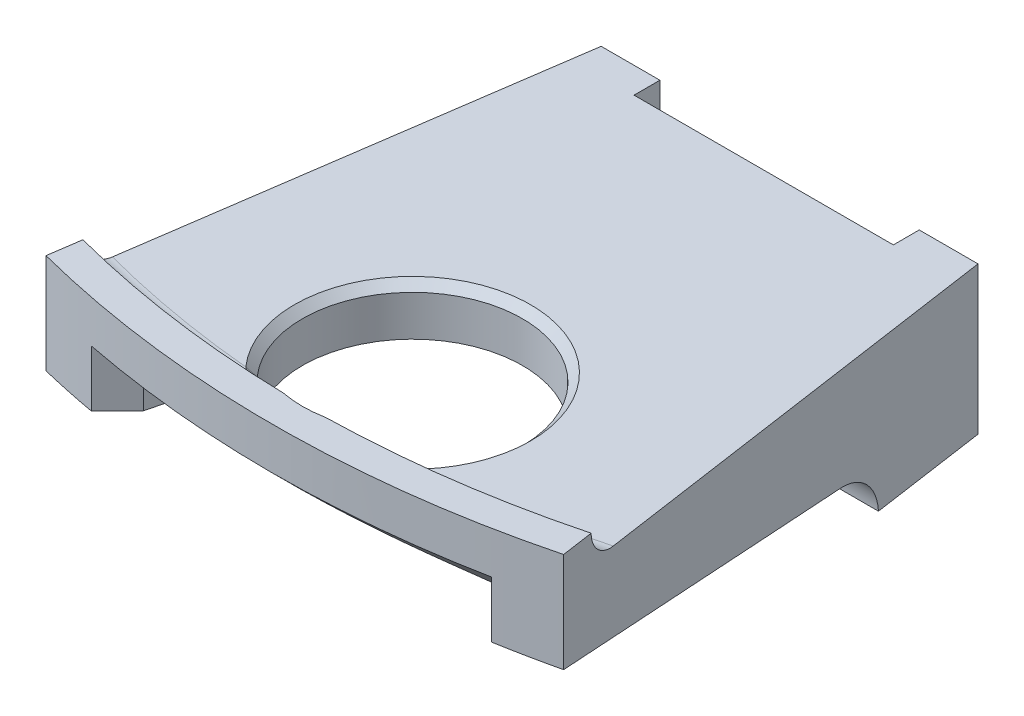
ISO-10303-21;
HEADER;
FILE_DESCRIPTION(('STEP AP214'),'2;1');
FILE_NAME('part.step','',(''),(''),'','','');
FILE_SCHEMA(('AUTOMOTIVE_DESIGN { 1 0 10303 214 1 1 1 1 }'));
ENDSEC;
DATA;
#1=APPLICATION_CONTEXT('core data for automotive mechanical design processes');
#2=APPLICATION_PROTOCOL_DEFINITION('international standard','automotive_design',2000,#1);
#3=PRODUCT_CONTEXT('',#1,'mechanical');
#4=PRODUCT('Part','Part','',(#3));
#5=PRODUCT_RELATED_PRODUCT_CATEGORY('part','',(#4));
#6=PRODUCT_DEFINITION_FORMATION('','',#4);
#7=PRODUCT_DEFINITION_CONTEXT('part definition',#1,'design');
#8=PRODUCT_DEFINITION('design','',#6,#7);
#9=PRODUCT_DEFINITION_SHAPE('','',#8);
#10=(LENGTH_UNIT() NAMED_UNIT(*) SI_UNIT(.MILLI.,.METRE.));
#11=(NAMED_UNIT(*) PLANE_ANGLE_UNIT() SI_UNIT($,.RADIAN.));
#12=(NAMED_UNIT(*) SI_UNIT($,.STERADIAN.) SOLID_ANGLE_UNIT());
#13=UNCERTAINTY_MEASURE_WITH_UNIT(LENGTH_MEASURE(1.E-05),#10,'distance_accuracy_value','');
#14=(GEOMETRIC_REPRESENTATION_CONTEXT(3) GLOBAL_UNCERTAINTY_ASSIGNED_CONTEXT((#13)) GLOBAL_UNIT_ASSIGNED_CONTEXT((#10,
#11,#12)) REPRESENTATION_CONTEXT('',''));
#15=CARTESIAN_POINT('',(0.,0.,0.));
#16=DIRECTION('',(0.,0.,1.));
#17=DIRECTION('',(1.,0.,0.));
#18=AXIS2_PLACEMENT_3D('',#15,#16,#17);
#19=CARTESIAN_POINT('',(0.,11.4981695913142,72.5911683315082));
#20=DIRECTION('',(0.,-1.,0.));
#21=DIRECTION('',(0.,0.,-1.));
#22=AXIS2_PLACEMENT_3D('',#19,#20,#21);
#23=CIRCLE('',#22,15.748);
#24=DIRECTION('',(0.,-0.0871557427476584,-0.996194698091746));
#25=VECTOR('',#24,1.);
#26=SURFACE_OF_LINEAR_EXTRUSION('',#23,#25);
#27=CARTESIAN_POINT('',(0.,9.7028,52.07));
#28=DIRECTION('',(0.,-1.,0.));
#29=DIRECTION('',(0.,0.,-1.));
#30=AXIS2_PLACEMENT_3D('',#27,#28,#29);
#31=CIRCLE('',#30,15.748);
#32=CARTESIAN_POINT('',(13.8304749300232,9.7028,44.5389));
#33=VERTEX_POINT('',#32);
#34=CARTESIAN_POINT('',(14.3560655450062,9.7028,45.5967561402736));
#35=VERTEX_POINT('',#34);
#36=EDGE_CURVE('E266',#33,#35,#31,.T.);
#37=ORIENTED_EDGE('',*,*,#36,.T.);
#38=CARTESIAN_POINT('',(-15.7478349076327,8.78092552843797,41.4608174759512));
#39=CARTESIAN_POINT('',(-15.8616419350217,6.77730499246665,43.4134401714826));
#40=CARTESIAN_POINT('',(-18.6335314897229,7.11763032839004,43.2109811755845));
#41=CARTESIAN_POINT('',(-15.7475753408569,8.79658175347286,41.5863442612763));
#42=CARTESIAN_POINT('',(-15.9409079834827,6.85242859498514,43.4734856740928));
#43=CARTESIAN_POINT('',(-18.6275537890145,7.23129301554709,43.328037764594));
#44=CARTESIAN_POINT('',(-15.7470731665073,8.81226919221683,41.7122299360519));
#45=CARTESIAN_POINT('',(-16.013666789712,6.93285205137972,43.5401192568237));
#46=CARTESIAN_POINT('',(-18.615571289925,7.34423448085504,43.4455402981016));
#47=CARTESIAN_POINT('',(-15.7454680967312,8.84382608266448,41.9640838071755));
#48=CARTESIAN_POINT('',(-16.1429894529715,7.09926198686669,43.6821215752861));
#49=CARTESIAN_POINT('',(-18.5796631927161,7.56816384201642,43.6808552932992));
#50=CARTESIAN_POINT('',(-15.7443648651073,8.85969563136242,42.0900520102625));
#51=CARTESIAN_POINT('',(-16.200112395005,7.18520141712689,43.7573343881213));
#52=CARTESIAN_POINT('',(-18.5557309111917,7.67915060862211,43.7986678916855));
#53=CARTESIAN_POINT('',(-15.7414173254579,8.89199167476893,42.3434324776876));
#54=CARTESIAN_POINT('',(-16.2994205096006,7.36176304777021,43.91536629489));
#55=CARTESIAN_POINT('',(-18.4954880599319,7.90039857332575,44.0358910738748));
#56=CARTESIAN_POINT('',(-15.7395607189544,8.90842305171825,42.4708328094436));
#57=CARTESIAN_POINT('',(-16.3418716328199,7.45251315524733,43.9982621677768));
#58=CARTESIAN_POINT('',(-18.4589736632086,8.01061523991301,44.1552947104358));
#59=CARTESIAN_POINT('',(-15.7348345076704,8.94174298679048,42.7240875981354));
#60=CARTESIAN_POINT('',(-16.4108909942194,7.63537511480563,44.1684832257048));
#61=CARTESIAN_POINT('',(-18.3734786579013,8.22765673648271,44.3929313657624));
#62=CARTESIAN_POINT('',(-15.7319651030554,8.95863145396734,42.8499423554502));
#63=CARTESIAN_POINT('',(-16.4379093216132,7.72758023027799,44.2558152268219));
#64=CARTESIAN_POINT('',(-18.3245005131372,8.33448223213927,44.5111646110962));
#65=CARTESIAN_POINT('',(-15.7252224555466,8.99071289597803,43.0818193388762));
#66=CARTESIAN_POINT('',(-16.4736027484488,7.89906235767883,44.4210000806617));
#67=CARTESIAN_POINT('',(-18.2214109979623,8.52933840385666,44.7292951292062));
#68=CARTESIAN_POINT('',(-15.7215445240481,9.00581467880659,43.1881637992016));
#69=CARTESIAN_POINT('',(-16.484526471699,7.97821391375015,44.4982998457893));
#70=CARTESIAN_POINT('',(-18.1689629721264,8.61791553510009,44.8294539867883));
#71=CARTESIAN_POINT('',(-15.7125149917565,9.03677706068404,43.3982658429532));
#72=CARTESIAN_POINT('',(-16.4946305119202,8.13514632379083,44.6537162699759));
#73=CARTESIAN_POINT('',(-18.0542046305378,8.7912837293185,45.027609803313));
#74=CARTESIAN_POINT('',(-15.7071637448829,9.05263749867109,43.5020239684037));
#75=CARTESIAN_POINT('',(-16.4940311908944,8.21304609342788,44.7319110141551));
#76=CARTESIAN_POINT('',(-17.991896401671,8.87607558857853,45.1256072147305));
#77=CARTESIAN_POINT('',(-15.69388641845,9.08534776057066,43.7052925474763));
#78=CARTESIAN_POINT('',(-16.4807534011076,8.3657851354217,44.8874357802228));
#79=CARTESIAN_POINT('',(-17.8575254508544,9.04046575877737,45.3179200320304));
#80=CARTESIAN_POINT('',(-15.6859802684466,9.10218912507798,43.8048293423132));
#81=CARTESIAN_POINT('',(-16.4683534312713,8.44077583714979,44.9648667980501));
#82=CARTESIAN_POINT('',(-17.7855406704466,9.12009871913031,45.4122578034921));
#83=CARTESIAN_POINT('',(-15.6659471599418,9.1374787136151,43.9994084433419));
#84=CARTESIAN_POINT('',(-16.4308736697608,8.58711305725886,45.1183275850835));
#85=CARTESIAN_POINT('',(-17.6311006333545,9.27394303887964,45.5970794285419));
#86=CARTESIAN_POINT('',(-15.6538202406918,9.15592692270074,44.094450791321));
#87=CARTESIAN_POINT('',(-16.4059476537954,8.65862681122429,45.1944977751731));
#88=CARTESIAN_POINT('',(-17.5486454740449,9.3481544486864,45.6875633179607));
#89=CARTESIAN_POINT('',(-15.6223934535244,9.19530781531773,44.2797379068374));
#90=CARTESIAN_POINT('',(-16.3419101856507,8.79741552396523,45.3450345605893));
#91=CARTESIAN_POINT('',(-17.3722282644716,9.4908596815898,45.8644784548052));
#92=CARTESIAN_POINT('',(-15.6030214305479,9.21626399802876,44.3699236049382));
#93=CARTESIAN_POINT('',(-16.3027680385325,8.86484419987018,45.4195609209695));
#94=CARTESIAN_POINT('',(-17.2781570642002,9.55928720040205,45.950858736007));
#95=CARTESIAN_POINT('',(-15.5525257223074,9.26121323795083,44.5431544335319));
#96=CARTESIAN_POINT('',(-16.2086240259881,8.99333044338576,45.5648653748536));
#97=CARTESIAN_POINT('',(-17.0795687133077,9.68860400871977,46.1174249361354));
#98=CARTESIAN_POINT('',(-15.5214057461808,9.28520533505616,44.6262018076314));
#99=CARTESIAN_POINT('',(-16.1536854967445,9.05459984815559,45.6358462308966));
#100=CARTESIAN_POINT('',(-16.9750548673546,9.74949566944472,46.197612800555));
#101=CARTESIAN_POINT('',(-15.4619766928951,9.32351251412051,44.7450112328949));
#102=CARTESIAN_POINT('',(-16.058152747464,9.14133203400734,45.7392280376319));
#103=CARTESIAN_POINT('',(-16.8111994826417,9.83499220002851,46.3128589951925));
#104=CARTESIAN_POINT('',(-15.4399866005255,9.33669614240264,44.7837241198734));
#105=CARTESIAN_POINT('',(-16.0241342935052,9.16938177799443,45.7731725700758));
#106=CARTESIAN_POINT('',(-16.7552839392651,9.86256570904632,46.3505037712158));
#107=CARTESIAN_POINT('',(-15.3913055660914,9.36369999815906,44.8591884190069));
#108=CARTESIAN_POINT('',(-15.9518068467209,9.22365967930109,45.8399004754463));
#109=CARTESIAN_POINT('',(-16.6413606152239,9.91576914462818,46.4240606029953));
#110=CARTESIAN_POINT('',(-15.3646149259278,9.37752018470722,44.8959399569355));
#111=CARTESIAN_POINT('',(-15.9134917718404,9.24990974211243,45.8727070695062));
#112=CARTESIAN_POINT('',(-16.5833529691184,9.94139919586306,46.4599727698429));
#113=CARTESIAN_POINT('',(-15.3063347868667,9.40562029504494,44.9675514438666));
#114=CARTESIAN_POINT('',(-15.8327172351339,9.30061762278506,45.9371450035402));
#115=CARTESIAN_POINT('',(-16.4654753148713,9.99080860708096,46.5301098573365));
#116=CARTESIAN_POINT('',(-15.2747435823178,9.41990037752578,45.0024107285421));
#117=CARTESIAN_POINT('',(-15.7902465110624,9.32509333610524,45.9687963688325));
#118=CARTESIAN_POINT('',(-16.405604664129,10.0145873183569,46.5643341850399));
#119=CARTESIAN_POINT('',(-15.206796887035,9.44869798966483,45.0703383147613));
#120=CARTESIAN_POINT('',(-15.701497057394,9.37232669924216,46.0309237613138));
#121=CARTESIAN_POINT('',(-16.2842759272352,10.0604164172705,46.6311651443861));
#122=CARTESIAN_POINT('',(-15.1704412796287,9.46321552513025,45.1034065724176));
#123=CARTESIAN_POINT('',(-15.6552065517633,9.39509916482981,46.061416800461));
#124=CARTESIAN_POINT('',(-16.2228178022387,10.082466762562,46.6637717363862));
#125=CARTESIAN_POINT('',(-15.0430776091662,9.51117152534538,45.2098937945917));
#126=CARTESIAN_POINT('',(-15.496952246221,9.46756712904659,46.1600985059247));
#127=CARTESIAN_POINT('',(-16.017648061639,10.1526919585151,46.768963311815));
#128=CARTESIAN_POINT('',(-14.9425461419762,9.5446330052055,45.2797874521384));
#129=CARTESIAN_POINT('',(-15.3774045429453,9.51401149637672,46.2260665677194));
#130=CARTESIAN_POINT('',(-15.8710340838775,10.1974980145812,46.8383209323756));
#131=CARTESIAN_POINT('',(-14.7244639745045,9.60980581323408,45.4127296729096));
#132=CARTESIAN_POINT('',(-15.126014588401,9.60017098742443,46.3526038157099));
#133=CARTESIAN_POINT('',(-15.5730201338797,10.2807420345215,46.9705910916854));
#134=CARTESIAN_POINT('',(-14.6069024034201,9.64151600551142,45.4757738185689));
#135=CARTESIAN_POINT('',(-14.9940474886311,9.63995151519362,46.4132597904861));
#136=CARTESIAN_POINT('',(-15.4216171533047,10.3191758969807,47.0334994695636));
#137=CARTESIAN_POINT('',(-14.3601829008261,9.70265641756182,45.5965897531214));
#138=CARTESIAN_POINT('',(-14.7217609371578,9.71445636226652,46.5301174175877));
#139=CARTESIAN_POINT('',(-15.1152443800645,10.3912738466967,47.1542543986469));
#140=CARTESIAN_POINT('',(-14.2310008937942,9.73208165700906,45.6543500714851));
#141=CARTESIAN_POINT('',(-14.5813448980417,9.7492045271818,46.5863576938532));
#142=CARTESIAN_POINT('',(-14.960267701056,10.4249276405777,47.2120899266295));
#143=CARTESIAN_POINT('',(-13.9649689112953,9.78856236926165,45.765463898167));
#144=CARTESIAN_POINT('',(-14.2950749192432,9.81469628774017,46.6949163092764));
#145=CARTESIAN_POINT('',(-14.6480232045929,10.4884493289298,47.3234672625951));
#146=CARTESIAN_POINT('',(-13.8281207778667,9.81561840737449,45.818818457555));
#147=CARTESIAN_POINT('',(-14.1491706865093,9.84545903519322,46.7472624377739));
#148=CARTESIAN_POINT('',(-14.4907559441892,10.5183181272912,47.3770100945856));
#149=CARTESIAN_POINT('',(-13.5476435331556,9.86782006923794,45.9223737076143));
#150=CARTESIAN_POINT('',(-13.8520237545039,9.90410375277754,46.8490906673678));
#151=CARTESIAN_POINT('',(-14.1728742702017,10.575327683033,47.4810056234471));
#152=CARTESIAN_POINT('',(-13.4039599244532,9.89294365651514,45.9725371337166));
#153=CARTESIAN_POINT('',(-13.7007055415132,9.93196428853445,46.898555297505));
#154=CARTESIAN_POINT('',(-14.0122420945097,10.6024378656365,47.5314216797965));
#155=CARTESIAN_POINT('',(-13.1126049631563,9.94120537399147,46.0696304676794));
#156=CARTESIAN_POINT('',(-13.3951793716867,9.98503647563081,46.9944492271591));
#157=CARTESIAN_POINT('',(-13.6895735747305,10.6541321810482,47.6290542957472));
#158=CARTESIAN_POINT('',(-12.9649333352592,9.96434336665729,46.1165601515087));
#159=CARTESIAN_POINT('',(-13.2409469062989,10.0102543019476,47.040888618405));
#160=CARTESIAN_POINT('',(-13.5275371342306,10.6787161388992,47.6762706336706));
#161=CARTESIAN_POINT('',(-12.5179295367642,10.0310482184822,46.2529472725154));
#162=CARTESIAN_POINT('',(-12.7755838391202,10.0825125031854,47.1759627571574));
#163=CARTESIAN_POINT('',(-13.0402193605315,10.7492347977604,47.8135414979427));
#164=CARTESIAN_POINT('',(-12.2141847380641,10.0719822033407,46.3381542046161));
#165=CARTESIAN_POINT('',(-12.4609923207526,10.1263037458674,47.2606141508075));
#166=CARTESIAN_POINT('',(-12.7132552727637,10.7920183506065,47.8993700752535));
#167=CARTESIAN_POINT('',(-11.6710943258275,10.1393106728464,46.4803975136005));
#168=CARTESIAN_POINT('',(-11.9002996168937,10.197884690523,47.4020950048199));
#169=CARTESIAN_POINT('',(-12.132742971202,10.8620285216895,48.0427115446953));
#170=CARTESIAN_POINT('',(-11.433223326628,10.1668712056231,46.5393733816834));
#171=CARTESIAN_POINT('',(-11.6553059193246,10.2270290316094,47.4608175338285));
#172=CARTESIAN_POINT('',(-11.8798287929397,10.8905578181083,48.1021640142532));
#173=CARTESIAN_POINT('',(-10.9542833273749,10.2190946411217,46.6523081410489));
#174=CARTESIAN_POINT('',(-11.1628685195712,10.2820566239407,47.5733418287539));
#175=CARTESIAN_POINT('',(-11.3725052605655,10.9444599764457,48.216039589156));
#176=CARTESIAN_POINT('',(-10.7132141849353,10.2437574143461,46.7062668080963));
#177=CARTESIAN_POINT('',(-10.9154010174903,10.3079438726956,47.6271511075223));
#178=CARTESIAN_POINT('',(-11.1180958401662,10.9698326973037,48.2704624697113));
#179=CARTESIAN_POINT('',(-9.98629153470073,10.3139393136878,46.8612541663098));
#180=CARTESIAN_POINT('',(-10.1702052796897,10.3814162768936,47.7817510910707));
#181=CARTESIAN_POINT('',(-10.3529357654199,11.0418947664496,48.4268112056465));
#182=CARTESIAN_POINT('',(-9.49681367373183,10.3556411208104,46.9553709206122));
#183=CARTESIAN_POINT('',(-9.66942530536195,10.4248410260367,47.8757732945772));
#184=CARTESIAN_POINT('',(-9.84034995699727,11.0845167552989,48.5217936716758));
#185=CARTESIAN_POINT('',(-8.51106445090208,10.430778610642,47.1273017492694));
#186=CARTESIAN_POINT('',(-8.66230209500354,10.5028734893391,48.0475991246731));
#187=CARTESIAN_POINT('',(-8.81101959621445,11.161160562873,48.6953418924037));
#188=CARTESIAN_POINT('',(-8.01478433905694,10.4642023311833,47.2050922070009));
#189=CARTESIAN_POINT('',(-8.15587299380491,10.5374787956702,48.1254005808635));
#190=CARTESIAN_POINT('',(-8.29427012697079,11.1951699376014,48.7738838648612));
#191=CARTESIAN_POINT('',(-7.01806726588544,10.5238364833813,47.3453554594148));
#192=CARTESIAN_POINT('',(-7.13963502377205,10.5991163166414,48.265718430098));
#193=CARTESIAN_POINT('',(-7.25827282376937,11.2557745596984,48.9155216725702));
#194=CARTESIAN_POINT('',(-6.51763078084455,10.5500477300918,47.4078299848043));
#195=CARTESIAN_POINT('',(-6.62977278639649,10.6261551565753,48.3282490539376));
#196=CARTESIAN_POINT('',(-6.73902527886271,11.2823706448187,48.9786192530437));
#197=CARTESIAN_POINT('',(-5.51696938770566,10.5958611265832,47.5178677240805));
#198=CARTESIAN_POINT('',(-5.61081582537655,10.6733646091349,48.4384009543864));
#199=CARTESIAN_POINT('',(-5.70190521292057,11.3288220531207,49.0897643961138));
#200=CARTESIAN_POINT('',(-5.01676275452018,10.6155036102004,47.5655218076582));
#201=CARTESIAN_POINT('',(-5.10169774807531,10.6935804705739,48.4861205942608));
#202=CARTESIAN_POINT('',(-5.18404442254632,11.3487185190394,49.1379036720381));
#203=CARTESIAN_POINT('',(-4.01437425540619,10.6488686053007,47.6469001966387));
#204=CARTESIAN_POINT('',(-4.08180758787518,10.7278960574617,48.5676173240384));
#205=CARTESIAN_POINT('',(-4.1470097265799,11.3824993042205,49.2201154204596));
#206=CARTESIAN_POINT('',(-3.51219232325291,10.6625909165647,47.6806240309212));
#207=CARTESIAN_POINT('',(-3.57100373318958,10.7419976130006,48.6013986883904));
#208=CARTESIAN_POINT('',(-3.6278357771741,11.3963834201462,49.254187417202));
#209=CARTESIAN_POINT('',(-2.00458219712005,10.6953452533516,47.7613210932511));
#210=CARTESIAN_POINT('',(-2.03791526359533,10.7756440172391,48.6822282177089));
#211=CARTESIAN_POINT('',(-2.06985810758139,11.4295174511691,49.3357197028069));
#212=CARTESIAN_POINT('',(-0.997202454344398,10.7060038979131,47.7879159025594));
#213=CARTESIAN_POINT('',(-1.01373726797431,10.786580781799,48.708881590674));
#214=CARTESIAN_POINT('',(-1.02968018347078,11.4402887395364,49.3625932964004));
#215=CARTESIAN_POINT('',(0.675741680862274,10.7058661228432,47.7876039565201));
#216=CARTESIAN_POINT('',(0.686946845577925,10.7864384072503,48.7085709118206));
#217=CARTESIAN_POINT('',(0.697749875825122,11.4401484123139,49.3622784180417));
#218=CARTESIAN_POINT('',(1.34138629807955,10.701119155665,47.7757806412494));
#219=CARTESIAN_POINT('',(1.3636574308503,10.7815670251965,48.6967231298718));
#220=CARTESIAN_POINT('',(1.38507862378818,11.4353505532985,49.3503313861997));
#221=CARTESIAN_POINT('',(2.6714153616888,10.6820444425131,47.7285495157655));
#222=CARTESIAN_POINT('',(2.71595266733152,10.7619822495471,48.6494055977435));
#223=CARTESIAN_POINT('',(2.7589106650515,11.4160625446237,49.3026089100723));
#224=CARTESIAN_POINT('',(3.33579959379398,10.6677151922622,47.6931380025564));
#225=CARTESIAN_POINT('',(3.39159602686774,10.7472656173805,48.613928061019));
#226=CARTESIAN_POINT('',(3.44541381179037,11.4015708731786,49.2668297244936));
#227=CARTESIAN_POINT('',(4.66298665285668,10.6289218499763,47.5981356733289));
#228=CARTESIAN_POINT('',(4.7416836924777,10.7073862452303,48.5187778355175));
#229=CARTESIAN_POINT('',(4.81785352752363,11.362308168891,49.1708502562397));
#230=CARTESIAN_POINT('',(5.32578324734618,10.6044365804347,47.538494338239));
#231=CARTESIAN_POINT('',(5.41619095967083,10.6821977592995,48.459045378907));
#232=CARTESIAN_POINT('',(5.50378589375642,11.3375156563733,49.1105989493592));
#233=CARTESIAN_POINT('',(6.64618595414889,10.5443320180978,47.3940732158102));
#234=CARTESIAN_POINT('',(6.76070694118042,10.620264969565,48.3144725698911));
#235=CARTESIAN_POINT('',(6.87223294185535,11.2765765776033,48.9647236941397));
#236=CARTESIAN_POINT('',(7.30379359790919,10.5087161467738,47.3093011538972));
#237=CARTESIAN_POINT('',(7.43080658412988,10.5835165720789,48.2296226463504));
#238=CARTESIAN_POINT('',(7.55474860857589,11.2404335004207,48.8791075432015));
#239=CARTESIAN_POINT('',(8.50263460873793,10.4315420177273,47.1291185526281));
#240=CARTESIAN_POINT('',(8.65369636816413,10.5036604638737,48.0494204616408));
#241=CARTESIAN_POINT('',(8.80223922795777,11.1619338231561,48.6971769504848));
#242=CARTESIAN_POINT('',(9.04508864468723,10.3919475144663,47.037801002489));
#243=CARTESIAN_POINT('',(9.20764376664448,10.4626044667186,47.9581141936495));
#244=CARTESIAN_POINT('',(9.36794375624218,11.1216004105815,48.6049886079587));
#245=CARTESIAN_POINT('',(9.85239870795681,10.3244343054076,46.8853117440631));
#246=CARTESIAN_POINT('',(10.0332946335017,10.3923087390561,47.8058292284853));
#247=CARTESIAN_POINT('',(10.2131607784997,11.0525831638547,48.4510972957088));
#248=CARTESIAN_POINT('',(10.1205589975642,10.3005638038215,46.8318690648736));
#249=CARTESIAN_POINT('',(10.3078389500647,10.3674033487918,47.7524682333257));
#250=CARTESIAN_POINT('',(10.4944684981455,11.0281450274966,48.3971710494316));
#251=CARTESIAN_POINT('',(10.6540130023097,10.2497727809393,46.7194403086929));
#252=CARTESIAN_POINT('',(10.8546464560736,10.3142558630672,47.6402859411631));
#253=CARTESIAN_POINT('',(11.0556339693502,10.976020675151,48.2837494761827));
#254=CARTESIAN_POINT('',(10.9193068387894,10.2228523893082,46.6604544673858));
#255=CARTESIAN_POINT('',(11.1269315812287,10.286010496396,47.5814582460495));
#256=CARTESIAN_POINT('',(11.3354917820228,10.9483345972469,48.2242543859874));
#257=CARTESIAN_POINT('',(11.4459496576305,10.1655372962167,46.5364694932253));
#258=CARTESIAN_POINT('',(11.6683874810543,10.225626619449,47.457919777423));
#259=CARTESIAN_POINT('',(11.893274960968,10.8891847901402,48.0992353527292));
#260=CARTESIAN_POINT('',(11.7073007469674,10.1351445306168,46.4714737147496));
#261=CARTESIAN_POINT('',(11.9375907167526,10.1934848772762,47.3932022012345));
#262=CARTESIAN_POINT('',(12.1712013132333,10.85772316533,48.0337147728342));
#263=CARTESIAN_POINT('',(12.2247252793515,10.0702686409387,46.3346873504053));
#264=CARTESIAN_POINT('',(12.4719714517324,10.1244457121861,47.2571912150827));
#265=CARTESIAN_POINT('',(12.7248315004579,10.7902019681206,47.8958816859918));
#266=CARTESIAN_POINT('',(12.4807977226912,10.0357847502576,46.262895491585));
#267=CARTESIAN_POINT('',(12.7371948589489,10.0875381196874,47.1858800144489));
#268=CARTESIAN_POINT('',(13.0005349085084,10.7541415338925,47.8235679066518));
#269=CARTESIAN_POINT('',(12.9847127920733,9.96196632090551,46.1115130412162));
#270=CARTESIAN_POINT('',(13.2613791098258,10.0077507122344,47.0358350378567));
#271=CARTESIAN_POINT('',(13.548530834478,10.6762756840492,47.6711809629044));
#272=CARTESIAN_POINT('',(13.2325666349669,9.92263877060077,46.0319337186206));
#273=CARTESIAN_POINT('',(13.5204231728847,9.96486216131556,46.9570826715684));
#274=CARTESIAN_POINT('',(13.8208276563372,10.6344785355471,47.5911190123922));
#275=CARTESIAN_POINT('',(13.5945309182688,9.85920804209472,45.905255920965));
#276=CARTESIAN_POINT('',(13.9016207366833,9.89444806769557,46.8322626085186));
#277=CARTESIAN_POINT('',(14.2258938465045,10.5659339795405,47.4638133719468));
#278=CARTESIAN_POINT('',(13.7135318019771,9.83732832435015,45.861819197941));
#279=CARTESIAN_POINT('',(14.0275272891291,9.86994893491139,46.7895162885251));
#280=CARTESIAN_POINT('',(14.3603320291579,10.5421151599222,47.4201834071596));
#281=CARTESIAN_POINT('',(13.9471402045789,9.79195106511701,45.7721376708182));
#282=CARTESIAN_POINT('',(14.2761463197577,9.81849476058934,46.7014970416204));
#283=CARTESIAN_POINT('',(14.6278087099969,10.492133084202,47.3301705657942));
#284=CARTESIAN_POINT('',(14.0617481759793,9.76845369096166,45.7258931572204));
#285=CARTESIAN_POINT('',(14.3988833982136,9.79153234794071,46.6562127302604));
#286=CARTESIAN_POINT('',(14.7608473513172,10.4659700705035,47.2837879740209));
#287=CARTESIAN_POINT('',(14.2377766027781,9.73004475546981,45.6503597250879));
#288=CARTESIAN_POINT('',(14.5889951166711,9.74665619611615,46.5825516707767));
#289=CARTESIAN_POINT('',(14.9692613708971,10.422452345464,47.2081100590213));
#290=CARTESIAN_POINT('',(14.3011993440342,9.71570300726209,45.622167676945));
#291=CARTESIAN_POINT('',(14.6578734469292,9.72972652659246,46.5551057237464));
#292=CARTESIAN_POINT('',(15.0452372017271,10.4060497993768,47.1798806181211));
#293=CARTESIAN_POINT('',(14.4256008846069,9.68645314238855,45.5645630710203));
#294=CARTESIAN_POINT('',(14.7938631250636,9.69473315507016,46.4991819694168));
#295=CARTESIAN_POINT('',(15.1964794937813,10.3721622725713,47.122244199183));
#296=CARTESIAN_POINT('',(14.486579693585,9.67154502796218,45.5351505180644));
#297=CARTESIAN_POINT('',(14.8609828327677,9.67666609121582,46.4706993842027));
#298=CARTESIAN_POINT('',(15.271745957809,10.354677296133,47.092837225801));
#299=CARTESIAN_POINT('',(14.6651398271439,9.62598393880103,45.4448647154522));
#300=CARTESIAN_POINT('',(15.0592802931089,9.62050513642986,46.3835223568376));
#301=CARTESIAN_POINT('',(15.4963297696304,10.3003761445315,47.0026536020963));
#302=CARTESIAN_POINT('',(14.7783219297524,9.59449915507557,45.3819529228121));
#303=CARTESIAN_POINT('',(15.1872473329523,9.58048133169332,46.3231507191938));
#304=CARTESIAN_POINT('',(15.6444047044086,10.2617192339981,46.9399238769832));
#305=CARTESIAN_POINT('',(14.9867246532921,9.53018659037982,45.2496081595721));
#306=CARTESIAN_POINT('',(15.4296669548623,9.4940410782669,46.197586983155));
#307=CARTESIAN_POINT('',(15.9348798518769,10.1782058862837,46.8083674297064));
#308=CARTESIAN_POINT('',(15.0820459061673,9.49736768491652,45.1802152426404));
#309=CARTESIAN_POINT('',(15.5443106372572,9.44758985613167,46.1323310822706));
#310=CARTESIAN_POINT('',(16.0773080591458,10.1333868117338,46.7395782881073));
#311=CARTESIAN_POINT('',(15.2076880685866,9.44842344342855,45.069733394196));
#312=CARTESIAN_POINT('',(15.7025439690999,9.37192794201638,46.0303561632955));
#313=CARTESIAN_POINT('',(16.2855448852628,10.0600284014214,46.6305662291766));
#314=CARTESIAN_POINT('',(15.2466741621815,9.43215853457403,45.0318470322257));
#315=CARTESIAN_POINT('',(15.753108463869,9.34564572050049,45.9956001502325));
#316=CARTESIAN_POINT('',(16.3540461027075,10.0345583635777,46.5932636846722));
#317=CARTESIAN_POINT('',(15.3185139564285,9.40004736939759,44.9537487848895));
#318=CARTESIAN_POINT('',(15.8491983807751,9.29090568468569,45.9246462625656));
#319=CARTESIAN_POINT('',(16.4888998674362,9.98136201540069,46.5165692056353));
#320=CARTESIAN_POINT('',(15.351368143,9.38420107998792,44.9135370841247));
#321=CARTESIAN_POINT('',(15.8947399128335,9.26242477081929,45.8884222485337));
#322=CARTESIAN_POINT('',(16.5552525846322,9.95363588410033,46.47717743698));
#323=CARTESIAN_POINT('',(15.4291324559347,9.34376560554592,44.8053006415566));
#324=CARTESIAN_POINT('',(16.0067123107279,9.18501227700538,45.7918447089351));
#325=CARTESIAN_POINT('',(16.7252478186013,9.87805828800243,46.3714468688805));
#326=CARTESIAN_POINT('',(15.4691403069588,9.31975151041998,44.7352965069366));
#327=CARTESIAN_POINT('',(16.068744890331,9.13425315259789,45.7303326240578));
#328=CARTESIAN_POINT('',(16.8268984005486,9.82826260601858,46.3033516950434));
#329=CARTESIAN_POINT('',(15.5357934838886,9.27432123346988,44.5888596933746));
#330=CARTESIAN_POINT('',(16.1787079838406,9.02714727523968,45.6039768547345));
#331=CARTESIAN_POINT('',(17.0223159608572,9.72214300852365,46.1615449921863));
#332=CARTESIAN_POINT('',(15.5624394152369,9.25290493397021,44.5124273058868));
#333=CARTESIAN_POINT('',(16.2266410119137,8.97064985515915,45.5389804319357));
#334=CARTESIAN_POINT('',(17.1160832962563,9.66581938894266,46.0878337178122));
#335=CARTESIAN_POINT('',(15.6064650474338,9.21249560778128,44.3536371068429));
#336=CARTESIAN_POINT('',(16.3097258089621,8.85273249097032,45.4061867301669));
#337=CARTESIAN_POINT('',(17.2950817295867,9.5469222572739,45.935261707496));
#338=CARTESIAN_POINT('',(15.6238295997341,9.19350658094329,44.2712698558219));
#339=CARTESIAN_POINT('',(16.3448076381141,8.79114753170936,45.3382350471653));
#340=CARTESIAN_POINT('',(17.3802986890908,9.48433872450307,45.856392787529));
#341=CARTESIAN_POINT('',(15.6525969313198,9.15746147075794,44.1016640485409));
#342=CARTESIAN_POINT('',(16.4034180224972,8.66409746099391,45.2004324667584));
#343=CARTESIAN_POINT('',(17.5417697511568,9.3537089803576,45.6944508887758));
#344=CARTESIAN_POINT('',(15.663998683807,9.14040572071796,44.0144246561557));
#345=CARTESIAN_POINT('',(16.4268562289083,8.59848323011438,45.1304473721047));
#346=CARTESIAN_POINT('',(17.6180223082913,9.28566183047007,45.6113771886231));
#347=CARTESIAN_POINT('',(15.6829930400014,9.10783605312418,43.8368240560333));
#348=CARTESIAN_POINT('',(16.4630193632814,8.4649419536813,44.9900575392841));
#349=CARTESIAN_POINT('',(17.7610321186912,9.14551288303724,45.4426216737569));
#350=CARTESIAN_POINT('',(15.6906176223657,9.09231011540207,43.7464962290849));
#351=CARTESIAN_POINT('',(16.4757219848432,8.39690299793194,44.9195444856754));
#352=CARTESIAN_POINT('',(17.8278655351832,9.07345107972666,45.3569685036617));
#353=CARTESIAN_POINT('',(15.7035202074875,9.06223359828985,43.5628324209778));
#354=CARTESIAN_POINT('',(16.4913965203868,8.25883520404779,44.7782903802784));
#355=CARTESIAN_POINT('',(17.9530793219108,8.92544570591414,45.1831008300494));
#356=CARTESIAN_POINT('',(15.7087971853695,9.0476834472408,43.4694951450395));
#357=CARTESIAN_POINT('',(16.4942273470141,8.18869524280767,44.7074635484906));
#358=CARTESIAN_POINT('',(18.0114559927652,8.84950045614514,45.0948852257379));
#359=CARTESIAN_POINT('',(15.7223852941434,9.00499857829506,43.1857244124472));
#360=CARTESIAN_POINT('',(16.4886363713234,7.97456233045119,44.4938769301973));
#361=CARTESIAN_POINT('',(18.1745261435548,8.61651695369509,44.8270470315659));
#362=CARTESIAN_POINT('',(15.7284343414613,8.97786920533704,42.991761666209));
#363=CARTESIAN_POINT('',(16.4652059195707,7.82993102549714,44.3532645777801));
#364=CARTESIAN_POINT('',(18.26697931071,8.45451243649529,44.6444509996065));
#365=CARTESIAN_POINT('',(15.7358191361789,8.93543829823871,42.6767033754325));
#366=CARTESIAN_POINT('',(16.3993602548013,7.60115136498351,44.136359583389));
#367=CARTESIAN_POINT('',(18.3906011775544,8.18722300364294,44.3484443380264));
#368=CARTESIAN_POINT('',(15.7380728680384,8.91969244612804,42.5570449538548));
#369=CARTESIAN_POINT('',(16.3673264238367,7.51447683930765,44.0555425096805));
#370=CARTESIAN_POINT('',(18.4315585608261,8.08477213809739,44.2361545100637));
#371=CARTESIAN_POINT('',(15.7417819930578,8.88854077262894,42.3166270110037));
#372=CARTESIAN_POINT('',(16.2897646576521,7.34314131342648,43.8985415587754));
#373=CARTESIAN_POINT('',(18.5024429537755,7.87708372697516,44.0107820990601));
#374=CARTESIAN_POINT('',(15.7432372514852,8.87313500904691,42.1958673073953));
#375=CARTESIAN_POINT('',(16.2438328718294,7.25842092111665,43.8223762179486));
#376=CARTESIAN_POINT('',(18.5323681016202,7.77184571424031,43.8976993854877));
#377=CARTESIAN_POINT('',(15.745536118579,8.84265100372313,41.9548091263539));
#378=CARTESIAN_POINT('',(16.1385613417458,7.09330745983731,43.6770009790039));
#379=CARTESIAN_POINT('',(18.5810869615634,7.55993144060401,43.6721870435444));
#380=CARTESIAN_POINT('',(15.7463839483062,8.82757122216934,41.8345133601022));
#381=CARTESIAN_POINT('',(16.0788549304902,7.01287052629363,43.607818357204));
#382=CARTESIAN_POINT('',(18.5999573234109,7.45327045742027,43.5597584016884));
#383=CARTESIAN_POINT('',(15.7475554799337,8.79754469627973,41.5941892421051));
#384=CARTESIAN_POINT('',(15.9455572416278,6.85770714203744,43.4778850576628));
#385=CARTESIAN_POINT('',(18.6267592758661,7.23831848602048,43.3353604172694));
#386=CARTESIAN_POINT('',(15.7478793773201,8.78259790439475,41.4741608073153));
#387=CARTESIAN_POINT('',(15.8714542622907,6.78305179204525,43.417305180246));
#388=CARTESIAN_POINT('',(18.6346949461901,7.13002812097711,43.223390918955));
#389=CARTESIAN_POINT('',(15.7479770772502,8.76767000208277,41.3545456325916));
#390=CARTESIAN_POINT('',(15.7914626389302,6.71362368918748,43.3631157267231));
#391=CARTESIAN_POINT('',(18.6371042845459,7.02114496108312,43.1119079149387));
#392=(BOUNDED_SURFACE() B_SPLINE_SURFACE(3,2,((#38,#39,#40),(#41,#42,#43),(#44,#45,#46),(#47,
#48,#49),(#50,#51,#52),(#53,#54,#55),(#56,#57,#58),(#59,#60,#61),(#62,#63,#64),(#65,#66,#67),
(#68,#69,#70),(#71,#72,#73),(#74,#75,#76),(#77,#78,#79),(#80,#81,#82),(#83,#84,#85),(#86,#87,
#88),(#89,#90,#91),(#92,#93,#94),(#95,#96,#97),(#98,#99,#100),(#101,#102,#103),(#104,#105,#106),
(#107,#108,#109),(#110,#111,#112),(#113,#114,#115),(#116,#117,#118),(#119,#120,#121),(#122,#123,
#124),(#125,#126,#127),(#128,#129,#130),(#131,#132,#133),(#134,#135,#136),(#137,#138,#139),
(#140,#141,#142),(#143,#144,#145),(#146,#147,#148),(#149,#150,#151),(#152,#153,#154),(#155,#156,
#157),(#158,#159,#160),(#161,#162,#163),(#164,#165,#166),(#167,#168,#169),(#170,#171,#172),
(#173,#174,#175),(#176,#177,#178),(#179,#180,#181),(#182,#183,#184),(#185,#186,#187),(#188,#189,
#190),(#191,#192,#193),(#194,#195,#196),(#197,#198,#199),(#200,#201,#202),(#203,#204,#205),
(#206,#207,#208),(#209,#210,#211),(#212,#213,#214),(#215,#216,#217),(#218,#219,#220),(#221,#222,
#223),(#224,#225,#226),(#227,#228,#229),(#230,#231,#232),(#233,#234,#235),(#236,#237,#238),
(#239,#240,#241),(#242,#243,#244),(#245,#246,#247),(#248,#249,#250),(#251,#252,#253),(#254,#255,
#256),(#257,#258,#259),(#260,#261,#262),(#263,#264,#265),(#266,#267,#268),(#269,#270,#271),
(#272,#273,#274),(#275,#276,#277),(#278,#279,#280),(#281,#282,#283),(#284,#285,#286),(#287,#288,
#289),(#290,#291,#292),(#293,#294,#295),(#296,#297,#298),(#299,#300,#301),(#302,#303,#304),
(#305,#306,#307),(#308,#309,#310),(#311,#312,#313),(#314,#315,#316),(#317,#318,#319),(#320,#321,
#322),(#323,#324,#325),(#326,#327,#328),(#329,#330,#331),(#332,#333,#334),(#335,#336,#337),
(#338,#339,#340),(#341,#342,#343),(#344,#345,#346),(#347,#348,#349),(#350,#351,#352),(#353,#354,
#355),(#356,#357,#358),(#359,#360,#361),(#362,#363,#364),(#365,#366,#367),(#368,#369,#370),
(#371,#372,#373),(#374,#375,#376),(#377,#378,#379),(#380,#381,#382),(#383,#384,#385),(#386,#387,
#388),(#389,#390,#391)),.UNSPECIFIED.,.F.,.F.,.F.) B_SPLINE_SURFACE_WITH_KNOTS((4,2,2,2,2,2,2,2,
2,2,2,2,2,2,2,2,2,2,2,2,2,2,2,2,2,2,2,2,2,2,2,2,2,2,2,2,2,2,2,2,2,2,2,2,2,2,2,2,2,2,2,2,2,2,2,2,
2,2,4),(3,3),(0.,0.489421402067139,0.979116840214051,1.47715033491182,1.97508545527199,
2.40371417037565,2.83225228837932,3.25752516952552,3.68279409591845,4.11241628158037,
4.54190293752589,4.75749100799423,4.97306523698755,5.18871466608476,5.40436937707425,
5.90082765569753,6.39760424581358,6.89543487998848,7.39314640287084,7.89588102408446,
8.39865043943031,9.40270210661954,10.1729448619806,10.9432220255,12.4840711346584,
14.0271340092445,15.5700224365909,17.1032553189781,18.6365400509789,21.7003900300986,
23.725360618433,25.7506491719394,27.7801822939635,29.8090921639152,31.5016728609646,
32.3487228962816,33.1957369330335,34.0422810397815,34.8889840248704,35.7344794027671,
36.1570952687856,36.5796674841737,36.8235945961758,37.0675207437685,37.555458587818,
38.0405586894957,38.2830339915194,38.5254900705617,38.9161152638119,39.3067227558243,
39.6979658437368,40.0892762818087,40.4772145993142,40.865322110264,41.6425293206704,
42.1131596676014,42.5838694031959,43.051275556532,43.5185072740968),(0.,1.),
.UNSPECIFIED.) GEOMETRIC_REPRESENTATION_ITEM() RATIONAL_B_SPLINE_SURFACE(((1.,0.671878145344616,
1.),(1.,0.683082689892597,1.),(1.,0.694052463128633,1.),(1.,0.715511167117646,1.),(1.,
0.725999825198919,1.),(1.,0.746646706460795,1.),(1.,0.756796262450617,1.),(1.,0.776540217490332,
1.),(1.,0.786134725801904,1.),(1.,0.803423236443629,1.),(1.,0.811195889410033,1.),(1.,
0.826237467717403,1.),(1.,0.833506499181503,1.),(1.,0.847410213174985,1.),(1.,0.85404930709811,
1.),(1.,0.866643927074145,1.),(1.,0.872599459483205,1.),(1.,0.883736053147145,1.),(1.,
0.888908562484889,1.),(1.,0.898237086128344,1.),(1.,0.902393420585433,1.),(1.,0.907815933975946,
1.),(1.,0.909490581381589,1.),(1.,0.912576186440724,1.),(1.,0.913987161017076,1.),(1.,
0.916566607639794,1.),(1.,0.917734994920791,1.),(1.,0.91985948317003,1.),(1.,0.920815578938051,
1.),(1.,0.9236820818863,1.),(1.,0.925214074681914,1.),(1.,0.927725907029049,1.),(1.,
0.928705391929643,1.),(1.,0.930348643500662,1.),(1.,0.931011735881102,1.),(1.,0.932147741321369,
1.),(1.,0.93262069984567,1.),(1.,0.933451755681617,1.),(1.,0.933808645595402,1.),(1.,
0.934442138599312,1.),(1.,0.934718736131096,1.),(1.,0.935466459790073,1.),(1.,0.935856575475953,
1.),(1.,0.936444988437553,1.),(1.,0.936666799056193,1.),(1.,0.937063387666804,1.),(1.,
0.937238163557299,1.),(1.,0.937713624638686,1.),(1.,0.937965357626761,1.),(1.,0.938394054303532,
1.),(1.,0.938570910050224,1.),(1.,0.938873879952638,1.),(1.,0.938999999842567,1.),(1.,
0.939214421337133,1.),(1.,0.939302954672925,1.),(1.,0.939450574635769,1.),(1.,0.939509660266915,
1.),(1.,0.939649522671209,1.),(1.,0.939693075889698,1.),(1.,0.939692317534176,1.),(1.,
0.939672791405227,1.),(1.,0.939592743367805,1.),(1.,0.939532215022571,1.),(1.,0.939363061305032,
1.),(1.,0.939254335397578,1.),(1.,0.938973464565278,1.),(1.,0.938801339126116,1.),(1.,
0.938397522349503,1.),(1.,0.938180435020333,1.),(1.,0.937771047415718,1.),(1.,0.937620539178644,
1.),(1.,0.93728069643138,1.),(1.,0.937091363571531,1.),(1.,0.936657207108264,1.),(1.,
0.936412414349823,1.),(1.,0.93583665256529,1.),(1.,0.935505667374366,1.),(1.,0.934702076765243,
1.),(1.,0.934229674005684,1.),(1.,0.933316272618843,1.),(1.,0.932977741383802,1.),(1.,
0.932199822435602,1.),(1.,0.931760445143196,1.),(1.,0.930947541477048,1.),(1.,0.930624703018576,
1.),(1.,0.929912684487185,1.),(1.,0.929523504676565,1.),(1.,0.92822919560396,1.),(1.,
0.927197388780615,1.),(1.,0.924559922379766,1.),(1.,0.922957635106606,1.),(1.,0.919845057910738,
1.),(1.,0.918689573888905,1.),(1.,0.916093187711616,1.),(1.,0.914652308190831,1.),(1.,
0.910463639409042,1.),(1.,0.907455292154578,1.),(1.,0.900536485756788,1.),(1.,0.896626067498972,
1.),(1.,0.88797212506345,1.),(1.,0.883227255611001,1.),(1.,0.873032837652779,1.),(1.,
0.867583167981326,1.),(1.,0.85614523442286,1.),(1.,0.850162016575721,1.),(1.,0.837703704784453,
1.),(1.,0.831228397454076,1.),(1.,0.8111407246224,1.),(1.,0.796881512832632,1.),(1.,
0.772880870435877,1.),(1.,0.763576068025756,1.),(1.,0.744481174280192,1.),(1.,0.734691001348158,
1.),(1.,0.714722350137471,1.),(1.,0.70454707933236,1.),(1.,0.683761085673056,1.),(1.,
0.673150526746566,1.),(1.,0.662326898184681,1.))) REPRESENTATION_ITEM('') SURFACE());
#393=CARTESIAN_POINT('',(15.7479770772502,8.76767000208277,41.3545456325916));
#394=CARTESIAN_POINT('',(15.7478793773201,8.78259790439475,41.4741608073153));
#395=CARTESIAN_POINT('',(15.7475554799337,8.79754469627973,41.5941892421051));
#396=CARTESIAN_POINT('',(15.7463839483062,8.82757122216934,41.8345133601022));
#397=CARTESIAN_POINT('',(15.745536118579,8.84265100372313,41.9548091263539));
#398=CARTESIAN_POINT('',(15.7432372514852,8.87313500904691,42.1958673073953));
#399=CARTESIAN_POINT('',(15.7417819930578,8.88854077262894,42.3166270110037));
#400=CARTESIAN_POINT('',(15.7380728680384,8.91969244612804,42.5570449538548));
#401=CARTESIAN_POINT('',(15.7358191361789,8.93543829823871,42.6767033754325));
#402=CARTESIAN_POINT('',(15.7284343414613,8.97786920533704,42.991761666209));
#403=CARTESIAN_POINT('',(15.7223852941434,9.00499857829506,43.1857244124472));
#404=CARTESIAN_POINT('',(15.7087971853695,9.0476834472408,43.4694951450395));
#405=CARTESIAN_POINT('',(15.7035202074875,9.06223359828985,43.5628324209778));
#406=CARTESIAN_POINT('',(15.6906176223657,9.09231011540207,43.7464962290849));
#407=CARTESIAN_POINT('',(15.6829930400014,9.10783605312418,43.8368240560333));
#408=CARTESIAN_POINT('',(15.663998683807,9.14040572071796,44.0144246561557));
#409=CARTESIAN_POINT('',(15.6525969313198,9.15746147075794,44.1016640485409));
#410=CARTESIAN_POINT('',(15.6238295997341,9.19350658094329,44.2712698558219));
#411=CARTESIAN_POINT('',(15.6064650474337,9.21249560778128,44.3536371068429));
#412=CARTESIAN_POINT('',(15.5624394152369,9.25290493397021,44.5124273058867));
#413=CARTESIAN_POINT('',(15.5357934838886,9.27432123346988,44.5888596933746));
#414=CARTESIAN_POINT('',(15.4691403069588,9.31975151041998,44.7352965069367));
#415=CARTESIAN_POINT('',(15.4291324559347,9.34376560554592,44.8053006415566));
#416=CARTESIAN_POINT('',(15.351368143,9.38420107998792,44.9135370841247));
#417=CARTESIAN_POINT('',(15.3185139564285,9.40004736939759,44.9537487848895));
#418=CARTESIAN_POINT('',(15.2466741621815,9.43215853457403,45.0318470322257));
#419=CARTESIAN_POINT('',(15.2076880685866,9.44842344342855,45.069733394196));
#420=CARTESIAN_POINT('',(15.0820459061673,9.49736768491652,45.1802152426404));
#421=CARTESIAN_POINT('',(14.9867246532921,9.53018659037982,45.2496081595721));
#422=CARTESIAN_POINT('',(14.7783219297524,9.59449915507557,45.3819529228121));
#423=CARTESIAN_POINT('',(14.6651398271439,9.62598393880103,45.4448647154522));
#424=CARTESIAN_POINT('',(14.486579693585,9.67154502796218,45.5351505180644));
#425=CARTESIAN_POINT('',(14.4256008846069,9.68645314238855,45.5645630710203));
#426=CARTESIAN_POINT('',(14.3011993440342,9.71570300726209,45.622167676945));
#427=CARTESIAN_POINT('',(14.2377766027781,9.73004475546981,45.6503597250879));
#428=CARTESIAN_POINT('',(14.0617481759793,9.76845369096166,45.7258931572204));
#429=CARTESIAN_POINT('',(13.9471402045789,9.79195106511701,45.7721376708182));
#430=CARTESIAN_POINT('',(13.7135318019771,9.83732832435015,45.861819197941));
#431=CARTESIAN_POINT('',(13.5945309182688,9.85920804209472,45.905255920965));
#432=CARTESIAN_POINT('',(13.2325666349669,9.92263877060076,46.0319337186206));
#433=CARTESIAN_POINT('',(12.9847127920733,9.96196632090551,46.1115130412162));
#434=CARTESIAN_POINT('',(12.4807977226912,10.0357847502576,46.262895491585));
#435=CARTESIAN_POINT('',(12.2247252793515,10.0702686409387,46.3346873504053));
#436=CARTESIAN_POINT('',(11.7073007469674,10.1351445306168,46.4714737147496));
#437=CARTESIAN_POINT('',(11.4459496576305,10.1655372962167,46.5364694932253));
#438=CARTESIAN_POINT('',(10.9193068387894,10.2228523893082,46.6604544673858));
#439=CARTESIAN_POINT('',(10.6540130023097,10.2497727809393,46.7194403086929));
#440=CARTESIAN_POINT('',(10.1205589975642,10.3005638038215,46.8318690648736));
#441=CARTESIAN_POINT('',(9.85239870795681,10.3244343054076,46.8853117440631));
#442=CARTESIAN_POINT('',(9.04508864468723,10.3919475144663,47.037801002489));
#443=CARTESIAN_POINT('',(8.50263460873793,10.4315420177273,47.1291185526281));
#444=CARTESIAN_POINT('',(7.30379359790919,10.5087161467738,47.3093011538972));
#445=CARTESIAN_POINT('',(6.64618595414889,10.5443320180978,47.3940732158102));
#446=CARTESIAN_POINT('',(5.32578324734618,10.6044365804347,47.538494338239));
#447=CARTESIAN_POINT('',(4.66298665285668,10.6289218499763,47.5981356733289));
#448=CARTESIAN_POINT('',(3.33579959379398,10.6677151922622,47.6931380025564));
#449=CARTESIAN_POINT('',(2.6714153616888,10.6820444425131,47.7285495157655));
#450=CARTESIAN_POINT('',(1.34138629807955,10.701119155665,47.7757806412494));
#451=CARTESIAN_POINT('',(0.675741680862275,10.7058661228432,47.7876039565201));
#452=CARTESIAN_POINT('',(-0.997202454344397,10.7060038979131,47.7879159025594));
#453=CARTESIAN_POINT('',(-2.00458219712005,10.6953452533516,47.7613210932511));
#454=CARTESIAN_POINT('',(-3.51219232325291,10.6625909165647,47.6806240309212));
#455=CARTESIAN_POINT('',(-4.01437425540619,10.6488686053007,47.6469001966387));
#456=CARTESIAN_POINT('',(-5.01676275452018,10.6155036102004,47.5655218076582));
#457=CARTESIAN_POINT('',(-5.51696938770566,10.5958611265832,47.5178677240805));
#458=CARTESIAN_POINT('',(-6.51763078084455,10.5500477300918,47.4078299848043));
#459=CARTESIAN_POINT('',(-7.01806726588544,10.5238364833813,47.3453554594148));
#460=CARTESIAN_POINT('',(-8.01478433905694,10.4642023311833,47.2050922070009));
#461=CARTESIAN_POINT('',(-8.51106445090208,10.430778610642,47.1273017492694));
#462=CARTESIAN_POINT('',(-9.49681367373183,10.3556411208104,46.9553709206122));
#463=CARTESIAN_POINT('',(-9.98629153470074,10.3139393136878,46.8612541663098));
#464=CARTESIAN_POINT('',(-10.7132141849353,10.2437574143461,46.7062668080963));
#465=CARTESIAN_POINT('',(-10.9542833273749,10.2190946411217,46.6523081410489));
#466=CARTESIAN_POINT('',(-11.433223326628,10.1668712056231,46.5393733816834));
#467=CARTESIAN_POINT('',(-11.6710943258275,10.1393106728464,46.4803975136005));
#468=CARTESIAN_POINT('',(-12.2141847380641,10.0719822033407,46.3381542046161));
#469=CARTESIAN_POINT('',(-12.5179295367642,10.0310482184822,46.2529472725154));
#470=CARTESIAN_POINT('',(-12.9649333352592,9.96434336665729,46.1165601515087));
#471=CARTESIAN_POINT('',(-13.1126049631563,9.94120537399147,46.0696304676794));
#472=CARTESIAN_POINT('',(-13.4039599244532,9.89294365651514,45.9725371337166));
#473=CARTESIAN_POINT('',(-13.5476435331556,9.86782006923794,45.9223737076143));
#474=CARTESIAN_POINT('',(-13.8281207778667,9.81561840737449,45.818818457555));
#475=CARTESIAN_POINT('',(-13.9649689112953,9.78856236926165,45.765463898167));
#476=CARTESIAN_POINT('',(-14.2310008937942,9.73208165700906,45.6543500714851));
#477=CARTESIAN_POINT('',(-14.3601829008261,9.70265641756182,45.5965897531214));
#478=CARTESIAN_POINT('',(-14.6069024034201,9.64151600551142,45.4757738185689));
#479=CARTESIAN_POINT('',(-14.7244639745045,9.60980581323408,45.4127296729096));
#480=CARTESIAN_POINT('',(-14.9425461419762,9.5446330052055,45.2797874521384));
#481=CARTESIAN_POINT('',(-15.0430776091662,9.51117152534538,45.2098937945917));
#482=CARTESIAN_POINT('',(-15.1704412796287,9.46321552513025,45.1034065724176));
#483=CARTESIAN_POINT('',(-15.206796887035,9.44869798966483,45.0703383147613));
#484=CARTESIAN_POINT('',(-15.2747435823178,9.41990037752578,45.0024107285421));
#485=CARTESIAN_POINT('',(-15.3063347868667,9.40562029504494,44.9675514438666));
#486=CARTESIAN_POINT('',(-15.3646149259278,9.37752018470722,44.8959399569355));
#487=CARTESIAN_POINT('',(-15.3913055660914,9.36369999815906,44.8591884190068));
#488=CARTESIAN_POINT('',(-15.4399866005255,9.33669614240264,44.7837241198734));
#489=CARTESIAN_POINT('',(-15.4619766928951,9.32351251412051,44.7450112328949));
#490=CARTESIAN_POINT('',(-15.5214057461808,9.28520533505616,44.6262018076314));
#491=CARTESIAN_POINT('',(-15.5525257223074,9.26121323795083,44.5431544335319));
#492=CARTESIAN_POINT('',(-15.6030214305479,9.21626399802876,44.3699236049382));
#493=CARTESIAN_POINT('',(-15.6223934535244,9.19530781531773,44.2797379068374));
#494=CARTESIAN_POINT('',(-15.6538202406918,9.15592692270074,44.094450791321));
#495=CARTESIAN_POINT('',(-15.6659471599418,9.13747871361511,43.9994084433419));
#496=CARTESIAN_POINT('',(-15.6859802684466,9.10218912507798,43.8048293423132));
#497=CARTESIAN_POINT('',(-15.69388641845,9.08534776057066,43.7052925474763));
#498=CARTESIAN_POINT('',(-15.7071637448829,9.05263749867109,43.5020239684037));
#499=CARTESIAN_POINT('',(-15.7125149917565,9.03677706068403,43.3982658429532));
#500=CARTESIAN_POINT('',(-15.7215445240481,9.00581467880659,43.1881637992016));
#501=CARTESIAN_POINT('',(-15.7252224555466,8.99071289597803,43.0818193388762));
#502=CARTESIAN_POINT('',(-15.7319651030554,8.95863145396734,42.8499423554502));
#503=CARTESIAN_POINT('',(-15.7348345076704,8.94174298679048,42.7240875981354));
#504=CARTESIAN_POINT('',(-15.7395607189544,8.90842305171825,42.4708328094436));
#505=CARTESIAN_POINT('',(-15.7414173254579,8.89199167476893,42.3434324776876));
#506=CARTESIAN_POINT('',(-15.7443648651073,8.85969563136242,42.0900520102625));
#507=CARTESIAN_POINT('',(-15.7454680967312,8.84382608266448,41.9640838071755));
#508=CARTESIAN_POINT('',(-15.7470731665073,8.81226919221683,41.7122299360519));
#509=CARTESIAN_POINT('',(-15.7475753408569,8.79658175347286,41.5863442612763));
#510=CARTESIAN_POINT('',(-15.7478349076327,8.78092552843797,41.4608174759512));
#511=B_SPLINE_CURVE_WITH_KNOTS('',3,(#393,#394,#395,#396,#397,#398,#399,#400,#401,#402,#403,
#404,#405,#406,#407,#408,#409,#410,#411,#412,#413,#414,#415,#416,#417,#418,#419,#420,#421,#422,
#423,#424,#425,#426,#427,#428,#429,#430,#431,#432,#433,#434,#435,#436,#437,#438,#439,#440,#441,
#442,#443,#444,#445,#446,#447,#448,#449,#450,#451,#452,#453,#454,#455,#456,#457,#458,#459,#460,
#461,#462,#463,#464,#465,#466,#467,#468,#469,#470,#471,#472,#473,#474,#475,#476,#477,#478,#479,
#480,#481,#482,#483,#484,#485,#486,#487,#488,#489,#490,#491,#492,#493,#494,#495,#496,#497,#498,
#499,#500,#501,#502,#503,#504,#505,#506,#507,#508,#509,#510),.UNSPECIFIED.,.F.,.F.,(4,2,2,2,2,2,
2,2,2,2,2,2,2,2,2,2,2,2,2,2,2,2,2,2,2,2,2,2,2,2,2,2,2,2,2,2,2,2,2,2,2,2,2,2,2,2,2,2,2,2,2,2,2,2,
2,2,2,2,4),(0.,0.467231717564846,0.934637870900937,1.4053476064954,1.87597795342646,
2.65318516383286,3.04129267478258,3.42923099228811,3.82054143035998,4.21178451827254,
4.60239201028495,4.9930172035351,5.23547328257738,5.4779485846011,5.96304868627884,
6.45098653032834,6.69491267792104,6.93883978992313,7.36141200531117,7.78402787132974,
8.62952324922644,9.47622623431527,10.3227703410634,11.1697843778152,12.0168344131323,
13.7094151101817,15.7383249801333,17.7678581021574,19.7931466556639,21.8181172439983,
24.8819672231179,26.4152519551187,27.9484848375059,29.4913732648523,31.0344361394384,
32.5752852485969,33.3455624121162,34.1158051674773,35.1198568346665,35.6226262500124,
36.125360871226,36.6230723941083,37.1209030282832,37.6176796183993,38.1141378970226,
38.3297926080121,38.5454420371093,38.7610162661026,38.9766043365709,39.4060909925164,
39.8357131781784,40.2609821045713,40.6862549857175,41.1147931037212,41.5434218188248,
42.041356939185,42.5393904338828,43.0290858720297,43.5185072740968),.UNSPECIFIED.);
#512=CARTESIAN_POINT('',(0.633632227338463,10.7044957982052,47.7841878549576));
#513=VERTEX_POINT('',#512);
#514=EDGE_CURVE('E283',#35,#513,#511,.T.);
#515=ORIENTED_EDGE('',*,*,#514,.T.);
#516=CARTESIAN_POINT('',(-10.320003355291,9.7028,40.174747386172));
#517=CARTESIAN_POINT('',(-10.2447678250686,9.72996284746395,40.4199644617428));
#518=CARTESIAN_POINT('',(-10.1607760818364,9.75744540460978,40.662454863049));
#519=CARTESIAN_POINT('',(-9.97577980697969,9.81275122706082,41.1407774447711));
#520=CARTESIAN_POINT('',(-9.8747776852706,9.84057444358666,41.3766105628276));
#521=CARTESIAN_POINT('',(-9.65615538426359,9.89629196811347,41.8406606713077));
#522=CARTESIAN_POINT('',(-9.53852259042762,9.92418631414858,42.068871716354));
#523=CARTESIAN_POINT('',(-9.28727442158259,9.97972646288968,42.5163766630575));
#524=CARTESIAN_POINT('',(-9.15365711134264,10.0073722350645,42.7356694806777));
#525=CARTESIAN_POINT('',(-8.84434472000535,10.0673002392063,43.2047945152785));
#526=CARTESIAN_POINT('',(-8.66547160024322,10.0994700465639,43.4525546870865));
#527=CARTESIAN_POINT('',(-8.28727038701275,10.1625602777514,43.9321379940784));
#528=CARTESIAN_POINT('',(-8.08793996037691,10.1934805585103,44.1639593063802));
#529=CARTESIAN_POINT('',(-7.67021160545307,10.2536210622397,44.6099861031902));
#530=CARTESIAN_POINT('',(-7.45181341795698,10.2828412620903,44.8241913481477));
#531=CARTESIAN_POINT('',(-6.9974836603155,10.3391659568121,45.23341332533));
#532=CARTESIAN_POINT('',(-6.76155268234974,10.3662705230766,45.4284307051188));
#533=CARTESIAN_POINT('',(-6.27476676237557,10.4178891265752,45.7971221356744));
#534=CARTESIAN_POINT('',(-6.02397404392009,10.4424129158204,45.9708769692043));
#535=CARTESIAN_POINT('',(-5.508394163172,10.4886625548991,46.2966430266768));
#536=CARTESIAN_POINT('',(-5.2436069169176,10.5103883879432,46.4486541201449));
#537=CARTESIAN_POINT('',(-4.70191335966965,10.5507569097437,46.7297934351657));
#538=CARTESIAN_POINT('',(-4.42500665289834,10.5693994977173,46.8589209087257));
#539=CARTESIAN_POINT('',(-3.86107162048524,10.6033592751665,47.0933038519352));
#540=CARTESIAN_POINT('',(-3.57404338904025,10.6186764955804,47.1985595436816));
#541=CARTESIAN_POINT('',(-2.99479559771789,10.6456571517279,47.3834806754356));
#542=CARTESIAN_POINT('',(-2.70265438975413,10.6573548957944,47.4633865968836));
#543=CARTESIAN_POINT('',(-2.11257576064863,10.6771529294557,47.5983925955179));
#544=CARTESIAN_POINT('',(-1.81463837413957,10.6852532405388,47.6534928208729));
#545=CARTESIAN_POINT('',(-1.21513881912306,10.6977559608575,47.7384621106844));
#546=CARTESIAN_POINT('',(-0.913576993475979,10.7021587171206,47.7683335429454));
#547=CARTESIAN_POINT('',(-0.308978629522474,10.7072135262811,47.8026244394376));
#548=CARTESIAN_POINT('',(-0.00594209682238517,10.7078655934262,47.8070440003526));
#549=CARTESIAN_POINT('',(0.597204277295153,10.7054200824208,47.7904584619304));
#550=CARTESIAN_POINT('',(0.897319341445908,10.7023498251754,47.7696386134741));
#551=CARTESIAN_POINT('',(1.4947054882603,10.6925425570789,47.7030422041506));
#552=CARTESIAN_POINT('',(1.79197658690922,10.68580556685,47.6572657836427));
#553=CARTESIAN_POINT('',(2.38157274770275,10.6687463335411,47.5411004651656));
#554=CARTESIAN_POINT('',(2.67389768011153,10.6584239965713,47.4707109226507));
#555=CARTESIAN_POINT('',(3.25152870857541,10.6343200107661,47.3058481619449));
#556=CARTESIAN_POINT('',(3.53683479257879,10.6205383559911,47.2113749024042));
#557=CARTESIAN_POINT('',(4.09852117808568,10.5896799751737,46.9990125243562));
#558=CARTESIAN_POINT('',(4.37489840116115,10.5726021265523,46.8811154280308));
#559=CARTESIAN_POINT('',(4.91670043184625,10.535366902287,46.6227962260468));
#560=CARTESIAN_POINT('',(5.18212521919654,10.515209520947,46.4823740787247));
#561=CARTESIAN_POINT('',(5.70019916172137,10.472068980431,46.1800250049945));
#562=CARTESIAN_POINT('',(5.95284788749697,10.4490857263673,46.0180973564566));
#563=CARTESIAN_POINT('',(6.44363149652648,10.4005895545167,45.6739106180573));
#564=CARTESIAN_POINT('',(6.68176646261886,10.3750766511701,45.4916516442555));
#565=CARTESIAN_POINT('',(7.14373382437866,10.3216449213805,45.1065792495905));
#566=CARTESIAN_POINT('',(7.36743827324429,10.2937086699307,44.9036147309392));
#567=CARTESIAN_POINT('',(7.79694506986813,10.2359870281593,44.4797950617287));
#568=CARTESIAN_POINT('',(8.00274705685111,10.2062016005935,44.2589395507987));
#569=CARTESIAN_POINT('',(8.39501647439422,10.1452031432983,43.8009280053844));
#570=CARTESIAN_POINT('',(8.581488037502,10.1139904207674,43.5637754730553));
#571=CARTESIAN_POINT('',(8.93382971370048,10.0505922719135,43.0748884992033));
#572=CARTESIAN_POINT('',(9.09970369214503,10.0184070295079,42.823156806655));
#573=CARTESIAN_POINT('',(9.47996518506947,9.93883264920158,42.1898235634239));
#574=CARTESIAN_POINT('',(9.68239608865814,9.8911463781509,41.8009467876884));
#575=CARTESIAN_POINT('',(9.94933552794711,9.81998456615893,41.2019149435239));
#576=CARTESIAN_POINT('',(10.0321664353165,9.79633653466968,40.9997194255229));
#577=CARTESIAN_POINT('',(10.1854390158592,9.74931754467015,40.5906102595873));
#578=CARTESIAN_POINT('',(10.2558783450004,9.72594663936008,40.3836957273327));
#579=CARTESIAN_POINT('',(10.320003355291,9.7028,40.174747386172));
#580=B_SPLINE_CURVE_WITH_KNOTS('',3,(#516,#517,#518,#519,#520,#521,#522,#523,#524,#525,#526,
#527,#528,#529,#530,#531,#532,#533,#534,#535,#536,#537,#538,#539,#540,#541,#542,#543,#544,#545,
#546,#547,#548,#549,#550,#551,#552,#553,#554,#555,#556,#557,#558,#559,#560,#561,#562,#563,#564,
#565,#566,#567,#568,#569,#570,#571,#572,#573,#574,#575,#576,#577,#578,#579),.UNSPECIFIED.,.F.,
.F.,(4,2,2,2,2,2,2,2,2,2,2,2,2,2,2,2,2,2,2,2,2,2,2,2,2,2,2,2,2,2,2,4),(0.,0.773631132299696,
1.54715275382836,2.32126427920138,3.09546962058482,4.01615687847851,4.93694925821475,
5.85775415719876,6.77852796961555,7.69568706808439,8.61285166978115,9.53004624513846,
10.447232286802,11.3554374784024,12.263637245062,13.1717517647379,14.0798628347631,
14.9813487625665,15.8828296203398,16.7843340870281,17.6858401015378,18.5876536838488,
19.4894689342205,20.3913144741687,21.2931548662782,22.2021245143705,23.1111124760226,
24.0199057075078,24.9285281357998,26.2478121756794,26.9068193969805,27.5659511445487),.UNSPECIFIED.);
#581=CARTESIAN_POINT('',(10.320003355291,9.7028,40.174747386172));
#582=VERTEX_POINT('',#581);
#583=EDGE_CURVE('E263',#513,#582,#580,.T.);
#584=ORIENTED_EDGE('',*,*,#583,.T.);
#585=EDGE_CURVE('E265',#582,#33,#31,.T.);
#586=ORIENTED_EDGE('',*,*,#585,.T.);
#587=EDGE_LOOP('',(#37,#515,#584,#586));
#588=FACE_BOUND('',#587,.T.);
#589=ADVANCED_FACE('F45',(#588),#26,.F.);
#590=CARTESIAN_POINT('',(0.,9.7028,-50.8000000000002));
#591=DIRECTION('',(0.,-1.,0.));
#592=DIRECTION('',(0.,0.,-1.));
#593=AXIS2_PLACEMENT_3D('',#590,#591,#592);
#594=PLANE('',#593);
#595=CARTESIAN_POINT('',(-14.3560655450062,9.7028,45.5967561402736));
#596=VERTEX_POINT('',#595);
#597=CARTESIAN_POINT('',(-13.8304749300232,9.7028,44.5389));
#598=VERTEX_POINT('',#597);
#599=EDGE_CURVE('E254',#596,#598,#31,.T.);
#600=ORIENTED_EDGE('',*,*,#599,.F.);
#601=CARTESIAN_POINT('',(-14.3560655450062,9.7028,45.5967561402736));
#602=CARTESIAN_POINT('',(-14.3721378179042,9.7028,45.6326824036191));
#603=CARTESIAN_POINT('',(-14.3922839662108,9.7028,45.6664062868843));
#604=CARTESIAN_POINT('',(-14.4382786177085,9.7028,45.728689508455));
#605=CARTESIAN_POINT('',(-14.463999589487,9.7028,45.7573417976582));
#606=CARTESIAN_POINT('',(-14.5296074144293,9.7028,45.8198206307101));
#607=CARTESIAN_POINT('',(-14.5712477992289,9.7028,45.8517518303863));
#608=CARTESIAN_POINT('',(-14.6591008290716,9.7028,45.909291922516));
#609=CARTESIAN_POINT('',(-14.7053555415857,9.7028,45.9348334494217));
#610=CARTESIAN_POINT('',(-14.8124042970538,9.7028,45.986645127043));
#611=CARTESIAN_POINT('',(-14.8738974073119,9.7028,46.0114392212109));
#612=CARTESIAN_POINT('',(-14.9989645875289,9.7028,46.0551892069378));
#613=CARTESIAN_POINT('',(-15.0625422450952,9.7028,46.0741343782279));
#614=CARTESIAN_POINT('',(-15.1912164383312,9.7028,46.1075782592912));
#615=CARTESIAN_POINT('',(-15.2563194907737,9.7028,46.1220514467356));
#616=CARTESIAN_POINT('',(-15.3871787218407,9.7028,46.1472745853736));
#617=CARTESIAN_POINT('',(-15.4529344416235,9.7028,46.1580269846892));
#618=CARTESIAN_POINT('',(-15.6483596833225,9.7028,46.1852388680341));
#619=CARTESIAN_POINT('',(-15.7786582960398,9.7028,46.1972371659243));
#620=CARTESIAN_POINT('',(-16.0398641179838,9.7028,46.2111484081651));
#621=CARTESIAN_POINT('',(-16.1707717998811,9.7028,46.2130514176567));
#622=CARTESIAN_POINT('',(-16.4274502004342,9.7028,46.2071195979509));
#623=CARTESIAN_POINT('',(-16.5532287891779,9.7028,46.1996486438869));
#624=CARTESIAN_POINT('',(-16.8036402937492,9.7028,46.1752710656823));
#625=CARTESIAN_POINT('',(-16.9282748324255,9.7028,46.158381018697));
#626=CARTESIAN_POINT('',(-17.0520857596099,9.7028,46.1366132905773));
#627=B_SPLINE_CURVE_WITH_KNOTS('',3,(#601,#602,#603,#604,#605,#606,#607,#608,#609,#610,#611,
#612,#613,#614,#615,#616,#617,#618,#619,#620,#621,#622,#623,#624,#625,#626),.UNSPECIFIED.,.F.,
.F.,(4,2,2,2,2,2,2,2,2,2,2,2,4),(0.,0.117304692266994,0.232165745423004,0.388707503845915,
0.546836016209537,0.745300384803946,0.944126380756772,1.14406699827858,1.34387581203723,
1.73590948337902,2.12832888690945,2.50597602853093,2.88296061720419),.UNSPECIFIED.);
#628=CARTESIAN_POINT('',(-17.0520857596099,9.7028,46.1366132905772));
#629=VERTEX_POINT('',#628);
#630=EDGE_CURVE('E57',#596,#629,#627,.T.);
#631=ORIENTED_EDGE('',*,*,#630,.T.);
#632=CARTESIAN_POINT('',(0.,9.7028,-50.8000000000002));
#633=DIRECTION('',(0.,-1.,0.));
#634=DIRECTION('',(0.,0.,-1.));
#635=AXIS2_PLACEMENT_3D('',#632,#633,#634);
#636=CIRCLE('',#635,98.4250000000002);
#637=CARTESIAN_POINT('',(-17.367835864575,9.7028,46.0805393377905));
#638=VERTEX_POINT('',#637);
#639=EDGE_CURVE('E499',#629,#638,#636,.T.);
#640=ORIENTED_EDGE('',*,*,#639,.T.);
#641=DIRECTION('',(-0.630152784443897,0.,0.77647116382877));
#642=VECTOR('',#641,1.);
#643=CARTESIAN_POINT('',(-17.3571900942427,9.7028,46.0674216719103));
#644=LINE('',#643,#642);
#645=CARTESIAN_POINT('',(-17.3571900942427,9.7028,46.0674216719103));
#646=VERTEX_POINT('',#645);
#647=EDGE_CURVE('E1144',#638,#646,#644,.F.);
#648=ORIENTED_EDGE('',*,*,#647,.T.);
#649=DIRECTION('',(0.143715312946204,0.,-0.989619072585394));
#650=VECTOR('',#649,1.);
#651=CARTESIAN_POINT('',(-17.8158549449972,9.7028,49.2257732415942));
#652=LINE('',#651,#650);
#653=CARTESIAN_POINT('',(-12.695910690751,9.7028,13.97));
#654=VERTEX_POINT('',#653);
#655=EDGE_CURVE('E788',#646,#654,#652,.T.);
#656=ORIENTED_EDGE('',*,*,#655,.T.);
#657=DIRECTION('',(1.,0.,0.));
#658=VECTOR('',#657,1.);
#659=CARTESIAN_POINT('',(0.,9.7028,13.97));
#660=LINE('',#659,#658);
#661=CARTESIAN_POINT('',(12.695910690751,9.7028,13.97));
#662=VERTEX_POINT('',#661);
#663=EDGE_CURVE('E1190',#654,#662,#660,.T.);
#664=ORIENTED_EDGE('',*,*,#663,.T.);
#665=DIRECTION('',(0.143715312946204,0.,0.989619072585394));
#666=VECTOR('',#665,1.);
#667=CARTESIAN_POINT('',(12.327044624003,9.7028,11.43));
#668=LINE('',#667,#666);
#669=CARTESIAN_POINT('',(17.3571900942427,9.7028,46.0674216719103));
#670=VERTEX_POINT('',#669);
#671=EDGE_CURVE('E791',#662,#670,#668,.T.);
#672=ORIENTED_EDGE('',*,*,#671,.T.);
#673=DIRECTION('',(-0.630152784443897,0.,-0.776471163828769));
#674=VECTOR('',#673,1.);
#675=CARTESIAN_POINT('',(19.642352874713,9.7028,48.8831880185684));
#676=LINE('',#675,#674);
#677=CARTESIAN_POINT('',(17.367835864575,9.7028,46.0805393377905));
#678=VERTEX_POINT('',#677);
#679=EDGE_CURVE('E286',#670,#678,#676,.F.);
#680=ORIENTED_EDGE('',*,*,#679,.T.);
#681=CARTESIAN_POINT('',(0.,9.7028,-50.8000000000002));
#682=DIRECTION('',(0.,-1.,0.));
#683=DIRECTION('',(0.,0.,-1.));
#684=AXIS2_PLACEMENT_3D('',#681,#682,#683);
#685=CIRCLE('',#684,98.4250000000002);
#686=CARTESIAN_POINT('',(17.0520857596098,9.7028,46.1366132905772));
#687=VERTEX_POINT('',#686);
#688=EDGE_CURVE('E503',#678,#687,#685,.T.);
#689=ORIENTED_EDGE('',*,*,#688,.T.);
#690=CARTESIAN_POINT('',(17.0520857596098,9.70280000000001,46.1366132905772));
#691=CARTESIAN_POINT('',(16.9127550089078,9.7028,46.1610969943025));
#692=CARTESIAN_POINT('',(16.7724110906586,9.7028,46.1794195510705));
#693=CARTESIAN_POINT('',(16.4901928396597,9.7028,46.2042253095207));
#694=CARTESIAN_POINT('',(16.3483149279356,9.7028,46.2106680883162));
#695=CARTESIAN_POINT('',(16.0641042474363,9.7028,46.2120386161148));
#696=CARTESIAN_POINT('',(15.9217712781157,9.7028,46.2069354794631));
#697=CARTESIAN_POINT('',(15.7091450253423,9.7028,46.1899264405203));
#698=CARTESIAN_POINT('',(15.638460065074,9.7028,46.1827053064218));
#699=CARTESIAN_POINT('',(15.4975383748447,9.7028,46.164786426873));
#700=CARTESIAN_POINT('',(15.4273015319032,9.7028,46.154089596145));
#701=CARTESIAN_POINT('',(15.2858966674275,9.7028,46.1283167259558));
#702=CARTESIAN_POINT('',(15.214746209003,9.7028,46.1131426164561));
#703=CARTESIAN_POINT('',(15.0735322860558,9.7028,46.0774124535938));
#704=CARTESIAN_POINT('',(15.0034727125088,9.7028,46.056840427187));
#705=CARTESIAN_POINT('',(14.8650117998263,9.7028,46.008279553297));
#706=CARTESIAN_POINT('',(14.7966389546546,9.7028,45.9802077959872));
#707=CARTESIAN_POINT('',(14.6650946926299,9.7028,45.9136888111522));
#708=CARTESIAN_POINT('',(14.6018970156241,9.7028,45.8752988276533));
#709=CARTESIAN_POINT('',(14.5164118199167,9.7028,45.8072221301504));
#710=CARTESIAN_POINT('',(14.4897312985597,9.7028,45.7831251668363));
#711=CARTESIAN_POINT('',(14.4405467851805,9.7028,45.7310497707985));
#712=CARTESIAN_POINT('',(14.4180264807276,9.7028,45.7030872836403));
#713=CARTESIAN_POINT('',(14.390304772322,9.7028,45.6611273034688));
#714=CARTESIAN_POINT('',(14.3827427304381,9.7028,45.6486615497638));
#715=CARTESIAN_POINT('',(14.3686233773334,9.7028,45.6231365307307));
#716=CARTESIAN_POINT('',(14.3620684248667,9.7028,45.610075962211));
#717=CARTESIAN_POINT('',(14.3560655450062,9.7028,45.5967561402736));
#718=B_SPLINE_CURVE_WITH_KNOTS('',3,(#690,#691,#692,#693,#694,#695,#696,#697,#698,#699,#700,
#701,#702,#703,#704,#705,#706,#707,#708,#709,#710,#711,#712,#713,#714,#715,#716,#717),
.UNSPECIFIED.,.F.,.F.,(4,2,2,2,2,2,2,2,2,2,2,2,2,4),(0.,0.424150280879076,0.849741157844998,
1.27647184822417,1.48956482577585,1.70260176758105,1.92070370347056,2.13945845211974,
2.36073949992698,2.58081738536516,2.68834404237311,2.79543969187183,2.83913935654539,
2.88293986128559),.UNSPECIFIED.);
#719=EDGE_CURVE('E526',#687,#35,#718,.T.);
#720=ORIENTED_EDGE('',*,*,#719,.T.);
#721=ORIENTED_EDGE('',*,*,#36,.F.);
#722=CARTESIAN_POINT('',(0.,9.7028,37.0078));
#723=DIRECTION('',(0.,-1.,0.));
#724=DIRECTION('',(0.,0.,-1.));
#725=AXIS2_PLACEMENT_3D('',#722,#723,#724);
#726=CIRCLE('',#725,15.748);
#727=EDGE_CURVE('E272',#33,#598,#726,.F.);
#728=ORIENTED_EDGE('',*,*,#727,.T.);
#729=EDGE_LOOP('',(#600,#631,#640,#648,#656,#664,#672,#680,#689,#720,#721,#728));
#730=FACE_BOUND('',#729,.T.);
#731=ADVANCED_FACE('F276',(#730),#594,.T.);
#732=CARTESIAN_POINT('',(-12.7254,14.478,2.54));
#733=DIRECTION('',(0.,0.,1.));
#734=DIRECTION('',(1.,0.,0.));
#735=AXIS2_PLACEMENT_3D('',#732,#733,#734);
#736=PLANE('',#735);
#737=CARTESIAN_POINT('',(0.,10.668,2.54));
#738=DIRECTION('',(0.,0.,-1.));
#739=DIRECTION('',(-1.,0.,0.));
#740=AXIS2_PLACEMENT_3D('',#737,#738,#739);
#741=CIRCLE('',#740,1.63195);
#742=CARTESIAN_POINT('',(-1.63195,10.668,2.54));
#743=VERTEX_POINT('',#742);
#744=EDGE_CURVE('E326',#743,#743,#741,.T.);
#745=ORIENTED_EDGE('',*,*,#744,.F.);
#746=EDGE_LOOP('',(#745));
#747=FACE_BOUND('',#746,.T.);
#748=CARTESIAN_POINT('',(6.35,4.318,2.54));
#749=DIRECTION('',(0.,0.,-1.));
#750=DIRECTION('',(-1.,0.,0.));
#751=AXIS2_PLACEMENT_3D('',#748,#749,#750);
#752=CIRCLE('',#751,1.63194999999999);
#753=CARTESIAN_POINT('',(4.71805000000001,4.318,2.54));
#754=VERTEX_POINT('',#753);
#755=EDGE_CURVE('E702',#754,#754,#752,.T.);
#756=ORIENTED_EDGE('',*,*,#755,.F.);
#757=EDGE_LOOP('',(#756));
#758=FACE_BOUND('',#757,.T.);
#759=DIRECTION('',(-1.,0.,0.));
#760=VECTOR('',#759,1.);
#761=CARTESIAN_POINT('',(-12.7254,0.,2.54));
#762=LINE('',#761,#760);
#763=CARTESIAN_POINT('',(12.7254,0.,2.54));
#764=VERTEX_POINT('',#763);
#765=CARTESIAN_POINT('',(-12.7254,0.,2.54));
#766=VERTEX_POINT('',#765);
#767=EDGE_CURVE('E834',#764,#766,#762,.T.);
#768=ORIENTED_EDGE('',*,*,#767,.T.);
#769=DIRECTION('',(0.,-1.,0.));
#770=VECTOR('',#769,1.);
#771=CARTESIAN_POINT('',(-12.7254,14.478,2.54));
#772=LINE('',#771,#770);
#773=CARTESIAN_POINT('',(-12.7254,14.478,2.54));
#774=VERTEX_POINT('',#773);
#775=EDGE_CURVE('E873',#774,#766,#772,.T.);
#776=ORIENTED_EDGE('',*,*,#775,.F.);
#777=DIRECTION('',(-1.,0.,0.));
#778=VECTOR('',#777,1.);
#779=CARTESIAN_POINT('',(-12.7254,14.478,2.54));
#780=LINE('',#779,#778);
#781=CARTESIAN_POINT('',(12.7254,14.478,2.54));
#782=VERTEX_POINT('',#781);
#783=EDGE_CURVE('E881',#782,#774,#780,.T.);
#784=ORIENTED_EDGE('',*,*,#783,.F.);
#785=DIRECTION('',(0.,-1.,0.));
#786=VECTOR('',#785,1.);
#787=CARTESIAN_POINT('',(12.7254,14.478,2.54));
#788=LINE('',#787,#786);
#789=EDGE_CURVE('E875',#782,#764,#788,.T.);
#790=ORIENTED_EDGE('',*,*,#789,.T.);
#791=EDGE_LOOP('',(#768,#776,#784,#790));
#792=FACE_BOUND('',#791,.T.);
#793=CARTESIAN_POINT('',(-6.35,4.318,2.54));
#794=DIRECTION('',(0.,0.,-1.));
#795=DIRECTION('',(-1.,0.,0.));
#796=AXIS2_PLACEMENT_3D('',#793,#794,#795);
#797=CIRCLE('',#796,1.63194999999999);
#798=CARTESIAN_POINT('',(-7.98194999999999,4.318,2.54));
#799=VERTEX_POINT('',#798);
#800=EDGE_CURVE('E820',#799,#799,#797,.T.);
#801=ORIENTED_EDGE('',*,*,#800,.F.);
#802=EDGE_LOOP('',(#801));
#803=FACE_BOUND('',#802,.T.);
#804=ADVANCED_FACE('F519',(#747,#758,#792,#803),#736,.F.);
#805=CARTESIAN_POINT('',(0.,0.,0.));
#806=DIRECTION('',(0.,1.,0.));
#807=DIRECTION('',(0.,0.,1.));
#808=AXIS2_PLACEMENT_3D('',#805,#806,#807);
#809=PLANE('',#808);
#810=DIRECTION('',(1.,0.,0.));
#811=VECTOR('',#810,1.);
#812=CARTESIAN_POINT('',(-12.327044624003,0.,11.43));
#813=LINE('',#812,#811);
#814=CARTESIAN_POINT('',(-20.1510973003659,0.,11.43));
#815=VERTEX_POINT('',#814);
#816=CARTESIAN_POINT('',(-10.1292665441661,0.,11.43));
#817=VERTEX_POINT('',#816);
#818=EDGE_CURVE('E782',#815,#817,#813,.T.);
#819=ORIENTED_EDGE('',*,*,#818,.F.);
#820=DIRECTION('',(-0.143715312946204,0.,0.989619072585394));
#821=VECTOR('',#820,1.);
#822=CARTESIAN_POINT('',(-25.4,0.,47.5737769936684));
#823=LINE('',#822,#821);
#824=CARTESIAN_POINT('',(-18.4912,0.,0.));
#825=VERTEX_POINT('',#824);
#826=EDGE_CURVE('E682',#825,#815,#823,.T.);
#827=ORIENTED_EDGE('',*,*,#826,.F.);
#828=DIRECTION('',(-1.,0.,0.));
#829=VECTOR('',#828,1.);
#830=CARTESIAN_POINT('',(-25.4,0.,0.));
#831=LINE('',#830,#829);
#832=CARTESIAN_POINT('',(-12.7254,0.,0.));
#833=VERTEX_POINT('',#832);
#834=EDGE_CURVE('E762',#833,#825,#831,.T.);
#835=ORIENTED_EDGE('',*,*,#834,.F.);
#836=DIRECTION('',(0.,0.,-1.));
#837=VECTOR('',#836,1.);
#838=CARTESIAN_POINT('',(-12.7254,0.,0.));
#839=LINE('',#838,#837);
#840=EDGE_CURVE('E889',#766,#833,#839,.T.);
#841=ORIENTED_EDGE('',*,*,#840,.F.);
#842=ORIENTED_EDGE('',*,*,#767,.F.);
#843=DIRECTION('',(0.,0.,1.));
#844=VECTOR('',#843,1.);
#845=CARTESIAN_POINT('',(12.7254,0.,0.));
#846=LINE('',#845,#844);
#847=CARTESIAN_POINT('',(12.7254,0.,0.));
#848=VERTEX_POINT('',#847);
#849=EDGE_CURVE('E886',#848,#764,#846,.T.);
#850=ORIENTED_EDGE('',*,*,#849,.F.);
#851=CARTESIAN_POINT('',(18.4912,0.,0.));
#852=VERTEX_POINT('',#851);
#853=EDGE_CURVE('E750',#852,#848,#831,.T.);
#854=ORIENTED_EDGE('',*,*,#853,.F.);
#855=DIRECTION('',(-0.143715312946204,0.,-0.989619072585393));
#856=VECTOR('',#855,1.);
#857=CARTESIAN_POINT('',(25.4,0.,47.5737769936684));
#858=LINE('',#857,#856);
#859=CARTESIAN_POINT('',(20.1510973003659,0.,11.43));
#860=VERTEX_POINT('',#859);
#861=EDGE_CURVE('E870',#860,#852,#858,.T.);
#862=ORIENTED_EDGE('',*,*,#861,.F.);
#863=CARTESIAN_POINT('',(10.1292665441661,0.,11.43));
#864=VERTEX_POINT('',#863);
#865=EDGE_CURVE('E790',#864,#860,#813,.T.);
#866=ORIENTED_EDGE('',*,*,#865,.F.);
#867=EDGE_CURVE('E785',#817,#864,#813,.T.);
#868=ORIENTED_EDGE('',*,*,#867,.F.);
#869=EDGE_LOOP('',(#819,#827,#835,#841,#842,#850,#854,#862,#866,#868));
#870=FACE_BOUND('',#869,.T.);
#871=ADVANCED_FACE('F576',(#870),#809,.F.);
#872=CARTESIAN_POINT('',(-25.4,14.478,47.5737769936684));
#873=DIRECTION('',(0.989619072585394,0.,0.143715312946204));
#874=DIRECTION('',(0.143715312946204,0.,-0.989619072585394));
#875=AXIS2_PLACEMENT_3D('',#872,#873,#874);
#876=PLANE('',#875);
#877=ORIENTED_EDGE('',*,*,#826,.T.);
#878=CARTESIAN_POINT('',(-20.8413397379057,-0.300859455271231,16.1829874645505));
#879=DIRECTION('',(0.989619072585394,0.,0.143715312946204));
#880=DIRECTION('',(0.143715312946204,0.,-0.989619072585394));
#881=AXIS2_PLACEMENT_3D('',#878,#879,#880);
#882=ELLIPSE('',#881,4.81245777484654,4.7625);
#883=CARTESIAN_POINT('',(-20.7810607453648,4.44351779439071,15.7679082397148));
#884=VERTEX_POINT('',#883);
#885=EDGE_CURVE('E857',#815,#884,#882,.T.);
#886=ORIENTED_EDGE('',*,*,#885,.T.);
#887=DIRECTION('',(0.143179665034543,-0.0862577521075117,-0.98593061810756));
#888=VECTOR('',#887,1.);
#889=CARTESIAN_POINT('',(-25.4895626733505,7.28012725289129,48.1905027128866));
#890=LINE('',#889,#888);
#891=CARTESIAN_POINT('',(-25.4,7.22617074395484,47.5737769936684));
#892=VERTEX_POINT('',#891);
#893=EDGE_CURVE('E811',#892,#884,#890,.T.);
#894=ORIENTED_EDGE('',*,*,#893,.F.);
#895=DIRECTION('',(0.,-1.,0.));
#896=VECTOR('',#895,1.);
#897=CARTESIAN_POINT('',(-25.4,14.478,47.5737769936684));
#898=LINE('',#897,#896);
#899=CARTESIAN_POINT('',(-25.4,17.018,47.5737769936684));
#900=VERTEX_POINT('',#899);
#901=EDGE_CURVE('E759',#900,#892,#898,.T.);
#902=ORIENTED_EDGE('',*,*,#901,.F.);
#903=DIRECTION('',(-0.143715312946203,0.,0.989619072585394));
#904=VECTOR('',#903,1.);
#905=CARTESIAN_POINT('',(-24.9409187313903,17.018,44.4125579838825));
#906=LINE('',#905,#904);
#907=CARTESIAN_POINT('',(-24.9409187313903,17.018,44.4125579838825));
#908=VERTEX_POINT('',#907);
#909=EDGE_CURVE('E641',#908,#900,#906,.T.);
#910=ORIENTED_EDGE('',*,*,#909,.F.);
#911=CARTESIAN_POINT('',(-24.9409187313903,17.018,44.4125579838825));
#912=CARTESIAN_POINT('',(-24.9409197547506,16.9468859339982,44.4125650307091));
#913=CARTESIAN_POINT('',(-24.9404868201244,16.8757752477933,44.4095838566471));
#914=CARTESIAN_POINT('',(-24.9387609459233,16.7340651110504,44.3976995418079));
#915=CARTESIAN_POINT('',(-24.9374680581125,16.6634656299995,44.3887967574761));
#916=CARTESIAN_POINT('',(-24.9340317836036,16.5233388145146,44.3651346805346));
#917=CARTESIAN_POINT('',(-24.9318891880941,16.4538105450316,44.3503808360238));
#918=CARTESIAN_POINT('',(-24.9267714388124,16.3162744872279,44.3151401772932));
#919=CARTESIAN_POINT('',(-24.9237962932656,16.2482666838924,44.2946534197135));
#920=CARTESIAN_POINT('',(-24.9136475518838,16.0471872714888,44.224769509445));
#921=CARTESIAN_POINT('',(-24.9052490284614,15.9169938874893,44.1669375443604));
#922=CARTESIAN_POINT('',(-24.8854434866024,15.6683209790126,44.0305572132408));
#923=CARTESIAN_POINT('',(-24.8740368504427,15.5498399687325,43.9520114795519));
#924=CARTESIAN_POINT('',(-24.8485060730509,15.3274706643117,43.7762073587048));
#925=CARTESIAN_POINT('',(-24.8343746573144,15.2236227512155,43.6788988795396));
#926=CARTESIAN_POINT('',(-24.803817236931,15.033776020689,43.4684814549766));
#927=CARTESIAN_POINT('',(-24.7873907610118,14.947780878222,43.3553692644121));
#928=CARTESIAN_POINT('',(-24.752606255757,14.7955378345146,43.1158442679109));
#929=CARTESIAN_POINT('',(-24.7342370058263,14.7294141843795,42.9893541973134));
#930=CARTESIAN_POINT('',(-24.6961733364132,14.6194517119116,42.7272489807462));
#931=CARTESIAN_POINT('',(-24.6764795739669,14.5756019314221,42.5916383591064));
#932=CARTESIAN_POINT('',(-24.6428190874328,14.5217136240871,42.3598533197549));
#933=CARTESIAN_POINT('',(-24.6290550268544,14.5053305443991,42.2650744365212));
#934=CARTESIAN_POINT('',(-24.6013689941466,14.4834747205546,42.0744292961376));
#935=CARTESIAN_POINT('',(-24.58744727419,14.4779865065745,41.9785647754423));
#936=CARTESIAN_POINT('',(-24.57351962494,14.478,41.8826594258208));
#937=B_SPLINE_CURVE_WITH_KNOTS('',3,(#911,#912,#913,#914,#915,#916,#917,#918,#919,#920,#921,
#922,#923,#924,#925,#926,#927,#928,#929,#930,#931,#932,#933,#934,#935,#936),.UNSPECIFIED.,.F.,
.F.,(4,2,2,2,2,2,2,2,2,2,2,2,4),(0.,0.213272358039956,0.42653187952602,0.639593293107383,
0.852652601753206,1.27857353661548,1.70444037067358,2.13146031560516,2.55856807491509,
2.98829337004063,3.41780704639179,3.70871892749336,3.99921744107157),.UNSPECIFIED.);
#938=CARTESIAN_POINT('',(-24.57351962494,14.478,41.8826594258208));
#939=VERTEX_POINT('',#938);
#940=EDGE_CURVE('E602',#908,#939,#937,.T.);
#941=ORIENTED_EDGE('',*,*,#940,.T.);
#942=DIRECTION('',(-0.143715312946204,0.,0.989619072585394));
#943=VECTOR('',#942,1.);
#944=CARTESIAN_POINT('',(-25.4,14.478,47.5737769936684));
#945=LINE('',#944,#943);
#946=CARTESIAN_POINT('',(-18.4912,14.478,0.));
#947=VERTEX_POINT('',#946);
#948=EDGE_CURVE('E675',#947,#939,#945,.T.);
#949=ORIENTED_EDGE('',*,*,#948,.F.);
#950=DIRECTION('',(0.,-1.,0.));
#951=VECTOR('',#950,1.);
#952=CARTESIAN_POINT('',(-18.4912,14.478,0.));
#953=LINE('',#952,#951);
#954=EDGE_CURVE('E681',#947,#825,#953,.T.);
#955=ORIENTED_EDGE('',*,*,#954,.T.);
#956=EDGE_LOOP('',(#877,#886,#894,#902,#910,#941,#949,#955));
#957=FACE_BOUND('',#956,.T.);
#958=ADVANCED_FACE('F589',(#957),#876,.F.);
#959=CARTESIAN_POINT('',(25.4,14.478,47.5737769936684));
#960=DIRECTION('',(-0.989619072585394,0.,0.143715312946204));
#961=DIRECTION('',(0.143715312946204,0.,0.989619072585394));
#962=AXIS2_PLACEMENT_3D('',#959,#960,#961);
#963=PLANE('',#962);
#964=DIRECTION('',(0.143179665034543,0.0862577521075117,0.98593061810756));
#965=VECTOR('',#964,1.);
#966=CARTESIAN_POINT('',(25.4895626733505,7.28012725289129,48.1905027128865));
#967=LINE('',#966,#965);
#968=CARTESIAN_POINT('',(20.7810607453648,4.44351779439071,15.7679082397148));
#969=VERTEX_POINT('',#968);
#970=CARTESIAN_POINT('',(25.4,7.22617074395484,47.5737769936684));
#971=VERTEX_POINT('',#970);
#972=EDGE_CURVE('E805',#969,#971,#967,.T.);
#973=ORIENTED_EDGE('',*,*,#972,.F.);
#974=CARTESIAN_POINT('',(20.8413397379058,-0.300859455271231,16.1829874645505));
#975=DIRECTION('',(-0.989619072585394,0.,0.143715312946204));
#976=DIRECTION('',(0.143715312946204,0.,0.989619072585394));
#977=AXIS2_PLACEMENT_3D('',#974,#975,#976);
#978=ELLIPSE('',#977,4.81245777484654,4.7625);
#979=EDGE_CURVE('E858',#969,#860,#978,.T.);
#980=ORIENTED_EDGE('',*,*,#979,.T.);
#981=ORIENTED_EDGE('',*,*,#861,.T.);
#982=DIRECTION('',(0.,-1.,0.));
#983=VECTOR('',#982,1.);
#984=CARTESIAN_POINT('',(18.4912,14.478,0.));
#985=LINE('',#984,#983);
#986=CARTESIAN_POINT('',(18.4912,14.478,0.));
#987=VERTEX_POINT('',#986);
#988=EDGE_CURVE('E758',#987,#852,#985,.T.);
#989=ORIENTED_EDGE('',*,*,#988,.F.);
#990=DIRECTION('',(-0.143715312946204,0.,-0.989619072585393));
#991=VECTOR('',#990,1.);
#992=CARTESIAN_POINT('',(25.4,14.478,47.5737769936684));
#993=LINE('',#992,#991);
#994=CARTESIAN_POINT('',(24.57351962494,14.478,41.8826594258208));
#995=VERTEX_POINT('',#994);
#996=EDGE_CURVE('E648',#995,#987,#993,.T.);
#997=ORIENTED_EDGE('',*,*,#996,.F.);
#998=CARTESIAN_POINT('',(24.57351962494,14.478,41.8826594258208));
#999=CARTESIAN_POINT('',(24.5839029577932,14.4779934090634,41.9541587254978));
#1000=CARTESIAN_POINT('',(24.5942858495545,14.4810420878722,42.0256549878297));
#1001=CARTESIAN_POINT('',(24.6149777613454,14.493199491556,42.1681388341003));
#1002=CARTESIAN_POINT('',(24.6252867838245,14.5023080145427,42.2391264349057));
#1003=CARTESIAN_POINT('',(24.6457529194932,14.5265278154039,42.3800555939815));
#1004=CARTESIAN_POINT('',(24.6559101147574,14.5416357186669,42.4499977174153));
#1005=CARTESIAN_POINT('',(24.676003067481,14.5777364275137,42.5883571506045));
#1006=CARTESIAN_POINT('',(24.6859388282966,14.5987291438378,42.6567744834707));
#1007=CARTESIAN_POINT('',(24.7153193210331,14.6703771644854,42.8590876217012));
#1008=CARTESIAN_POINT('',(24.7343440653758,14.7297104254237,42.9900914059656));
#1009=CARTESIAN_POINT('',(24.7706710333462,14.8697852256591,43.2402377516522));
#1010=CARTESIAN_POINT('',(24.7879736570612,14.9505217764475,43.3593830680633));
#1011=CARTESIAN_POINT('',(24.8203228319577,15.1308991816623,43.5821384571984));
#1012=CARTESIAN_POINT('',(24.8353762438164,15.2304803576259,43.6857957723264));
#1013=CARTESIAN_POINT('',(24.8628510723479,15.4459343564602,43.8749865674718));
#1014=CARTESIAN_POINT('',(24.875272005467,15.5618101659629,43.9605167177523));
#1015=CARTESIAN_POINT('',(24.897046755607,15.8057942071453,44.1104569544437));
#1016=CARTESIAN_POINT('',(24.9064183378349,15.9338257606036,44.1749893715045));
#1017=CARTESIAN_POINT('',(24.921914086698,16.1990325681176,44.2816926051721));
#1018=CARTESIAN_POINT('',(24.9280404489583,16.3362015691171,44.3238785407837));
#1019=CARTESIAN_POINT('',(24.9352679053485,16.5649130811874,44.3736465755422));
#1020=CARTESIAN_POINT('',(24.937385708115,16.6549619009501,44.3882296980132));
#1021=CARTESIAN_POINT('',(24.9402108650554,16.835993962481,44.4076836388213));
#1022=CARTESIAN_POINT('',(24.9409202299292,16.9269756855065,44.4125683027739));
#1023=CARTESIAN_POINT('',(24.9409187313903,17.018,44.4125579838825));
#1024=B_SPLINE_CURVE_WITH_KNOTS('',3,(#998,#999,#1000,#1001,#1002,#1003,#1004,#1005,#1006,#1007,
#1008,#1009,#1010,#1011,#1012,#1013,#1014,#1015,#1016,#1017,#1018,#1019,#1020,#1021,#1022,
#1023),.UNSPECIFIED.,.F.,.F.,(4,2,2,2,2,2,2,2,2,2,2,2,4),(0.,0.216678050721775,
0.433348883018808,0.649898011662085,0.866443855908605,1.29939331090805,1.73224194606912,
2.16374207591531,2.59532139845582,3.02433938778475,3.4530667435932,3.72631330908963,
3.9991695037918),.UNSPECIFIED.);
#1025=CARTESIAN_POINT('',(24.9409187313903,17.018,44.4125579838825));
#1026=VERTEX_POINT('',#1025);
#1027=EDGE_CURVE('E594',#995,#1026,#1024,.T.);
#1028=ORIENTED_EDGE('',*,*,#1027,.T.);
#1029=DIRECTION('',(-0.143715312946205,0.,-0.989619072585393));
#1030=VECTOR('',#1029,1.);
#1031=CARTESIAN_POINT('',(25.4,17.018,47.5737769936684));
#1032=LINE('',#1031,#1030);
#1033=CARTESIAN_POINT('',(25.4,17.018,47.5737769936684));
#1034=VERTEX_POINT('',#1033);
#1035=EDGE_CURVE('E635',#1034,#1026,#1032,.T.);
#1036=ORIENTED_EDGE('',*,*,#1035,.F.);
#1037=DIRECTION('',(0.,-1.,0.));
#1038=VECTOR('',#1037,1.);
#1039=CARTESIAN_POINT('',(25.4,14.478,47.5737769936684));
#1040=LINE('',#1039,#1038);
#1041=EDGE_CURVE('E755',#1034,#971,#1040,.T.);
#1042=ORIENTED_EDGE('',*,*,#1041,.T.);
#1043=EDGE_LOOP('',(#973,#980,#981,#989,#997,#1028,#1036,#1042));
#1044=FACE_BOUND('',#1043,.T.);
#1045=ADVANCED_FACE('F572',(#1044),#963,.F.);
#1046=CARTESIAN_POINT('',(0.,14.478,-50.8000000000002));
#1047=DIRECTION('',(0.,-1.,0.));
#1048=DIRECTION('',(0.,0.,-1.));
#1049=AXIS2_PLACEMENT_3D('',#1046,#1047,#1048);
#1050=CYLINDRICAL_SURFACE('',#1049,101.6);
#1051=CARTESIAN_POINT('',(0.,-1.38041953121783,-50.8000000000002));
#1052=DIRECTION('',(0.,-0.996194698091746,0.0871557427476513));
#1053=DIRECTION('',(0.,-0.0871557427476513,-0.996194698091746));
#1054=AXIS2_PLACEMENT_3D('',#1051,#1052,#1053);
#1055=ELLIPSE('',#1054,101.988095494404,101.6);
#1056=CARTESIAN_POINT('',(-19.642352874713,7.34072936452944,48.8831880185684));
#1057=VERTEX_POINT('',#1056);
#1058=EDGE_CURVE('E814',#1057,#892,#1055,.T.);
#1059=ORIENTED_EDGE('',*,*,#1058,.F.);
#1060=DIRECTION('',(0.,-1.,0.));
#1061=VECTOR('',#1060,1.);
#1062=CARTESIAN_POINT('',(-19.642352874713,14.478,48.8831880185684));
#1063=LINE('',#1062,#1061);
#1064=CARTESIAN_POINT('',(-19.642352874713,12.8778000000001,48.8831880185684));
#1065=VERTEX_POINT('',#1064);
#1066=EDGE_CURVE('E1163',#1057,#1065,#1063,.F.);
#1067=ORIENTED_EDGE('',*,*,#1066,.T.);
#1068=CARTESIAN_POINT('',(0.,12.8778000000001,-50.8000000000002));
#1069=DIRECTION('',(0.,-1.,0.));
#1070=DIRECTION('',(0.,0.,-1.));
#1071=AXIS2_PLACEMENT_3D('',#1068,#1069,#1070);
#1072=CIRCLE('',#1071,101.6);
#1073=CARTESIAN_POINT('',(19.642352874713,12.8778000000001,48.8831880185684));
#1074=VERTEX_POINT('',#1073);
#1075=EDGE_CURVE('E1154',#1065,#1074,#1072,.F.);
#1076=ORIENTED_EDGE('',*,*,#1075,.T.);
#1077=DIRECTION('',(0.,-1.,0.));
#1078=VECTOR('',#1077,1.);
#1079=CARTESIAN_POINT('',(19.642352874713,14.478,48.8831880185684));
#1080=LINE('',#1079,#1078);
#1081=CARTESIAN_POINT('',(19.642352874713,7.34072936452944,48.8831880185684));
#1082=VERTEX_POINT('',#1081);
#1083=EDGE_CURVE('E1156',#1074,#1082,#1080,.T.);
#1084=ORIENTED_EDGE('',*,*,#1083,.T.);
#1085=EDGE_CURVE('E806',#971,#1082,#1055,.T.);
#1086=ORIENTED_EDGE('',*,*,#1085,.F.);
#1087=ORIENTED_EDGE('',*,*,#1041,.F.);
#1088=CARTESIAN_POINT('',(0.,17.018,-50.8000000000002));
#1089=DIRECTION('',(0.,1.,0.));
#1090=DIRECTION('',(0.,0.,1.));
#1091=AXIS2_PLACEMENT_3D('',#1088,#1089,#1090);
#1092=CIRCLE('',#1091,101.6);
#1093=EDGE_CURVE('E800',#900,#1034,#1092,.T.);
#1094=ORIENTED_EDGE('',*,*,#1093,.F.);
#1095=ORIENTED_EDGE('',*,*,#901,.T.);
#1096=EDGE_LOOP('',(#1059,#1067,#1076,#1084,#1086,#1087,#1094,#1095));
#1097=FACE_BOUND('',#1096,.T.);
#1098=ADVANCED_FACE('F560',(#1097),#1050,.T.);
#1099=CARTESIAN_POINT('',(12.327044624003,9.7028,11.43));
#1100=DIRECTION('',(0.989619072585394,0.,-0.143715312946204));
#1101=DIRECTION('',(-0.143715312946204,0.,-0.989619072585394));
#1102=AXIS2_PLACEMENT_3D('',#1099,#1100,#1101);
#1103=PLANE('',#1102);
#1104=DIRECTION('',(-0.143179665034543,-0.0862577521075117,-0.98593061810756));
#1105=VECTOR('',#1104,1.);
#1106=CARTESIAN_POINT('',(12.3966858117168,4.10595492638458,11.9095470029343));
#1107=LINE('',#1106,#1105);
#1108=CARTESIAN_POINT('',(17.3571900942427,7.09438173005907,46.0674216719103));
#1109=VERTEX_POINT('',#1108);
#1110=CARTESIAN_POINT('',(12.9570080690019,4.44351779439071,15.7679082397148));
#1111=VERTEX_POINT('',#1110);
#1112=EDGE_CURVE('E809',#1109,#1111,#1107,.T.);
#1113=ORIENTED_EDGE('',*,*,#1112,.F.);
#1114=DIRECTION('',(0.,1.,0.));
#1115=VECTOR('',#1114,1.);
#1116=CARTESIAN_POINT('',(17.3571900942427,9.7028,46.0674216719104));
#1117=LINE('',#1116,#1115);
#1118=EDGE_CURVE('E1168',#1109,#670,#1117,.T.);
#1119=ORIENTED_EDGE('',*,*,#1118,.T.);
#1120=ORIENTED_EDGE('',*,*,#671,.F.);
#1121=CARTESIAN_POINT('',(12.695910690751,7.1628,13.97));
#1122=DIRECTION('',(0.989619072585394,0.,-0.143715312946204));
#1123=DIRECTION('',(0.143715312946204,0.,0.989619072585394));
#1124=AXIS2_PLACEMENT_3D('',#1121,#1122,#1123);
#1125=ELLIPSE('',#1124,2.56664414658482,2.54);
#1126=CARTESIAN_POINT('',(12.642898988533,9.67643244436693,13.6049631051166));
#1127=VERTEX_POINT('',#1126);
#1128=EDGE_CURVE('E601',#662,#1127,#1125,.F.);
#1129=ORIENTED_EDGE('',*,*,#1128,.T.);
#1130=DIRECTION('',(0.,-1.,0.));
#1131=VECTOR('',#1130,1.);
#1132=CARTESIAN_POINT('',(12.642898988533,4.064,13.6049631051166));
#1133=LINE('',#1132,#1131);
#1134=CARTESIAN_POINT('',(12.642898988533,3.70353770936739,13.6049631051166));
#1135=VERTEX_POINT('',#1134);
#1136=EDGE_CURVE('E850',#1127,#1135,#1133,.T.);
#1137=ORIENTED_EDGE('',*,*,#1136,.T.);
#1138=CARTESIAN_POINT('',(13.0172870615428,-0.300859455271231,16.1829874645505));
#1139=DIRECTION('',(0.989619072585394,0.,-0.143715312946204));
#1140=DIRECTION('',(0.143715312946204,0.,0.989619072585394));
#1141=AXIS2_PLACEMENT_3D('',#1138,#1139,#1140);
#1142=ELLIPSE('',#1141,4.81245777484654,4.7625);
#1143=EDGE_CURVE('E725',#1135,#1111,#1142,.T.);
#1144=ORIENTED_EDGE('',*,*,#1143,.T.);
#1145=EDGE_LOOP('',(#1113,#1119,#1120,#1129,#1137,#1144));
#1146=FACE_BOUND('',#1145,.T.);
#1147=ADVANCED_FACE('F555',(#1146),#1103,.F.);
#1148=CARTESIAN_POINT('',(-17.8158549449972,9.7028,49.2257732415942));
#1149=DIRECTION('',(-0.989619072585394,0.,-0.143715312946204));
#1150=DIRECTION('',(-0.143715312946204,0.,0.989619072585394));
#1151=AXIS2_PLACEMENT_3D('',#1148,#1149,#1150);
#1152=PLANE('',#1151);
#1153=ORIENTED_EDGE('',*,*,#655,.F.);
#1154=DIRECTION('',(0.,-1.,0.));
#1155=VECTOR('',#1154,1.);
#1156=CARTESIAN_POINT('',(-17.3571900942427,9.7028,46.0674216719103));
#1157=LINE('',#1156,#1155);
#1158=CARTESIAN_POINT('',(-17.3571900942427,7.09438173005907,46.0674216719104));
#1159=VERTEX_POINT('',#1158);
#1160=EDGE_CURVE('E1150',#646,#1159,#1157,.T.);
#1161=ORIENTED_EDGE('',*,*,#1160,.T.);
#1162=DIRECTION('',(-0.143179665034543,0.0862577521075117,0.98593061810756));
#1163=VECTOR('',#1162,1.);
#1164=CARTESIAN_POINT('',(-17.844657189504,7.38805343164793,49.4241045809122));
#1165=LINE('',#1164,#1163);
#1166=CARTESIAN_POINT('',(-12.9570080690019,4.44351779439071,15.7679082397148));
#1167=VERTEX_POINT('',#1166);
#1168=EDGE_CURVE('E389',#1167,#1159,#1165,.T.);
#1169=ORIENTED_EDGE('',*,*,#1168,.F.);
#1170=CARTESIAN_POINT('',(-13.0172870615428,-0.300859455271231,16.1829874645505));
#1171=DIRECTION('',(-0.989619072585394,0.,-0.143715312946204));
#1172=DIRECTION('',(0.143715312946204,0.,-0.989619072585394));
#1173=AXIS2_PLACEMENT_3D('',#1170,#1171,#1172);
#1174=ELLIPSE('',#1173,4.81245777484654,4.7625);
#1175=CARTESIAN_POINT('',(-12.642898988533,3.70353770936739,13.6049631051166));
#1176=VERTEX_POINT('',#1175);
#1177=EDGE_CURVE('E742',#1167,#1176,#1174,.T.);
#1178=ORIENTED_EDGE('',*,*,#1177,.T.);
#1179=DIRECTION('',(0.,-1.,0.));
#1180=VECTOR('',#1179,1.);
#1181=CARTESIAN_POINT('',(-12.642898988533,9.7028,13.6049631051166));
#1182=LINE('',#1181,#1180);
#1183=CARTESIAN_POINT('',(-12.642898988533,9.67643244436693,13.6049631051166));
#1184=VERTEX_POINT('',#1183);
#1185=EDGE_CURVE('E852',#1176,#1184,#1182,.F.);
#1186=ORIENTED_EDGE('',*,*,#1185,.T.);
#1187=CARTESIAN_POINT('',(-12.695910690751,7.1628,13.97));
#1188=DIRECTION('',(-0.989619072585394,0.,-0.143715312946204));
#1189=DIRECTION('',(0.143715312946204,0.,-0.989619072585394));
#1190=AXIS2_PLACEMENT_3D('',#1187,#1188,#1189);
#1191=ELLIPSE('',#1190,2.56664414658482,2.54);
#1192=EDGE_CURVE('E717',#1184,#654,#1191,.F.);
#1193=ORIENTED_EDGE('',*,*,#1192,.T.);
#1194=EDGE_LOOP('',(#1153,#1161,#1169,#1178,#1186,#1193));
#1195=FACE_BOUND('',#1194,.T.);
#1196=ADVANCED_FACE('F559',(#1195),#1152,.F.);
#1197=CARTESIAN_POINT('',(0.,14.478,0.));
#1198=DIRECTION('',(0.,1.,0.));
#1199=DIRECTION('',(0.,0.,1.));
#1200=AXIS2_PLACEMENT_3D('',#1197,#1198,#1199);
#1201=PLANE('',#1200);
#1202=CARTESIAN_POINT('',(0.,14.478,-50.8000000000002));
#1203=DIRECTION('',(0.,1.,0.));
#1204=DIRECTION('',(0.,0.,1.));
#1205=AXIS2_PLACEMENT_3D('',#1202,#1203,#1204);
#1206=CIRCLE('',#1205,95.8850000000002);
#1207=CARTESIAN_POINT('',(-8.67500939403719,14.478,44.6917663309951));
#1208=VERTEX_POINT('',#1207);
#1209=EDGE_CURVE('E645',#939,#1208,#1206,.T.);
#1210=ORIENTED_EDGE('',*,*,#1209,.T.);
#1211=CARTESIAN_POINT('',(0.,14.478,37.0078));
#1212=DIRECTION('',(0.,1.,0.));
#1213=DIRECTION('',(0.,0.,1.));
#1214=AXIS2_PLACEMENT_3D('',#1211,#1212,#1213);
#1215=CIRCLE('',#1214,11.58875);
#1216=CARTESIAN_POINT('',(8.67500947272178,14.478,44.6917663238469));
#1217=VERTEX_POINT('',#1216);
#1218=EDGE_CURVE('E494',#1208,#1217,#1215,.F.);
#1219=ORIENTED_EDGE('',*,*,#1218,.T.);
#1220=CARTESIAN_POINT('',(0.,14.478,-50.8000000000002));
#1221=DIRECTION('',(0.,1.,0.));
#1222=DIRECTION('',(0.,0.,1.));
#1223=AXIS2_PLACEMENT_3D('',#1220,#1221,#1222);
#1224=CIRCLE('',#1223,95.8850000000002);
#1225=EDGE_CURVE('E388',#1217,#995,#1224,.T.);
#1226=ORIENTED_EDGE('',*,*,#1225,.T.);
#1227=ORIENTED_EDGE('',*,*,#996,.T.);
#1228=DIRECTION('',(-1.,0.,0.));
#1229=VECTOR('',#1228,1.);
#1230=CARTESIAN_POINT('',(-25.4,14.478,0.));
#1231=LINE('',#1230,#1229);
#1232=CARTESIAN_POINT('',(12.7254,14.478,0.));
#1233=VERTEX_POINT('',#1232);
#1234=EDGE_CURVE('E747',#987,#1233,#1231,.T.);
#1235=ORIENTED_EDGE('',*,*,#1234,.T.);
#1236=DIRECTION('',(0.,0.,1.));
#1237=VECTOR('',#1236,1.);
#1238=CARTESIAN_POINT('',(12.7254,14.478,0.));
#1239=LINE('',#1238,#1237);
#1240=EDGE_CURVE('E893',#1233,#782,#1239,.T.);
#1241=ORIENTED_EDGE('',*,*,#1240,.T.);
#1242=ORIENTED_EDGE('',*,*,#783,.T.);
#1243=DIRECTION('',(0.,0.,-1.));
#1244=VECTOR('',#1243,1.);
#1245=CARTESIAN_POINT('',(-12.7254,14.478,0.));
#1246=LINE('',#1245,#1244);
#1247=CARTESIAN_POINT('',(-12.7254,14.478,0.));
#1248=VERTEX_POINT('',#1247);
#1249=EDGE_CURVE('E885',#774,#1248,#1246,.T.);
#1250=ORIENTED_EDGE('',*,*,#1249,.T.);
#1251=EDGE_CURVE('E680',#1248,#947,#1231,.T.);
#1252=ORIENTED_EDGE('',*,*,#1251,.T.);
#1253=ORIENTED_EDGE('',*,*,#948,.T.);
#1254=EDGE_LOOP('',(#1210,#1219,#1226,#1227,#1235,#1241,#1242,#1250,#1252,#1253));
#1255=FACE_BOUND('',#1254,.T.);
#1256=ADVANCED_FACE('F568',(#1255),#1201,.T.);
#1257=CARTESIAN_POINT('',(-25.4,14.478,0.));
#1258=DIRECTION('',(0.,0.,1.));
#1259=DIRECTION('',(1.,0.,0.));
#1260=AXIS2_PLACEMENT_3D('',#1257,#1258,#1259);
#1261=PLANE('',#1260);
#1262=ORIENTED_EDGE('',*,*,#1251,.F.);
#1263=DIRECTION('',(0.,-1.,0.));
#1264=VECTOR('',#1263,1.);
#1265=CARTESIAN_POINT('',(-12.7254,14.478,0.));
#1266=LINE('',#1265,#1264);
#1267=EDGE_CURVE('E775',#1248,#833,#1266,.T.);
#1268=ORIENTED_EDGE('',*,*,#1267,.T.);
#1269=ORIENTED_EDGE('',*,*,#834,.T.);
#1270=ORIENTED_EDGE('',*,*,#954,.F.);
#1271=EDGE_LOOP('',(#1262,#1268,#1269,#1270));
#1272=FACE_BOUND('',#1271,.T.);
#1273=ADVANCED_FACE('F774',(#1272),#1261,.F.);
#1274=ORIENTED_EDGE('',*,*,#853,.T.);
#1275=DIRECTION('',(0.,-1.,0.));
#1276=VECTOR('',#1275,1.);
#1277=CARTESIAN_POINT('',(12.7254,14.478,0.));
#1278=LINE('',#1277,#1276);
#1279=EDGE_CURVE('E880',#1233,#848,#1278,.T.);
#1280=ORIENTED_EDGE('',*,*,#1279,.F.);
#1281=ORIENTED_EDGE('',*,*,#1234,.F.);
#1282=ORIENTED_EDGE('',*,*,#988,.T.);
#1283=EDGE_LOOP('',(#1274,#1280,#1281,#1282));
#1284=FACE_BOUND('',#1283,.T.);
#1285=ADVANCED_FACE('F584',(#1284),#1261,.F.);
#1286=CARTESIAN_POINT('',(-12.7254,14.478,0.));
#1287=DIRECTION('',(-1.,0.,0.));
#1288=DIRECTION('',(0.,0.,1.));
#1289=AXIS2_PLACEMENT_3D('',#1286,#1287,#1288);
#1290=PLANE('',#1289);
#1291=ORIENTED_EDGE('',*,*,#840,.T.);
#1292=ORIENTED_EDGE('',*,*,#1267,.F.);
#1293=ORIENTED_EDGE('',*,*,#1249,.F.);
#1294=ORIENTED_EDGE('',*,*,#775,.T.);
#1295=EDGE_LOOP('',(#1291,#1292,#1293,#1294));
#1296=FACE_BOUND('',#1295,.T.);
#1297=ADVANCED_FACE('F580',(#1296),#1290,.F.);
#1298=CARTESIAN_POINT('',(12.7254,14.478,0.));
#1299=DIRECTION('',(1.,0.,0.));
#1300=DIRECTION('',(0.,0.,-1.));
#1301=AXIS2_PLACEMENT_3D('',#1298,#1299,#1300);
#1302=PLANE('',#1301);
#1303=ORIENTED_EDGE('',*,*,#849,.T.);
#1304=ORIENTED_EDGE('',*,*,#789,.F.);
#1305=ORIENTED_EDGE('',*,*,#1240,.F.);
#1306=ORIENTED_EDGE('',*,*,#1279,.T.);
#1307=EDGE_LOOP('',(#1303,#1304,#1305,#1306));
#1308=FACE_BOUND('',#1307,.T.);
#1309=ADVANCED_FACE('F564',(#1308),#1302,.F.);
#1310=CARTESIAN_POINT('',(-12.327044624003,9.7028,11.43));
#1311=DIRECTION('',(0.,0.,-1.));
#1312=DIRECTION('',(-1.,0.,0.));
#1313=AXIS2_PLACEMENT_3D('',#1310,#1311,#1312);
#1314=PLANE('',#1313);
#1315=CARTESIAN_POINT('',(6.35,4.318,11.43));
#1316=DIRECTION('',(0.,0.,-1.));
#1317=DIRECTION('',(-1.,0.,0.));
#1318=AXIS2_PLACEMENT_3D('',#1315,#1316,#1317);
#1319=CIRCLE('',#1318,1.63194999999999);
#1320=CARTESIAN_POINT('',(4.71805000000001,4.318,11.43));
#1321=VERTEX_POINT('',#1320);
#1322=EDGE_CURVE('E823',#1321,#1321,#1319,.T.);
#1323=ORIENTED_EDGE('',*,*,#1322,.T.);
#1324=EDGE_LOOP('',(#1323));
#1325=FACE_BOUND('',#1324,.T.);
#1326=CARTESIAN_POINT('',(-6.35,4.318,11.43));
#1327=DIRECTION('',(0.,0.,-1.));
#1328=DIRECTION('',(-1.,0.,0.));
#1329=AXIS2_PLACEMENT_3D('',#1326,#1327,#1328);
#1330=CIRCLE('',#1329,1.63194999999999);
#1331=CARTESIAN_POINT('',(-7.98194999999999,4.318,11.43));
#1332=VERTEX_POINT('',#1331);
#1333=EDGE_CURVE('E817',#1332,#1332,#1330,.T.);
#1334=ORIENTED_EDGE('',*,*,#1333,.T.);
#1335=EDGE_LOOP('',(#1334));
#1336=FACE_BOUND('',#1335,.T.);
#1337=ORIENTED_EDGE('',*,*,#867,.T.);
#1338=DIRECTION('',(0.,-1.,0.));
#1339=VECTOR('',#1338,1.);
#1340=CARTESIAN_POINT('',(10.1292665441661,9.7028,11.43));
#1341=LINE('',#1340,#1339);
#1342=CARTESIAN_POINT('',(10.1292665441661,7.1628,11.43));
#1343=VERTEX_POINT('',#1342);
#1344=EDGE_CURVE('E846',#864,#1343,#1341,.F.);
#1345=ORIENTED_EDGE('',*,*,#1344,.T.);
#1346=DIRECTION('',(1.,0.,0.));
#1347=VECTOR('',#1346,1.);
#1348=CARTESIAN_POINT('',(-12.327044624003,7.1628,11.43));
#1349=LINE('',#1348,#1347);
#1350=CARTESIAN_POINT('',(-10.1292665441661,7.1628,11.43));
#1351=VERTEX_POINT('',#1350);
#1352=EDGE_CURVE('E849',#1343,#1351,#1349,.F.);
#1353=ORIENTED_EDGE('',*,*,#1352,.T.);
#1354=DIRECTION('',(0.,-1.,0.));
#1355=VECTOR('',#1354,1.);
#1356=CARTESIAN_POINT('',(-10.1292665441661,4.064,11.43));
#1357=LINE('',#1356,#1355);
#1358=EDGE_CURVE('E848',#1351,#817,#1357,.T.);
#1359=ORIENTED_EDGE('',*,*,#1358,.T.);
#1360=EDGE_LOOP('',(#1337,#1345,#1353,#1359));
#1361=FACE_BOUND('',#1360,.T.);
#1362=ADVANCED_FACE('F553',(#1325,#1336,#1361),#1314,.F.);
#1363=CARTESIAN_POINT('',(-10.320003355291,9.7028,40.174747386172));
#1364=VERTEX_POINT('',#1363);
#1365=EDGE_CURVE('E258',#598,#1364,#31,.T.);
#1366=ORIENTED_EDGE('',*,*,#1365,.F.);
#1367=ORIENTED_EDGE('',*,*,#727,.F.);
#1368=ORIENTED_EDGE('',*,*,#585,.F.);
#1369=CARTESIAN_POINT('',(0.,9.7028,37.0078));
#1370=DIRECTION('',(0.,-1.,0.));
#1371=DIRECTION('',(0.,0.,-1.));
#1372=AXIS2_PLACEMENT_3D('',#1369,#1370,#1371);
#1373=CIRCLE('',#1372,10.795);
#1374=EDGE_CURVE('E274',#582,#1364,#1373,.F.);
#1375=ORIENTED_EDGE('',*,*,#1374,.T.);
#1376=EDGE_LOOP('',(#1366,#1367,#1368,#1375));
#1377=FACE_BOUND('',#1376,.T.);
#1378=ADVANCED_FACE('F270',(#1377),#594,.T.);
#1379=CARTESIAN_POINT('',(0.,17.018,-50.8000000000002));
#1380=DIRECTION('',(0.,1.,0.));
#1381=DIRECTION('',(0.,0.,1.));
#1382=AXIS2_PLACEMENT_3D('',#1379,#1380,#1381);
#1383=PLANE('',#1382);
#1384=CARTESIAN_POINT('',(0.,17.018,-50.8000000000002));
#1385=DIRECTION('',(0.,-1.,0.));
#1386=DIRECTION('',(0.,0.,1.));
#1387=AXIS2_PLACEMENT_3D('',#1384,#1385,#1386);
#1388=CIRCLE('',#1387,98.4250000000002);
#1389=CARTESIAN_POINT('',(2.13227630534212,17.018,47.6019005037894));
#1390=VERTEX_POINT('',#1389);
#1391=EDGE_CURVE('E634',#1026,#1390,#1388,.T.);
#1392=ORIENTED_EDGE('',*,*,#1391,.T.);
#1393=CARTESIAN_POINT('',(2.00224796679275,17.0179999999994,47.6154872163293));
#1394=CARTESIAN_POINT('',(2.13227630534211,17.0179999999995,47.6019005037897));
#1395=B_SPLINE_CURVE_WITH_KNOTS('',1,(#1393,#1394),.UNSPECIFIED.,.F.,.F.,(2,2),(0.,1.),.UNSPECIFIED.);
#1396=CARTESIAN_POINT('',(2.00224796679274,17.018,47.6154872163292));
#1397=VERTEX_POINT('',#1396);
#1398=EDGE_CURVE('E386',#1390,#1397,#1395,.F.);
#1399=ORIENTED_EDGE('',*,*,#1398,.T.);
#1400=CARTESIAN_POINT('',(0.,17.018,37.0078));
#1401=DIRECTION('',(0.,1.,0.));
#1402=DIRECTION('',(0.,0.,1.));
#1403=AXIS2_PLACEMENT_3D('',#1400,#1401,#1402);
#1404=CIRCLE('',#1403,10.795);
#1405=CARTESIAN_POINT('',(-2.00224784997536,17.018,47.615487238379));
#1406=VERTEX_POINT('',#1405);
#1407=EDGE_CURVE('E370',#1397,#1406,#1404,.F.);
#1408=ORIENTED_EDGE('',*,*,#1407,.T.);
#1409=CARTESIAN_POINT('',(-2.13227625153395,17.0179999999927,47.6019005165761));
#1410=CARTESIAN_POINT('',(-2.00224791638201,17.0180000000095,47.6154872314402));
#1411=B_SPLINE_CURVE_WITH_KNOTS('',1,(#1409,#1410),.UNSPECIFIED.,.F.,.F.,(2,2),(0.,1.),.UNSPECIFIED.);
#1412=CARTESIAN_POINT('',(-2.13227625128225,17.018,47.6019005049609));
#1413=VERTEX_POINT('',#1412);
#1414=EDGE_CURVE('E375',#1406,#1413,#1411,.F.);
#1415=ORIENTED_EDGE('',*,*,#1414,.T.);
#1416=EDGE_CURVE('E627',#1413,#908,#1388,.T.);
#1417=ORIENTED_EDGE('',*,*,#1416,.T.);
#1418=ORIENTED_EDGE('',*,*,#909,.T.);
#1419=ORIENTED_EDGE('',*,*,#1093,.T.);
#1420=ORIENTED_EDGE('',*,*,#1035,.T.);
#1421=EDGE_LOOP('',(#1392,#1399,#1408,#1415,#1417,#1418,#1419,#1420));
#1422=FACE_BOUND('',#1421,.T.);
#1423=ADVANCED_FACE('F383',(#1422),#1383,.T.);
#1424=CARTESIAN_POINT('',(25.4,4.064,11.43));
#1425=DIRECTION('',(0.,-0.996194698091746,0.0871557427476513));
#1426=DIRECTION('',(0.,-0.0871557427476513,-0.996194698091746));
#1427=AXIS2_PLACEMENT_3D('',#1424,#1425,#1426);
#1428=PLANE('',#1427);
#1429=ORIENTED_EDGE('',*,*,#1168,.T.);
#1430=DIRECTION('',(0.628703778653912,-0.0677762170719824,-0.774685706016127));
#1431=VECTOR('',#1430,1.);
#1432=CARTESIAN_POINT('',(16.54258696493,3.43988063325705,4.29628299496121));
#1433=LINE('',#1432,#1431);
#1434=EDGE_CURVE('E1153',#1159,#1057,#1433,.F.);
#1435=ORIENTED_EDGE('',*,*,#1434,.T.);
#1436=ORIENTED_EDGE('',*,*,#1058,.T.);
#1437=ORIENTED_EDGE('',*,*,#893,.T.);
#1438=DIRECTION('',(-1.,0.,0.));
#1439=VECTOR('',#1438,1.);
#1440=CARTESIAN_POINT('',(-10.1292665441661,4.44351779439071,15.7679082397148));
#1441=LINE('',#1440,#1439);
#1442=EDGE_CURVE('E716',#884,#1167,#1441,.F.);
#1443=ORIENTED_EDGE('',*,*,#1442,.T.);
#1444=EDGE_LOOP('',(#1429,#1435,#1436,#1437,#1443));
#1445=FACE_BOUND('',#1444,.T.);
#1446=ADVANCED_FACE('F1066',(#1445),#1428,.T.);
#1447=ORIENTED_EDGE('',*,*,#1085,.T.);
#1448=DIRECTION('',(0.628703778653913,0.0677762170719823,0.774685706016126));
#1449=VECTOR('',#1448,1.);
#1450=CARTESIAN_POINT('',(3.5370498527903,5.60452775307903,29.0383127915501));
#1451=LINE('',#1450,#1449);
#1452=EDGE_CURVE('E1166',#1082,#1109,#1451,.F.);
#1453=ORIENTED_EDGE('',*,*,#1452,.T.);
#1454=ORIENTED_EDGE('',*,*,#1112,.T.);
#1455=DIRECTION('',(-1.,0.,0.));
#1456=VECTOR('',#1455,1.);
#1457=CARTESIAN_POINT('',(20.1510973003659,4.44351779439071,15.7679082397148));
#1458=LINE('',#1457,#1456);
#1459=EDGE_CURVE('E714',#1111,#969,#1458,.F.);
#1460=ORIENTED_EDGE('',*,*,#1459,.T.);
#1461=ORIENTED_EDGE('',*,*,#972,.T.);
#1462=EDGE_LOOP('',(#1447,#1453,#1454,#1460,#1461));
#1463=FACE_BOUND('',#1462,.T.);
#1464=ADVANCED_FACE('F334',(#1463),#1428,.T.);
#1465=CARTESIAN_POINT('',(0.,39.878,37.0078));
#1466=DIRECTION('',(0.,-1.,0.));
#1467=DIRECTION('',(0.,0.,-1.));
#1468=AXIS2_PLACEMENT_3D('',#1465,#1466,#1467);
#1469=CYLINDRICAL_SURFACE('',#1468,10.795);
#1470=ORIENTED_EDGE('',*,*,#583,.F.);
#1471=CARTESIAN_POINT('',(0.633632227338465,10.7044957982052,47.7841878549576));
#1472=CARTESIAN_POINT('',(0.422421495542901,10.7063554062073,47.796595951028));
#1473=CARTESIAN_POINT('',(0.211210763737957,10.7072852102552,47.8027999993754));
#1474=CARTESIAN_POINT('',(-0.211210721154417,10.7072852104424,47.8028000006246));
#1475=CARTESIAN_POINT('',(-0.422421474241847,10.7063554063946,47.7965959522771));
#1476=CARTESIAN_POINT('',(-0.633632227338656,10.7044957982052,47.7841878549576));
#1477=B_SPLINE_CURVE_WITH_KNOTS('',3,(#1471,#1472,#1473,#1474,#1475,#1476),.UNSPECIFIED.,.F.,
.F.,(4,2,4),(0.,0.633911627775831,1.26782331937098),.UNSPECIFIED.);
#1478=CARTESIAN_POINT('',(-0.633632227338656,10.7044957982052,47.7841878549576));
#1479=VERTEX_POINT('',#1478);
#1480=EDGE_CURVE('E527',#513,#1479,#1477,.T.);
#1481=ORIENTED_EDGE('',*,*,#1480,.T.);
#1482=EDGE_CURVE('E319',#1364,#1479,#580,.T.);
#1483=ORIENTED_EDGE('',*,*,#1482,.F.);
#1484=ORIENTED_EDGE('',*,*,#1374,.F.);
#1485=EDGE_LOOP('',(#1470,#1481,#1483,#1484));
#1486=FACE_BOUND('',#1485,.T.);
#1487=ORIENTED_EDGE('',*,*,#1407,.F.);
#1488=CARTESIAN_POINT('',(8.3432995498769,13.6980505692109,43.8577180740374));
#1489=CARTESIAN_POINT('',(8.28745765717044,13.6919283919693,43.9257342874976));
#1490=CARTESIAN_POINT('',(8.23056689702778,13.6879014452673,43.9933291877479));
#1491=CARTESIAN_POINT('',(8.11479618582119,13.6838025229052,44.1274899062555));
#1492=CARTESIAN_POINT('',(8.05569100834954,13.6837446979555,44.1942975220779));
#1493=CARTESIAN_POINT('',(7.93661761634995,13.6873407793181,44.3255833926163));
#1494=CARTESIAN_POINT('',(7.87646944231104,13.6909778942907,44.3902793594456));
#1495=CARTESIAN_POINT('',(7.75504049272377,13.7016308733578,44.5177347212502));
#1496=CARTESIAN_POINT('',(7.6937453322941,13.7086461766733,44.5805115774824));
#1497=CARTESIAN_POINT('',(7.50812236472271,13.7343669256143,44.7660693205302));
#1498=CARTESIAN_POINT('',(7.38205774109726,13.7577379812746,44.8860798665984));
#1499=CARTESIAN_POINT('',(7.12530758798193,13.8153179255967,45.1190307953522));
#1500=CARTESIAN_POINT('',(6.9946143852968,13.849538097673,45.2319754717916));
#1501=CARTESIAN_POINT('',(6.79512538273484,13.9081352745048,45.3962277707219));
#1502=CARTESIAN_POINT('',(6.72803202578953,13.9288898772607,45.4501333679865));
#1503=CARTESIAN_POINT('',(6.59273340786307,13.9727015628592,45.5562084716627));
#1504=CARTESIAN_POINT('',(6.52441139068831,13.9957999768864,45.6084648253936));
#1505=CARTESIAN_POINT('',(6.38698713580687,14.0440875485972,45.7110043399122));
#1506=CARTESIAN_POINT('',(6.31810846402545,14.0691941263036,45.7611260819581));
#1507=CARTESIAN_POINT('',(6.17985125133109,14.1212620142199,45.8592773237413));
#1508=CARTESIAN_POINT('',(6.11049966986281,14.1482139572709,45.9072867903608));
#1509=CARTESIAN_POINT('',(5.90177141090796,14.2316616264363,46.0482266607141));
#1510=CARTESIAN_POINT('',(5.76172026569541,14.290742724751,46.1380715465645));
#1511=CARTESIAN_POINT('',(5.47982014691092,14.4151654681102,46.3099962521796));
#1512=CARTESIAN_POINT('',(5.3379706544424,14.4805082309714,46.3920743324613));
#1513=CARTESIAN_POINT('',(5.05250989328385,14.617083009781,46.5488001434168));
#1514=CARTESIAN_POINT('',(4.90889721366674,14.6883129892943,46.6234468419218));
#1515=CARTESIAN_POINT('',(4.61999786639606,14.8365561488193,46.7655436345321));
#1516=CARTESIAN_POINT('',(4.47469273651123,14.9135713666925,46.8329992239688));
#1517=CARTESIAN_POINT('',(4.25565795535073,15.0335783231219,46.9288766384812));
#1518=CARTESIAN_POINT('',(4.18243251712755,15.0743495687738,46.959964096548));
#1519=CARTESIAN_POINT('',(4.03570701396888,15.1574417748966,47.0203618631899));
#1520=CARTESIAN_POINT('',(3.96208821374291,15.1998313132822,47.0497171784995));
#1521=CARTESIAN_POINT('',(3.81502351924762,15.2860463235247,47.1065042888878));
#1522=CARTESIAN_POINT('',(3.7415532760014,15.3298819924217,47.1339487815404));
#1523=CARTESIAN_POINT('',(3.59481861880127,15.4191649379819,47.1869644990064));
#1524=CARTESIAN_POINT('',(3.52155442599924,15.4646093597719,47.2125356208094));
#1525=CARTESIAN_POINT('',(3.37536259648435,15.5573364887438,47.2618188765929));
#1526=CARTESIAN_POINT('',(3.3024413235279,15.6046104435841,47.2855285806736));
#1527=CARTESIAN_POINT('',(3.15709494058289,15.7013725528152,47.331102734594));
#1528=CARTESIAN_POINT('',(3.08472815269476,15.7508157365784,47.3529470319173));
#1529=CARTESIAN_POINT('',(2.94114143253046,15.8522216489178,47.394681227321));
#1530=CARTESIAN_POINT('',(2.86985678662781,15.9042130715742,47.4145888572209));
#1531=CARTESIAN_POINT('',(2.72898122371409,16.0115495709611,47.4524166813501));
#1532=CARTESIAN_POINT('',(2.65920063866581,16.0670138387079,47.4703813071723));
#1533=CARTESIAN_POINT('',(2.52285975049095,16.1823169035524,47.5040915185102));
#1534=CARTESIAN_POINT('',(2.45625479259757,16.2420792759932,47.5198469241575));
#1535=CARTESIAN_POINT('',(2.36028143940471,16.3368638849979,47.5416586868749));
#1536=CARTESIAN_POINT('',(2.32894304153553,16.3693083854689,47.5486263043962));
#1537=CARTESIAN_POINT('',(2.26806327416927,16.4364914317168,47.5618932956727));
#1538=CARTESIAN_POINT('',(2.23852461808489,16.4711949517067,47.5681914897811));
#1539=CARTESIAN_POINT('',(2.18190141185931,16.5438452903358,47.5800357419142));
#1540=CARTESIAN_POINT('',(2.15509348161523,16.5814426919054,47.5855230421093));
#1541=CARTESIAN_POINT('',(2.11820565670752,16.6402252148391,47.5929494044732));
#1542=CARTESIAN_POINT('',(2.10644017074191,16.6602681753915,47.5952955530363));
#1543=CARTESIAN_POINT('',(2.0842627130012,16.701272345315,47.5996837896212));
#1544=CARTESIAN_POINT('',(2.07378109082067,16.7223898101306,47.6017394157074));
#1545=CARTESIAN_POINT('',(2.05466745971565,16.7652694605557,47.605462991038));
#1546=CARTESIAN_POINT('',(2.04603244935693,16.7870085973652,47.6071318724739));
#1547=CARTESIAN_POINT('',(2.03084091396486,16.8312176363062,47.6100530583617));
#1548=CARTESIAN_POINT('',(2.02428675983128,16.8536795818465,47.6113049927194));
#1549=CARTESIAN_POINT('',(2.01354850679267,16.8994157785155,47.6133493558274));
#1550=CARTESIAN_POINT('',(2.0093712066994,16.9226544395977,47.6141406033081));
#1551=CARTESIAN_POINT('',(2.00368516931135,16.9701973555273,47.6152162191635));
#1552=CARTESIAN_POINT('',(2.00224053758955,16.9943226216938,47.6154885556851));
#1553=CARTESIAN_POINT('',(2.00224796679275,17.0180000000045,47.6154872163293));
#1554=B_SPLINE_CURVE_WITH_KNOTS('',3,(#1488,#1489,#1490,#1491,#1492,#1493,#1494,#1495,#1496,
#1497,#1498,#1499,#1500,#1501,#1502,#1503,#1504,#1505,#1506,#1507,#1508,#1509,#1510,#1511,#1512,
#1513,#1514,#1515,#1516,#1517,#1518,#1519,#1520,#1521,#1522,#1523,#1524,#1525,#1526,#1527,#1528,
#1529,#1530,#1531,#1532,#1533,#1534,#1535,#1536,#1537,#1538,#1539,#1540,#1541,#1542,#1543,#1544,
#1545,#1546,#1547,#1548,#1549,#1550,#1551,#1552,#1553),.UNSPECIFIED.,.F.,.F.,(4,2,2,2,2,2,2,2,2,
2,2,2,2,2,2,2,2,2,2,2,2,2,2,2,2,2,2,2,2,2,2,2,4),(-0.00043033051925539,-0.00014792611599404,
0.000134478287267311,0.000416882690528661,0.00069928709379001,0.00126409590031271,
0.00182890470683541,0.00211130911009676,0.00239371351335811,0.00267611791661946,
0.00295852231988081,0.00352333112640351,0.00408813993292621,0.00465294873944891,
0.00521775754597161,0.00550016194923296,0.00578256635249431,0.00606497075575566,
0.00634737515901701,0.00662977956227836,0.00691218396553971,0.00719458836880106,
0.00747699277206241,0.00775939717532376,0.00790059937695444,0.00804180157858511,
0.00818300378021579,0.00825360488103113,0.00832420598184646,0.0083948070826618,
0.00846540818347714,0.00853600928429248,0.00860661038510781),.UNSPECIFIED.);
#1555=CARTESIAN_POINT('',(8.08083080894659,13.68425,44.1654671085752));
#1556=VERTEX_POINT('',#1555);
#1557=EDGE_CURVE('E366',#1397,#1556,#1554,.F.);
#1558=ORIENTED_EDGE('',*,*,#1557,.T.);
#1559=CARTESIAN_POINT('',(0.,13.68425,37.0078));
#1560=DIRECTION('',(0.,1.,0.));
#1561=DIRECTION('',(0.,0.,1.));
#1562=AXIS2_PLACEMENT_3D('',#1559,#1560,#1561);
#1563=CIRCLE('',#1562,10.795);
#1564=CARTESIAN_POINT('',(-8.08083066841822,13.68425,44.1654672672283));
#1565=VERTEX_POINT('',#1564);
#1566=EDGE_CURVE('E352',#1556,#1565,#1563,.T.);
#1567=ORIENTED_EDGE('',*,*,#1566,.T.);
#1568=CARTESIAN_POINT('',(-2.13384419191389,17.4206642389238,47.5898004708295));
#1569=CARTESIAN_POINT('',(-2.10891511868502,17.3813892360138,47.5948275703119));
#1570=CARTESIAN_POINT('',(-2.08632533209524,17.3407658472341,47.5992899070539));
#1571=CARTESIAN_POINT('',(-2.05736958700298,17.2771851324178,47.6049388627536));
#1572=CARTESIAN_POINT('',(-2.04852252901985,17.2554764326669,47.606651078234));
#1573=CARTESIAN_POINT('',(-2.03281815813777,17.2111079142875,47.6096743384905));
#1574=CARTESIAN_POINT('',(-2.02589718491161,17.1881734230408,47.6109975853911));
#1575=CARTESIAN_POINT('',(-2.01463422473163,17.1419939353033,47.6131432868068));
#1576=CARTESIAN_POINT('',(-2.01027275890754,17.118782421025,47.6139698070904));
#1577=CARTESIAN_POINT('',(-2.00423241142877,17.0720189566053,47.6151128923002));
#1578=CARTESIAN_POINT('',(-2.00255672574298,17.0484652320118,47.6154289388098));
#1579=CARTESIAN_POINT('',(-2.00201602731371,17.00108851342,47.615530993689));
#1580=CARTESIAN_POINT('',(-2.0031708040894,16.9770933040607,47.6153132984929));
#1581=CARTESIAN_POINT('',(-2.00833873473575,16.9293471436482,47.6143360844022));
#1582=CARTESIAN_POINT('',(-2.0122743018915,16.9060385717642,47.6135910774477));
#1583=CARTESIAN_POINT('',(-2.02255772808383,16.8601464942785,47.6116348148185));
#1584=CARTESIAN_POINT('',(-2.02889912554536,16.83761159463,47.6104246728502));
#1585=CARTESIAN_POINT('',(-2.04369079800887,16.793265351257,47.6075834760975));
#1586=CARTESIAN_POINT('',(-2.05214411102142,16.7714508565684,47.6059517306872));
#1587=CARTESIAN_POINT('',(-2.07089503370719,16.7284724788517,47.6023037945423));
#1588=CARTESIAN_POINT('',(-2.08123708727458,16.7072445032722,47.6002785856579));
#1589=CARTESIAN_POINT('',(-2.10316166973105,16.6660476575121,47.5959471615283));
#1590=CARTESIAN_POINT('',(-2.11481305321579,16.6459141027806,47.5936276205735));
#1591=CARTESIAN_POINT('',(-2.15138004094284,16.5869016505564,47.586278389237));
#1592=CARTESIAN_POINT('',(-2.17800079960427,16.5491830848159,47.5808396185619));
#1593=CARTESIAN_POINT('',(-2.23435795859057,16.4762520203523,47.5690734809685));
#1594=CARTESIAN_POINT('',(-2.26380737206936,16.4414084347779,47.5628067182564));
#1595=CARTESIAN_POINT('',(-2.32451398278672,16.3740044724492,47.5496036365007));
#1596=CARTESIAN_POINT('',(-2.35577564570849,16.3414613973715,47.5426668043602));
#1597=CARTESIAN_POINT('',(-2.41963711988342,16.2781141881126,47.5281827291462));
#1598=CARTESIAN_POINT('',(-2.45224523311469,16.2473175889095,47.5206340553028));
#1599=CARTESIAN_POINT('',(-2.55159486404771,16.156970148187,47.4971285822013));
#1600=CARTESIAN_POINT('',(-2.61991900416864,16.0994255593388,47.4802976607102));
#1601=CARTESIAN_POINT('',(-2.75894099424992,15.9880660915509,47.444533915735));
#1602=CARTESIAN_POINT('',(-2.8294302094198,15.9344671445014,47.4256601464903));
#1603=CARTESIAN_POINT('',(-2.971753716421,15.8301533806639,47.3859578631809));
#1604=CARTESIAN_POINT('',(-3.04357498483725,15.779476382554,47.3651343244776));
#1605=CARTESIAN_POINT('',(-3.18813217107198,15.6803785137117,47.3215548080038));
#1606=CARTESIAN_POINT('',(-3.26085712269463,15.6319794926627,47.2988015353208));
#1607=CARTESIAN_POINT('',(-3.40663345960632,15.5372425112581,47.2514683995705));
#1608=CARTESIAN_POINT('',(-3.47975277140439,15.4908670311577,47.2268689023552));
#1609=CARTESIAN_POINT('',(-3.69946176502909,15.3543243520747,47.1502874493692));
#1610=CARTESIAN_POINT('',(-3.84651511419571,15.2666717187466,47.095486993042));
#1611=CARTESIAN_POINT('',(-4.14075034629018,15.0970359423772,46.9783205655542));
#1612=CARTESIAN_POINT('',(-4.28717745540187,15.0155213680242,46.9162642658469));
#1613=CARTESIAN_POINT('',(-4.5785322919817,14.8583492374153,46.7850485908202));
#1614=CARTESIAN_POINT('',(-4.72343435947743,14.7827241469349,46.7159018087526));
#1615=CARTESIAN_POINT('',(-5.01153218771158,14.6372446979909,46.5703631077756));
#1616=CARTESIAN_POINT('',(-5.15473056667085,14.5673959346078,46.4939717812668));
#1617=CARTESIAN_POINT('',(-5.43935081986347,14.4336507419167,46.3336865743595));
#1618=CARTESIAN_POINT('',(-5.58077384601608,14.3697555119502,46.2497938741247));
#1619=CARTESIAN_POINT('',(-5.86181834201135,14.2483548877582,46.074142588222));
#1620=CARTESIAN_POINT('',(-6.00145758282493,14.1908418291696,45.9823726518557));
#1621=CARTESIAN_POINT('',(-6.20951937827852,14.1099088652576,45.8384859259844));
#1622=CARTESIAN_POINT('',(-6.27868462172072,14.0838074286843,45.7894506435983));
#1623=CARTESIAN_POINT('',(-6.41648259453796,14.0335288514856,45.6892770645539));
#1624=CARTESIAN_POINT('',(-6.48529681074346,14.0092905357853,45.637999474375));
#1625=CARTESIAN_POINT('',(-6.62186770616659,13.963055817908,45.5336588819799));
#1626=CARTESIAN_POINT('',(-6.68953746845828,13.9410838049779,45.4806694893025));
#1627=CARTESIAN_POINT('',(-6.82375174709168,13.8994996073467,45.3729563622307));
#1628=CARTESIAN_POINT('',(-6.89027921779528,13.8798926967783,45.3182461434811));
#1629=CARTESIAN_POINT('',(-7.08812646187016,13.8248097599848,45.151523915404));
#1630=CARTESIAN_POINT('',(-7.21771165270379,13.7930570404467,45.0369237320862));
#1631=CARTESIAN_POINT('',(-7.4722604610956,13.7407393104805,44.8005857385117));
#1632=CARTESIAN_POINT('',(-7.59722392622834,13.7201643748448,44.6788496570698));
#1633=CARTESIAN_POINT('',(-7.84251354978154,13.6919278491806,44.4278936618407));
#1634=CARTESIAN_POINT('',(-7.96283929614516,13.6842584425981,44.2986747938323));
#1635=CARTESIAN_POINT('',(-8.08083066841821,13.68425,44.1654672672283));
#1636=B_SPLINE_CURVE_WITH_KNOTS('',3,(#1568,#1569,#1570,#1571,#1572,#1573,#1574,#1575,#1576,
#1577,#1578,#1579,#1580,#1581,#1582,#1583,#1584,#1585,#1586,#1587,#1588,#1589,#1590,#1591,#1592,
#1593,#1594,#1595,#1596,#1597,#1598,#1599,#1600,#1601,#1602,#1603,#1604,#1605,#1606,#1607,#1608,
#1609,#1610,#1611,#1612,#1613,#1614,#1615,#1616,#1617,#1618,#1619,#1620,#1621,#1622,#1623,#1624,
#1625,#1626,#1627,#1628,#1629,#1630,#1631,#1632,#1633,#1634,#1635),.UNSPECIFIED.,.F.,.F.,(4,2,2,
2,2,2,2,2,2,2,2,2,2,2,2,2,2,2,2,2,2,2,2,2,2,2,2,2,2,2,2,2,2,4),(0.,0.000141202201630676,
0.000211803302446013,0.00028240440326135,0.000353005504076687,0.000423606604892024,
0.000494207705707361,0.000564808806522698,0.000635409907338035,0.000706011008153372,
0.000776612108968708,0.000847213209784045,0.000988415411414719,0.00112961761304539,
0.00127081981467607,0.00141202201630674,0.00169442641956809,0.00197683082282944,
0.00225923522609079,0.00254163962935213,0.00282404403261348,0.00338885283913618,
0.00395366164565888,0.00451847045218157,0.00508327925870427,0.00564808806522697,
0.00621289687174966,0.00649530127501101,0.00677770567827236,0.00706011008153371,
0.00734251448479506,0.00790732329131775,0.00847213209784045,0.00903694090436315),.UNSPECIFIED.);
#1637=EDGE_CURVE('E359',#1565,#1406,#1636,.F.);
#1638=ORIENTED_EDGE('',*,*,#1637,.T.);
#1639=EDGE_LOOP('',(#1487,#1558,#1567,#1638));
#1640=FACE_BOUND('',#1639,.T.);
#1641=ADVANCED_FACE('F328',(#1486,#1640),#1469,.F.);
#1642=CARTESIAN_POINT('',(-6.35,4.318,2.54));
#1643=DIRECTION('',(0.,0.,-1.));
#1644=DIRECTION('',(-1.,0.,0.));
#1645=AXIS2_PLACEMENT_3D('',#1642,#1643,#1644);
#1646=CYLINDRICAL_SURFACE('',#1645,1.63194999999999);
#1647=ORIENTED_EDGE('',*,*,#1333,.F.);
#1648=EDGE_LOOP('',(#1647));
#1649=FACE_BOUND('',#1648,.T.);
#1650=ORIENTED_EDGE('',*,*,#800,.T.);
#1651=EDGE_LOOP('',(#1650));
#1652=FACE_BOUND('',#1651,.T.);
#1653=ADVANCED_FACE('F333',(#1649,#1652),#1646,.F.);
#1654=CARTESIAN_POINT('',(6.35,4.318,2.54));
#1655=DIRECTION('',(0.,0.,-1.));
#1656=DIRECTION('',(-1.,0.,0.));
#1657=AXIS2_PLACEMENT_3D('',#1654,#1655,#1656);
#1658=CYLINDRICAL_SURFACE('',#1657,1.63194999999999);
#1659=ORIENTED_EDGE('',*,*,#1322,.F.);
#1660=EDGE_LOOP('',(#1659));
#1661=FACE_BOUND('',#1660,.T.);
#1662=ORIENTED_EDGE('',*,*,#755,.T.);
#1663=EDGE_LOOP('',(#1662));
#1664=FACE_BOUND('',#1663,.T.);
#1665=ADVANCED_FACE('F693',(#1661,#1664),#1658,.F.);
#1666=CARTESIAN_POINT('',(0.,10.668,10.795));
#1667=DIRECTION('',(0.,0.,1.));
#1668=DIRECTION('',(1.,0.,0.));
#1669=AXIS2_PLACEMENT_3D('',#1666,#1667,#1668);
#1670=PLANE('',#1669);
#1671=CARTESIAN_POINT('',(0.,10.668,10.795));
#1672=DIRECTION('',(0.,0.,-1.));
#1673=DIRECTION('',(-1.,0.,0.));
#1674=AXIS2_PLACEMENT_3D('',#1671,#1672,#1673);
#1675=CIRCLE('',#1674,1.63195);
#1676=CARTESIAN_POINT('',(-1.63195,10.668,10.795));
#1677=VERTEX_POINT('',#1676);
#1678=EDGE_CURVE('E698',#1677,#1677,#1675,.T.);
#1679=ORIENTED_EDGE('',*,*,#1678,.T.);
#1680=EDGE_LOOP('',(#1679));
#1681=FACE_BOUND('',#1680,.T.);
#1682=ADVANCED_FACE('F688',(#1681),#1670,.F.);
#1683=CARTESIAN_POINT('',(0.,10.668,2.54));
#1684=DIRECTION('',(0.,0.,-1.));
#1685=DIRECTION('',(-1.,0.,0.));
#1686=AXIS2_PLACEMENT_3D('',#1683,#1684,#1685);
#1687=CYLINDRICAL_SURFACE('',#1686,1.63195);
#1688=ORIENTED_EDGE('',*,*,#1678,.F.);
#1689=EDGE_LOOP('',(#1688));
#1690=FACE_BOUND('',#1689,.T.);
#1691=ORIENTED_EDGE('',*,*,#744,.T.);
#1692=EDGE_LOOP('',(#1691));
#1693=FACE_BOUND('',#1692,.T.);
#1694=ADVANCED_FACE('F313',(#1690,#1693),#1687,.F.);
#1695=CARTESIAN_POINT('',(0.,17.018,-50.8000000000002));
#1696=DIRECTION('',(0.,1.,0.));
#1697=DIRECTION('',(0.,0.,1.));
#1698=AXIS2_PLACEMENT_3D('',#1695,#1696,#1697);
#1699=TOROIDAL_SURFACE('',#1698,95.8850000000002,2.54);
#1700=ORIENTED_EDGE('',*,*,#1416,.F.);
#1701=CARTESIAN_POINT('',(-8.67500939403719,14.478,44.6917663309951));
#1702=CARTESIAN_POINT('',(-8.54552125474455,14.4780064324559,44.8037164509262));
#1703=CARTESIAN_POINT('',(-8.41375235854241,14.4838497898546,44.9123655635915));
#1704=CARTESIAN_POINT('',(-8.14565745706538,14.5053633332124,45.1234590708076));
#1705=CARTESIAN_POINT('',(-8.00933194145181,14.5210394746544,45.2259026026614));
#1706=CARTESIAN_POINT('',(-7.73211727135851,14.5609006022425,45.4248605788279));
#1707=CARTESIAN_POINT('',(-7.59122834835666,14.5850931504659,45.521373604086));
#1708=CARTESIAN_POINT('',(-7.37645341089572,14.6270611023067,45.6618306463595));
#1709=CARTESIAN_POINT('',(-7.30428803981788,14.6419997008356,45.7079302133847));
#1710=CARTESIAN_POINT('',(-7.15880470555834,14.6736828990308,45.798705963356));
#1711=CARTESIAN_POINT('',(-7.08550521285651,14.6904234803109,45.8433707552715));
#1712=CARTESIAN_POINT('',(-6.93767334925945,14.7256499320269,45.9313336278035));
#1713=CARTESIAN_POINT('',(-6.86323533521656,14.7441172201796,45.9745696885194));
#1714=CARTESIAN_POINT('',(-6.71427132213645,14.7824247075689,46.0590465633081));
#1715=CARTESIAN_POINT('',(-6.63954884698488,14.802311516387,46.1004048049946));
#1716=CARTESIAN_POINT('',(-6.4149047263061,14.863974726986,46.2217818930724));
#1717=CARTESIAN_POINT('',(-6.26431510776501,14.9077942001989,46.2992190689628));
#1718=CARTESIAN_POINT('',(-5.9615525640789,15.0002899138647,46.4474742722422));
#1719=CARTESIAN_POINT('',(-5.80936049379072,15.0489719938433,46.5183019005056));
#1720=CARTESIAN_POINT('',(-5.50335388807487,15.1508730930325,46.6536555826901));
#1721=CARTESIAN_POINT('',(-5.34953818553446,15.2040911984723,46.7181806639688));
#1722=CARTESIAN_POINT('',(-5.04033545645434,15.314932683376,46.8411368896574));
#1723=CARTESIAN_POINT('',(-4.88494568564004,15.3725517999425,46.8995675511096));
#1724=CARTESIAN_POINT('',(-4.57273041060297,15.492301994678,47.0104676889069));
#1725=CARTESIAN_POINT('',(-4.41593242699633,15.5544083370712,47.0629265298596));
#1726=CARTESIAN_POINT('',(-4.10105776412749,15.6836546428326,47.1619878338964));
#1727=CARTESIAN_POINT('',(-3.94378894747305,15.7504376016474,47.2083284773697));
#1728=CARTESIAN_POINT('',(-3.70894396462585,15.8544701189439,47.2730962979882));
#1729=CARTESIAN_POINT('',(-3.63080860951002,15.8898038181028,47.2939025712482));
#1730=CARTESIAN_POINT('',(-3.47507053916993,15.9619843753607,47.3339395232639));
#1731=CARTESIAN_POINT('',(-3.39739530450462,15.9988598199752,47.3531868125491));
#1732=CARTESIAN_POINT('',(-3.24303328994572,16.074362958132,47.3900534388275));
#1733=CARTESIAN_POINT('',(-3.1663581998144,16.112974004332,47.4076704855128));
#1734=CARTESIAN_POINT('',(-3.01444720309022,16.1924511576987,47.4412610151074));
#1735=CARTESIAN_POINT('',(-2.93922521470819,16.2332884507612,47.4572302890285));
#1736=CARTESIAN_POINT('',(-2.7908960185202,16.3181337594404,47.4874917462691));
#1737=CARTESIAN_POINT('',(-2.71801149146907,16.3619772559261,47.5017339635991));
#1738=CARTESIAN_POINT('',(-2.61204722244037,16.4308134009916,47.5216249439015));
#1739=CARTESIAN_POINT('',(-2.57727092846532,16.4542774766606,47.5280129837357));
#1740=CARTESIAN_POINT('',(-2.50916811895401,16.5025420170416,47.5402703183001));
#1741=CARTESIAN_POINT('',(-2.47583275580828,16.5273367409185,47.5461408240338));
#1742=CARTESIAN_POINT('',(-2.41110350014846,16.5786921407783,47.5573145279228));
#1743=CARTESIAN_POINT('',(-2.37970485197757,16.6052396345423,47.5626181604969));
#1744=CARTESIAN_POINT('',(-2.31962091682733,16.6608061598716,47.5725761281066));
#1745=CARTESIAN_POINT('',(-2.29124160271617,16.6895441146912,47.577179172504));
#1746=CARTESIAN_POINT('',(-2.2522608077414,16.7345059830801,47.5833991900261));
#1747=CARTESIAN_POINT('',(-2.23984063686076,16.7498458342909,47.5853623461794));
#1748=CARTESIAN_POINT('',(-2.21646989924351,16.781233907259,47.5890282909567));
#1749=CARTESIAN_POINT('',(-2.20544594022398,16.7974076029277,47.5907423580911));
#1750=CARTESIAN_POINT('',(-2.18545901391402,16.8301530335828,47.5938298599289));
#1751=CARTESIAN_POINT('',(-2.17644866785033,16.8467736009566,47.5952109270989));
#1752=CARTESIAN_POINT('',(-2.16068249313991,16.8805612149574,47.5976156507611));
#1753=CARTESIAN_POINT('',(-2.15392342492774,16.8977306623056,47.5986398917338));
#1754=CARTESIAN_POINT('',(-2.14296277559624,16.9326960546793,47.6002956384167));
#1755=CARTESIAN_POINT('',(-2.13876808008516,16.9504549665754,47.6009262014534));
#1756=CARTESIAN_POINT('',(-2.13325989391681,16.9868329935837,47.6017533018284));
#1757=CARTESIAN_POINT('',(-2.13202909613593,17.0051150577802,47.6019375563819));
#1758=CARTESIAN_POINT('',(-2.13260539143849,17.0412116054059,47.6018511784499));
#1759=CARTESIAN_POINT('',(-2.1343913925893,17.0591573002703,47.6015836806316));
#1760=CARTESIAN_POINT('',(-2.14082944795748,17.0947866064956,47.6006161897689));
#1761=CARTESIAN_POINT('',(-2.14547809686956,17.112471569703,47.5999166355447));
#1762=CARTESIAN_POINT('',(-2.15748283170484,17.1476559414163,47.5981005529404));
#1763=CARTESIAN_POINT('',(-2.16485968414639,17.1651298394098,47.5969805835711));
#1764=CARTESIAN_POINT('',(-2.18159878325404,17.1989344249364,47.5944217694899));
#1765=CARTESIAN_POINT('',(-2.19102888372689,17.2154743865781,47.5929725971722));
#1766=CARTESIAN_POINT('',(-2.22189352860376,17.2639168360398,47.5881915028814));
#1767=CARTESIAN_POINT('',(-2.24597333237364,17.2948679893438,47.5844147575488));
#1768=CARTESIAN_POINT('',(-2.27254823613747,17.3247918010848,47.5801600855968));
#1769=B_SPLINE_CURVE_WITH_KNOTS('',3,(#1701,#1702,#1703,#1704,#1705,#1706,#1707,#1708,#1709,
#1710,#1711,#1712,#1713,#1714,#1715,#1716,#1717,#1718,#1719,#1720,#1721,#1722,#1723,#1724,#1725,
#1726,#1727,#1728,#1729,#1730,#1731,#1732,#1733,#1734,#1735,#1736,#1737,#1738,#1739,#1740,#1741,
#1742,#1743,#1744,#1745,#1746,#1747,#1748,#1749,#1750,#1751,#1752,#1753,#1754,#1755,#1756,#1757,
#1758,#1759,#1760,#1761,#1762,#1763,#1764,#1765,#1766,#1767,#1768),.UNSPECIFIED.,.F.,.F.,(4,2,2,
2,2,2,2,2,2,2,2,2,2,2,2,2,2,2,2,2,2,2,2,2,2,2,2,2,2,2,2,2,2,4),(0.,0.000564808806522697,
0.00112961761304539,0.00169442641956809,0.00197683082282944,0.00225923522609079,
0.00254163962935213,0.00282404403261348,0.00338885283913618,0.00395366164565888,
0.00451847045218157,0.00508327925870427,0.00564808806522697,0.00621289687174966,
0.00649530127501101,0.00677770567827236,0.00706011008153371,0.00734251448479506,
0.0076249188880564,0.00776612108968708,0.00790732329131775,0.00804852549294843,
0.0081897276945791,0.00826032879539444,0.00833092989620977,0.00840153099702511,
0.00847213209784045,0.00854273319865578,0.00861333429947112,0.00868393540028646,
0.0087545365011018,0.00882513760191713,0.00889573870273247,0.00903694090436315),.UNSPECIFIED.);
#1770=EDGE_CURVE('E393',#1413,#1208,#1769,.F.);
#1771=ORIENTED_EDGE('',*,*,#1770,.T.);
#1772=ORIENTED_EDGE('',*,*,#1209,.F.);
#1773=ORIENTED_EDGE('',*,*,#940,.F.);
#1774=EDGE_LOOP('',(#1700,#1771,#1772,#1773));
#1775=FACE_BOUND('',#1774,.T.);
#1776=ADVANCED_FACE('F613',(#1775),#1699,.F.);
#1777=CARTESIAN_POINT('',(0.,17.018,-50.8000000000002));
#1778=DIRECTION('',(0.,1.,0.));
#1779=DIRECTION('',(0.,0.,1.));
#1780=AXIS2_PLACEMENT_3D('',#1777,#1778,#1779);
#1781=TOROIDAL_SURFACE('',#1780,95.8850000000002,2.54);
#1782=ORIENTED_EDGE('',*,*,#1225,.F.);
#1783=CARTESIAN_POINT('',(2.13227630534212,17.0180000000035,47.6019005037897));
#1784=CARTESIAN_POINT('',(2.13226838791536,16.9999600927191,47.6019016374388));
#1785=CARTESIAN_POINT('',(2.13380812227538,16.9815789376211,47.6016711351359));
#1786=CARTESIAN_POINT('',(2.13986853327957,16.9453557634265,47.6007607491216));
#1787=CARTESIAN_POINT('',(2.14432088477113,16.9276501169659,47.6000910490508));
#1788=CARTESIAN_POINT('',(2.15576633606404,16.8928034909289,47.5983607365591));
#1789=CARTESIAN_POINT('',(2.16275219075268,16.875689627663,47.5973011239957));
#1790=CARTESIAN_POINT('',(2.17894461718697,16.8420065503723,47.594828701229));
#1791=CARTESIAN_POINT('',(2.18814866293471,16.8254433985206,47.5934162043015));
#1792=CARTESIAN_POINT('',(2.20852227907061,16.792773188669,47.5902646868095));
#1793=CARTESIAN_POINT('',(2.21969505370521,16.7766836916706,47.5885248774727));
#1794=CARTESIAN_POINT('',(2.2433354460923,16.7454424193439,47.5848108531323));
#1795=CARTESIAN_POINT('',(2.25587730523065,16.7301715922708,47.5828251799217));
#1796=CARTESIAN_POINT('',(2.29520030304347,16.6853849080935,47.5765398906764));
#1797=CARTESIAN_POINT('',(2.323779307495,16.6567392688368,47.5718957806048));
#1798=CARTESIAN_POINT('',(2.38414722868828,16.6013866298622,47.5618717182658));
#1799=CARTESIAN_POINT('',(2.41564122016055,16.5749458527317,47.5565414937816));
#1800=CARTESIAN_POINT('',(2.48055552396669,16.523758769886,47.5453137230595));
#1801=CARTESIAN_POINT('',(2.51397293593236,16.4990391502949,47.5394171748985));
#1802=CARTESIAN_POINT('',(2.61632105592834,16.426822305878,47.5209587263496));
#1803=CARTESIAN_POINT('',(2.68736027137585,16.3812890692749,47.5076260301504));
#1804=CARTESIAN_POINT('',(2.83280408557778,16.2934391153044,47.4791008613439));
#1805=CARTESIAN_POINT('',(2.90725632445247,16.2511806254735,47.463900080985));
#1806=CARTESIAN_POINT('',(3.0575931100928,16.1694004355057,47.4318938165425));
#1807=CARTESIAN_POINT('',(3.13367995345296,16.1297879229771,47.4150507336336));
#1808=CARTESIAN_POINT('',(3.28697321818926,16.0525262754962,47.3797431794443));
#1809=CARTESIAN_POINT('',(3.36424871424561,16.0148552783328,47.3612637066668));
#1810=CARTESIAN_POINT('',(3.51949138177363,15.9411317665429,47.3227122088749));
#1811=CARTESIAN_POINT('',(3.59739622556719,15.9051135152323,47.3026572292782));
#1812=CARTESIAN_POINT('',(3.75361984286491,15.834464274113,47.2609737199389));
#1813=CARTESIAN_POINT('',(3.83193181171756,15.7998399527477,47.2393472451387));
#1814=CARTESIAN_POINT('',(3.9888206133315,15.7318148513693,47.1945133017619));
#1815=CARTESIAN_POINT('',(4.06739721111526,15.698416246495,47.1713059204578));
#1816=CARTESIAN_POINT('',(4.22473129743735,15.6327286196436,47.1232900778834));
#1817=CARTESIAN_POINT('',(4.30351492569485,15.6004318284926,47.0984708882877));
#1818=CARTESIAN_POINT('',(4.46058566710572,15.5371234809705,47.0474106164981));
#1819=CARTESIAN_POINT('',(4.53899978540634,15.5060596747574,47.0211314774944));
#1820=CARTESIAN_POINT('',(4.77363738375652,15.4146258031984,46.9400911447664));
#1821=CARTESIAN_POINT('',(4.92940294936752,15.355947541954,46.883084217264));
#1822=CARTESIAN_POINT('',(5.23934619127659,15.2430003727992,46.7630238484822));
#1823=CARTESIAN_POINT('',(5.3935435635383,15.188729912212,46.6999657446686));
#1824=CARTESIAN_POINT('',(5.70031957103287,15.0846729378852,46.5676030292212));
#1825=CARTESIAN_POINT('',(5.85289965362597,15.034887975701,46.4982992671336));
#1826=CARTESIAN_POINT('',(6.15643363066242,14.9400896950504,46.3531713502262));
#1827=CARTESIAN_POINT('',(6.30738800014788,14.8950755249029,46.2773486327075));
#1828=CARTESIAN_POINT('',(6.53262544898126,14.8314963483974,46.1584409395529));
#1829=CARTESIAN_POINT('',(6.60750585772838,14.8109615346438,46.1179421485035));
#1830=CARTESIAN_POINT('',(6.75687712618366,14.7712907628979,46.0351586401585));
#1831=CARTESIAN_POINT('',(6.83133882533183,14.7521619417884,45.9928908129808));
#1832=CARTESIAN_POINT('',(6.97999970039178,14.715371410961,45.906433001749));
#1833=CARTESIAN_POINT('',(7.05395724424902,14.6977726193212,45.8623791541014));
#1834=CARTESIAN_POINT('',(7.20051738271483,14.6643922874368,45.7729694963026));
#1835=CARTESIAN_POINT('',(7.2732462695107,14.6485792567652,45.7275404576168));
#1836=CARTESIAN_POINT('',(7.48964956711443,14.603933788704,45.589141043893));
#1837=CARTESIAN_POINT('',(7.6316363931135,14.5778612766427,45.4940056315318));
#1838=CARTESIAN_POINT('',(7.91102579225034,14.5339908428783,45.2978632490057));
#1839=CARTESIAN_POINT('',(8.04843660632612,14.5161843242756,45.1968526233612));
#1840=CARTESIAN_POINT('',(8.25113549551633,14.4965875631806,45.0407383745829));
#1841=CARTESIAN_POINT('',(8.31813207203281,14.4912425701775,44.9879333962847));
#1842=CARTESIAN_POINT('',(8.45098580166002,14.4831260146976,44.8807472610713));
#1843=CARTESIAN_POINT('',(8.51685879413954,14.4803548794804,44.82635143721));
#1844=CARTESIAN_POINT('',(8.64740121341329,14.4776150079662,44.7159924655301));
#1845=CARTESIAN_POINT('',(8.71226875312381,14.4776590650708,44.6598464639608));
#1846=CARTESIAN_POINT('',(8.83946675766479,14.4807820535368,44.5471226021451));
#1847=CARTESIAN_POINT('',(8.90204386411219,14.4838502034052,44.4903414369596));
#1848=CARTESIAN_POINT('',(8.96353839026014,14.4885147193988,44.4332201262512));
#1849=B_SPLINE_CURVE_WITH_KNOTS('',3,(#1783,#1784,#1785,#1786,#1787,#1788,#1789,#1790,#1791,
#1792,#1793,#1794,#1795,#1796,#1797,#1798,#1799,#1800,#1801,#1802,#1803,#1804,#1805,#1806,#1807,
#1808,#1809,#1810,#1811,#1812,#1813,#1814,#1815,#1816,#1817,#1818,#1819,#1820,#1821,#1822,#1823,
#1824,#1825,#1826,#1827,#1828,#1829,#1830,#1831,#1832,#1833,#1834,#1835,#1836,#1837,#1838,#1839,
#1840,#1841,#1842,#1843,#1844,#1845,#1846,#1847,#1848),.UNSPECIFIED.,.F.,.F.,(4,2,2,2,2,2,2,2,2,
2,2,2,2,2,2,2,2,2,2,2,2,2,2,2,2,2,2,2,2,2,2,2,4),(-0.000430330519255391,-0.000359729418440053,
-0.000289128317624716,-0.000218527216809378,-0.00014792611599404,-7.7325015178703E-05,
-6.72391436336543E-06,0.00013447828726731,0.000275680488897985,0.00041688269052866,
0.00069928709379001,0.00098169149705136,0.00126409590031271,0.00154650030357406,
0.00182890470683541,0.00211130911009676,0.00239371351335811,0.00267611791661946,
0.00295852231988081,0.00352333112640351,0.00408813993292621,0.00465294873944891,
0.00521775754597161,0.00550016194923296,0.00578256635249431,0.00606497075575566,
0.00634737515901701,0.00691218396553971,0.00747699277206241,0.00775939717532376,
0.00804180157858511,0.00832420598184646,0.00860661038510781),.UNSPECIFIED.);
#1850=EDGE_CURVE('E374',#1217,#1390,#1849,.F.);
#1851=ORIENTED_EDGE('',*,*,#1850,.T.);
#1852=ORIENTED_EDGE('',*,*,#1391,.F.);
#1853=ORIENTED_EDGE('',*,*,#1027,.F.);
#1854=EDGE_LOOP('',(#1782,#1851,#1852,#1853));
#1855=FACE_BOUND('',#1854,.T.);
#1856=ADVANCED_FACE('F608',(#1855),#1781,.F.);
#1857=CARTESIAN_POINT('',(-10.1292665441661,9.7028,13.97));
#1858=DIRECTION('',(0.,1.,0.));
#1859=DIRECTION('',(0.,0.,1.));
#1860=AXIS2_PLACEMENT_3D('',#1857,#1858,#1859);
#1861=CYLINDRICAL_SURFACE('',#1860,2.54);
#1862=ORIENTED_EDGE('',*,*,#1185,.F.);
#1863=CARTESIAN_POINT('',(-12.642898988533,3.70353770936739,13.6049631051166));
#1864=CARTESIAN_POINT('',(-12.6296516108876,3.64487190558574,13.5138009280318));
#1865=CARTESIAN_POINT('',(-12.6117385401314,3.58343227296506,13.4252409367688));
#1866=CARTESIAN_POINT('',(-12.5678418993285,3.45591365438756,13.2539287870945));
#1867=CARTESIAN_POINT('',(-12.5418763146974,3.38984525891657,13.1711641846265));
#1868=CARTESIAN_POINT('',(-12.4833386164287,3.25434145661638,13.0123777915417));
#1869=CARTESIAN_POINT('',(-12.450829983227,3.1849429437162,12.9363006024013));
#1870=CARTESIAN_POINT('',(-12.3800538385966,3.04281237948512,12.7901030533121));
#1871=CARTESIAN_POINT('',(-12.3417824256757,2.97007809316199,12.7199867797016));
#1872=CARTESIAN_POINT('',(-12.2493832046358,2.80183423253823,12.5676283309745));
#1873=CARTESIAN_POINT('',(-12.1937640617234,2.70547733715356,12.4872231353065));
#1874=CARTESIAN_POINT('',(-12.0762100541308,2.50928453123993,12.335928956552));
#1875=CARTESIAN_POINT('',(-12.0142740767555,2.40944800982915,12.2650416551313));
#1876=CARTESIAN_POINT('',(-11.8204445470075,2.10519182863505,12.0658061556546));
#1877=CARTESIAN_POINT('',(-11.6807830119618,1.89647265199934,11.9512804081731));
#1878=CARTESIAN_POINT('',(-11.4613630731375,1.57879244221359,11.8055532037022));
#1879=CARTESIAN_POINT('',(-11.3865065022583,1.47204746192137,11.7612968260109));
#1880=CARTESIAN_POINT('',(-11.2340858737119,1.25761083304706,11.6812510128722));
#1881=CARTESIAN_POINT('',(-11.1565274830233,1.14992148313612,11.6454449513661));
#1882=CARTESIAN_POINT('',(-11.0243670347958,0.968916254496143,11.5922489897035));
#1883=CARTESIAN_POINT('',(-10.9704453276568,0.895737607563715,11.5726469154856));
#1884=CARTESIAN_POINT('',(-10.8613927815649,0.749389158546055,11.5371241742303));
#1885=CARTESIAN_POINT('',(-10.8062620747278,0.67621935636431,11.5212031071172));
#1886=CARTESIAN_POINT('',(-10.7148277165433,0.556989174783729,11.4981469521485));
#1887=CARTESIAN_POINT('',(-10.6789919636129,0.510775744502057,11.489925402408));
#1888=CARTESIAN_POINT('',(-10.6065050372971,0.418903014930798,11.47496202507));
#1889=CARTESIAN_POINT('',(-10.5698557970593,0.373242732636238,11.4682170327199));
#1890=CARTESIAN_POINT('',(-10.5093952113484,0.300296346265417,11.458497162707));
#1891=CARTESIAN_POINT('',(-10.4860510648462,0.272679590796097,11.455068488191));
#1892=CARTESIAN_POINT('',(-10.43830321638,0.217983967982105,11.4487541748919));
#1893=CARTESIAN_POINT('',(-10.4138940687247,0.190909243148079,11.4458718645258));
#1894=CARTESIAN_POINT('',(-10.3632429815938,0.137937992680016,11.440668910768));
#1895=CARTESIAN_POINT('',(-10.3369827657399,0.112059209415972,11.4383553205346));
#1896=CARTESIAN_POINT('',(-10.281387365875,0.0637204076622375,11.4344050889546));
#1897=CARTESIAN_POINT('',(-10.2520907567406,0.0412246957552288,11.4327610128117));
#1898=CARTESIAN_POINT('',(-10.2098091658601,0.019319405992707,11.4312590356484));
#1899=CARTESIAN_POINT('',(-10.1996792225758,0.0147446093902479,11.4309547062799));
#1900=CARTESIAN_POINT('',(-10.1788511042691,0.00724493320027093,11.4304627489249));
#1901=CARTESIAN_POINT('',(-10.1681562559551,0.00431136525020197,11.430274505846));
#1902=CARTESIAN_POINT('',(-10.1526709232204,0.0016336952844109,11.4301036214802));
#1903=CARTESIAN_POINT('',(-10.148024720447,0.00102565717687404,11.430065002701));
#1904=CARTESIAN_POINT('',(-10.1386756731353,0.000206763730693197,11.4300130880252));
#1905=CARTESIAN_POINT('',(-10.1339726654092,-2.22352625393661E-06,11.4299999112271));
#1906=CARTESIAN_POINT('',(-10.1292665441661,0.,11.43));
#1907=B_SPLINE_CURVE_WITH_KNOTS('',3,(#1863,#1864,#1865,#1866,#1867,#1868,#1869,#1870,#1871,
#1872,#1873,#1874,#1875,#1876,#1877,#1878,#1879,#1880,#1881,#1882,#1883,#1884,#1885,#1886,#1887,
#1888,#1889,#1890,#1891,#1892,#1893,#1894,#1895,#1896,#1897,#1898,#1899,#1900,#1901,#1902,#1903,
#1904,#1905,#1906),.UNSPECIFIED.,.F.,.F.,(4,2,2,2,2,2,2,2,2,2,2,2,2,2,2,2,2,2,2,2,2,4),(0.,
0.327309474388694,0.653893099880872,0.977448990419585,1.30122492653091,1.71241403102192,
2.12367569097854,2.9481232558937,3.36098864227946,3.77303481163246,4.05193458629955,
4.3308040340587,4.50795146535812,4.68471541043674,4.7936852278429,4.90329892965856,
5.01421027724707,5.12385399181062,5.15711321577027,5.19019466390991,5.20423718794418,
5.21834528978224),.UNSPECIFIED.);
#1908=EDGE_CURVE('E360',#1176,#817,#1907,.T.);
#1909=ORIENTED_EDGE('',*,*,#1908,.T.);
#1910=ORIENTED_EDGE('',*,*,#1358,.F.);
#1911=CARTESIAN_POINT('',(-10.1292665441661,7.1628,13.97));
#1912=DIRECTION('',(0.707106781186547,0.707106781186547,0.));
#1913=DIRECTION('',(0.707106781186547,-0.707106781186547,0.));
#1914=AXIS2_PLACEMENT_3D('',#1911,#1912,#1913);
#1915=ELLIPSE('',#1914,3.59210244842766,2.54);
#1916=EDGE_CURVE('E701',#1184,#1351,#1915,.F.);
#1917=ORIENTED_EDGE('',*,*,#1916,.F.);
#1918=EDGE_LOOP('',(#1862,#1909,#1910,#1917));
#1919=FACE_BOUND('',#1918,.T.);
#1920=ADVANCED_FACE('F612',(#1919),#1861,.F.);
#1921=CARTESIAN_POINT('',(0.,7.1628,13.97));
#1922=DIRECTION('',(1.,0.,0.));
#1923=DIRECTION('',(0.,0.,-1.));
#1924=AXIS2_PLACEMENT_3D('',#1921,#1922,#1923);
#1925=CYLINDRICAL_SURFACE('',#1924,2.54);
#1926=ORIENTED_EDGE('',*,*,#1916,.T.);
#1927=ORIENTED_EDGE('',*,*,#1352,.F.);
#1928=CARTESIAN_POINT('',(10.1292665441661,7.1628,13.97));
#1929=DIRECTION('',(-0.707106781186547,0.707106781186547,0.));
#1930=DIRECTION('',(0.707106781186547,0.707106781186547,0.));
#1931=AXIS2_PLACEMENT_3D('',#1928,#1929,#1930);
#1932=ELLIPSE('',#1931,3.59210244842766,2.54);
#1933=EDGE_CURVE('E704',#1127,#1343,#1932,.T.);
#1934=ORIENTED_EDGE('',*,*,#1933,.F.);
#1935=ORIENTED_EDGE('',*,*,#1128,.F.);
#1936=ORIENTED_EDGE('',*,*,#663,.F.);
#1937=ORIENTED_EDGE('',*,*,#1192,.F.);
#1938=EDGE_LOOP('',(#1926,#1927,#1934,#1935,#1936,#1937));
#1939=FACE_BOUND('',#1938,.T.);
#1940=ADVANCED_FACE('F734',(#1939),#1925,.F.);
#1941=CARTESIAN_POINT('',(10.1292665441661,9.7028,13.97));
#1942=DIRECTION('',(0.,1.,0.));
#1943=DIRECTION('',(0.,0.,1.));
#1944=AXIS2_PLACEMENT_3D('',#1941,#1942,#1943);
#1945=CYLINDRICAL_SURFACE('',#1944,2.54);
#1946=ORIENTED_EDGE('',*,*,#1933,.T.);
#1947=ORIENTED_EDGE('',*,*,#1344,.F.);
#1948=CARTESIAN_POINT('',(10.1292665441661,0.,11.43));
#1949=CARTESIAN_POINT('',(10.1408864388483,-5.63454188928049E-05,11.4299975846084));
#1950=CARTESIAN_POINT('',(10.1523996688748,0.00125938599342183,11.4300795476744));
#1951=CARTESIAN_POINT('',(10.1747061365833,0.00600801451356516,11.4303832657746));
#1952=CARTESIAN_POINT('',(10.1855100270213,0.00938928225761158,11.4306016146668));
#1953=CARTESIAN_POINT('',(10.2119128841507,0.0198501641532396,11.43129423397));
#1954=CARTESIAN_POINT('',(10.2270891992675,0.0279384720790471,11.4318425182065));
#1955=CARTESIAN_POINT('',(10.2563484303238,0.046167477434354,11.4331384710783));
#1956=CARTESIAN_POINT('',(10.2704134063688,0.0563349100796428,11.4338887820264));
#1957=CARTESIAN_POINT('',(10.3121850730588,0.0891982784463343,11.4364365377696));
#1958=CARTESIAN_POINT('',(10.3384315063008,0.113684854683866,11.4384969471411));
#1959=CARTESIAN_POINT('',(10.3891208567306,0.164433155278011,11.4432008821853));
#1960=CARTESIAN_POINT('',(10.4135576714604,0.190700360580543,11.4458462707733));
#1961=CARTESIAN_POINT('',(10.4853500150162,0.270802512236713,11.4546183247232));
#1962=CARTESIAN_POINT('',(10.5311699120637,0.3259211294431,11.4615796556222));
#1963=CARTESIAN_POINT('',(10.6658388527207,0.492252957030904,11.4856551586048));
#1964=CARTESIAN_POINT('',(10.7522963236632,0.604886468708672,11.5059915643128));
#1965=CARTESIAN_POINT('',(10.9223812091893,0.830582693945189,11.555388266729));
#1966=CARTESIAN_POINT('',(11.0060050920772,0.943645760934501,11.5844590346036));
#1967=CARTESIAN_POINT('',(11.1704597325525,1.16914414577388,11.6515067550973));
#1968=CARTESIAN_POINT('',(11.2512909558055,1.28157956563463,11.6894822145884));
#1969=CARTESIAN_POINT('',(11.4098086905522,1.50513270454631,11.7745738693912));
#1970=CARTESIAN_POINT('',(11.4874964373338,1.61625092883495,11.8216864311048));
#1971=CARTESIAN_POINT('',(11.6397494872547,1.83762669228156,11.925833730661));
#1972=CARTESIAN_POINT('',(11.714282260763,1.94786865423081,11.9829501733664));
#1973=CARTESIAN_POINT('',(11.8585330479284,2.16582143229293,12.1071234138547));
#1974=CARTESIAN_POINT('',(11.9282499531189,2.273531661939,12.1741824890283));
#1975=CARTESIAN_POINT('',(12.1278922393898,2.59087347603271,12.3903147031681));
#1976=CARTESIAN_POINT('',(12.2492634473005,2.79608210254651,12.5549672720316));
#1977=CARTESIAN_POINT('',(12.386442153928,3.05554811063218,12.8030329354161));
#1978=CARTESIAN_POINT('',(12.4187998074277,3.11949138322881,12.8677151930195));
#1979=CARTESIAN_POINT('',(12.4786603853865,3.24457127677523,13.0018367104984));
#1980=CARTESIAN_POINT('',(12.5061662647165,3.30570958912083,13.0712730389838));
#1981=CARTESIAN_POINT('',(12.5558029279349,3.42524071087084,13.2154266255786));
#1982=CARTESIAN_POINT('',(12.5778849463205,3.48360505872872,13.2901845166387));
#1983=CARTESIAN_POINT('',(12.6155271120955,3.59656801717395,13.4442577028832));
#1984=CARTESIAN_POINT('',(12.6310756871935,3.65115980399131,13.5235808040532));
#1985=CARTESIAN_POINT('',(12.642898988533,3.70353770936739,13.6049631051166));
#1986=B_SPLINE_CURVE_WITH_KNOTS('',3,(#1948,#1949,#1950,#1951,#1952,#1953,#1954,#1955,#1956,
#1957,#1958,#1959,#1960,#1961,#1962,#1963,#1964,#1965,#1966,#1967,#1968,#1969,#1970,#1971,#1972,
#1973,#1974,#1975,#1976,#1977,#1978,#1979,#1980,#1981,#1982,#1983,#1984,#1985),.UNSPECIFIED.,
.F.,.F.,(4,2,2,2,2,2,2,2,2,2,2,2,2,2,2,2,2,2,4),(0.,0.0346170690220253,0.0684023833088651,
0.11972832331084,0.171761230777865,0.279323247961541,0.387232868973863,0.603124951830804,
1.03312232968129,1.46363727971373,1.89408009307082,2.32435207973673,2.75831772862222,
3.19238293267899,4.05522847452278,4.34464769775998,4.63389004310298,4.92564485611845,
5.21791428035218),.UNSPECIFIED.);
#1987=EDGE_CURVE('E719',#864,#1135,#1986,.T.);
#1988=ORIENTED_EDGE('',*,*,#1987,.T.);
#1989=ORIENTED_EDGE('',*,*,#1136,.F.);
#1990=EDGE_LOOP('',(#1946,#1947,#1988,#1989));
#1991=FACE_BOUND('',#1990,.T.);
#1992=ADVANCED_FACE('F617',(#1991),#1945,.F.);
#1993=CARTESIAN_POINT('',(-12.327044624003,-0.300859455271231,16.1829874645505));
#1994=DIRECTION('',(1.,0.,0.));
#1995=DIRECTION('',(0.,0.,-1.));
#1996=AXIS2_PLACEMENT_3D('',#1993,#1994,#1995);
#1997=CYLINDRICAL_SURFACE('',#1996,4.7625);
#1998=ORIENTED_EDGE('',*,*,#979,.F.);
#1999=ORIENTED_EDGE('',*,*,#1459,.F.);
#2000=ORIENTED_EDGE('',*,*,#1143,.F.);
#2001=ORIENTED_EDGE('',*,*,#1987,.F.);
#2002=ORIENTED_EDGE('',*,*,#865,.T.);
#2003=EDGE_LOOP('',(#1998,#1999,#2000,#2001,#2002));
#2004=FACE_BOUND('',#2003,.T.);
#2005=ADVANCED_FACE('F727',(#2004),#1997,.F.);
#2006=CARTESIAN_POINT('',(-12.327044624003,-0.300859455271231,16.1829874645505));
#2007=DIRECTION('',(1.,0.,0.));
#2008=DIRECTION('',(0.,0.,-1.));
#2009=AXIS2_PLACEMENT_3D('',#2006,#2007,#2008);
#2010=CYLINDRICAL_SURFACE('',#2009,4.7625);
#2011=ORIENTED_EDGE('',*,*,#1177,.F.);
#2012=ORIENTED_EDGE('',*,*,#1442,.F.);
#2013=ORIENTED_EDGE('',*,*,#885,.F.);
#2014=ORIENTED_EDGE('',*,*,#818,.T.);
#2015=ORIENTED_EDGE('',*,*,#1908,.F.);
#2016=EDGE_LOOP('',(#2011,#2012,#2013,#2014,#2015));
#2017=FACE_BOUND('',#2016,.T.);
#2018=ADVANCED_FACE('F414',(#2017),#2010,.F.);
#2019=CARTESIAN_POINT('',(-8.08083066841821,13.68425,44.1654672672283));
#2020=CARTESIAN_POINT('',(-7.96283929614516,13.6842584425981,44.2986747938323));
#2021=CARTESIAN_POINT('',(-7.84251354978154,13.6919278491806,44.4278936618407));
#2022=CARTESIAN_POINT('',(-7.59722392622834,13.7201643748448,44.6788496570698));
#2023=CARTESIAN_POINT('',(-7.4722604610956,13.7407393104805,44.8005857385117));
#2024=CARTESIAN_POINT('',(-7.21771165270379,13.7930570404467,45.0369237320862));
#2025=CARTESIAN_POINT('',(-7.08812646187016,13.8248097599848,45.151523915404));
#2026=CARTESIAN_POINT('',(-6.89027921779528,13.8798926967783,45.3182461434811));
#2027=CARTESIAN_POINT('',(-6.82375174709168,13.8994996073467,45.3729563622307));
#2028=CARTESIAN_POINT('',(-6.68953746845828,13.9410838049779,45.4806694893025));
#2029=CARTESIAN_POINT('',(-6.62186770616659,13.963055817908,45.5336588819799));
#2030=CARTESIAN_POINT('',(-6.48529681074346,14.0092905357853,45.637999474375));
#2031=CARTESIAN_POINT('',(-6.41648259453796,14.0335288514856,45.6892770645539));
#2032=CARTESIAN_POINT('',(-6.27868462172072,14.0838074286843,45.7894506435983));
#2033=CARTESIAN_POINT('',(-6.20951937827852,14.1099088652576,45.8384859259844));
#2034=CARTESIAN_POINT('',(-6.00145758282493,14.1908418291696,45.9823726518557));
#2035=CARTESIAN_POINT('',(-5.86181834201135,14.2483548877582,46.074142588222));
#2036=CARTESIAN_POINT('',(-5.58077384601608,14.3697555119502,46.2497938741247));
#2037=CARTESIAN_POINT('',(-5.43935081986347,14.4336507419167,46.3336865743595));
#2038=CARTESIAN_POINT('',(-5.15473056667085,14.5673959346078,46.4939717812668));
#2039=CARTESIAN_POINT('',(-5.01153218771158,14.6372446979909,46.5703631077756));
#2040=CARTESIAN_POINT('',(-4.72343435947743,14.7827241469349,46.7159018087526));
#2041=CARTESIAN_POINT('',(-4.5785322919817,14.8583492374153,46.7850485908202));
#2042=CARTESIAN_POINT('',(-4.28717745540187,15.0155213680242,46.9162642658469));
#2043=CARTESIAN_POINT('',(-4.14075034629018,15.0970359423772,46.9783205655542));
#2044=CARTESIAN_POINT('',(-3.84651511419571,15.2666717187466,47.095486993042));
#2045=CARTESIAN_POINT('',(-3.69946176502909,15.3543243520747,47.1502874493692));
#2046=CARTESIAN_POINT('',(-3.47975277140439,15.4908670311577,47.2268689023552));
#2047=CARTESIAN_POINT('',(-3.40663345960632,15.5372425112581,47.2514683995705));
#2048=CARTESIAN_POINT('',(-3.26085712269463,15.6319794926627,47.2988015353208));
#2049=CARTESIAN_POINT('',(-3.18813217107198,15.6803785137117,47.3215548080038));
#2050=CARTESIAN_POINT('',(-3.04357498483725,15.779476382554,47.3651343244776));
#2051=CARTESIAN_POINT('',(-2.971753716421,15.8301533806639,47.3859578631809));
#2052=CARTESIAN_POINT('',(-2.8294302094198,15.9344671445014,47.4256601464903));
#2053=CARTESIAN_POINT('',(-2.75894099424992,15.9880660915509,47.444533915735));
#2054=CARTESIAN_POINT('',(-2.61991900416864,16.0994255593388,47.4802976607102));
#2055=CARTESIAN_POINT('',(-2.55159486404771,16.156970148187,47.4971285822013));
#2056=CARTESIAN_POINT('',(-2.45224523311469,16.2473175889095,47.5206340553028));
#2057=CARTESIAN_POINT('',(-2.41963711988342,16.2781141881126,47.5281827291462));
#2058=CARTESIAN_POINT('',(-2.35577564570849,16.3414613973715,47.5426668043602));
#2059=CARTESIAN_POINT('',(-2.32451398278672,16.3740044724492,47.5496036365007));
#2060=CARTESIAN_POINT('',(-2.26380737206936,16.4414084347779,47.5628067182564));
#2061=CARTESIAN_POINT('',(-2.23435795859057,16.4762520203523,47.5690734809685));
#2062=CARTESIAN_POINT('',(-2.17800079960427,16.5491830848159,47.5808396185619));
#2063=CARTESIAN_POINT('',(-2.15138004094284,16.5869016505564,47.586278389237));
#2064=CARTESIAN_POINT('',(-2.11481305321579,16.6459141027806,47.5936276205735));
#2065=CARTESIAN_POINT('',(-2.10316166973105,16.6660476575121,47.5959471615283));
#2066=CARTESIAN_POINT('',(-2.08123708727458,16.7072445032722,47.6002785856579));
#2067=CARTESIAN_POINT('',(-2.07089503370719,16.7284724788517,47.6023037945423));
#2068=CARTESIAN_POINT('',(-2.05214411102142,16.7714508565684,47.6059517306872));
#2069=CARTESIAN_POINT('',(-2.04369079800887,16.793265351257,47.6075834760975));
#2070=CARTESIAN_POINT('',(-2.02889912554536,16.83761159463,47.6104246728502));
#2071=CARTESIAN_POINT('',(-2.02255772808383,16.8601464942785,47.6116348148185));
#2072=CARTESIAN_POINT('',(-2.0122743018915,16.9060385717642,47.6135910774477));
#2073=CARTESIAN_POINT('',(-2.00833873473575,16.9293471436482,47.6143360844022));
#2074=CARTESIAN_POINT('',(-2.0031708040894,16.9770933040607,47.6153132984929));
#2075=CARTESIAN_POINT('',(-2.00201602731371,17.00108851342,47.615530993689));
#2076=CARTESIAN_POINT('',(-2.00255672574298,17.0484652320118,47.6154289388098));
#2077=CARTESIAN_POINT('',(-2.00423241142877,17.0720189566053,47.6151128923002));
#2078=CARTESIAN_POINT('',(-2.01027275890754,17.118782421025,47.6139698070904));
#2079=CARTESIAN_POINT('',(-2.01463422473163,17.1419939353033,47.6131432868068));
#2080=CARTESIAN_POINT('',(-2.02589718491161,17.1881734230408,47.6109975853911));
#2081=CARTESIAN_POINT('',(-2.03281815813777,17.2111079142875,47.6096743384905));
#2082=CARTESIAN_POINT('',(-2.04852252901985,17.2554764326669,47.606651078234));
#2083=CARTESIAN_POINT('',(-2.05736958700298,17.2771851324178,47.6049388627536));
#2084=CARTESIAN_POINT('',(-2.08632533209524,17.3407658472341,47.5992899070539));
#2085=CARTESIAN_POINT('',(-2.10891511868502,17.3813892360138,47.5948275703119));
#2086=CARTESIAN_POINT('',(-2.13384419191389,17.4206642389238,47.5898004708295));
#2087=CARTESIAN_POINT('',(-8.67500939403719,14.478,44.6917663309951));
#2088=CARTESIAN_POINT('',(-8.54552125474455,14.4780064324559,44.8037164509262));
#2089=CARTESIAN_POINT('',(-8.41375235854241,14.4838497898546,44.9123655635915));
#2090=CARTESIAN_POINT('',(-8.14565745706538,14.5053633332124,45.1234590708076));
#2091=CARTESIAN_POINT('',(-8.00933194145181,14.5210394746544,45.2259026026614));
#2092=CARTESIAN_POINT('',(-7.73211727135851,14.5609006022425,45.4248605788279));
#2093=CARTESIAN_POINT('',(-7.59122834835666,14.5850931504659,45.521373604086));
#2094=CARTESIAN_POINT('',(-7.37645341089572,14.6270611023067,45.6618306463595));
#2095=CARTESIAN_POINT('',(-7.30428803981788,14.6419997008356,45.7079302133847));
#2096=CARTESIAN_POINT('',(-7.15880470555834,14.6736828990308,45.798705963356));
#2097=CARTESIAN_POINT('',(-7.08550521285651,14.6904234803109,45.8433707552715));
#2098=CARTESIAN_POINT('',(-6.93767334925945,14.7256499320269,45.9313336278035));
#2099=CARTESIAN_POINT('',(-6.86323533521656,14.7441172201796,45.9745696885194));
#2100=CARTESIAN_POINT('',(-6.71427132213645,14.7824247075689,46.0590465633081));
#2101=CARTESIAN_POINT('',(-6.63954884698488,14.802311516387,46.1004048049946));
#2102=CARTESIAN_POINT('',(-6.4149047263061,14.863974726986,46.2217818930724));
#2103=CARTESIAN_POINT('',(-6.26431510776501,14.9077942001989,46.2992190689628));
#2104=CARTESIAN_POINT('',(-5.9615525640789,15.0002899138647,46.4474742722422));
#2105=CARTESIAN_POINT('',(-5.80936049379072,15.0489719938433,46.5183019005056));
#2106=CARTESIAN_POINT('',(-5.50335388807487,15.1508730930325,46.6536555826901));
#2107=CARTESIAN_POINT('',(-5.34953818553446,15.2040911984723,46.7181806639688));
#2108=CARTESIAN_POINT('',(-5.04033545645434,15.314932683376,46.8411368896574));
#2109=CARTESIAN_POINT('',(-4.88494568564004,15.3725517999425,46.8995675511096));
#2110=CARTESIAN_POINT('',(-4.57273041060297,15.492301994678,47.0104676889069));
#2111=CARTESIAN_POINT('',(-4.41593242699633,15.5544083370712,47.0629265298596));
#2112=CARTESIAN_POINT('',(-4.10105776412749,15.6836546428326,47.1619878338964));
#2113=CARTESIAN_POINT('',(-3.94378894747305,15.7504376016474,47.2083284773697));
#2114=CARTESIAN_POINT('',(-3.70894396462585,15.8544701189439,47.2730962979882));
#2115=CARTESIAN_POINT('',(-3.63080860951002,15.8898038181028,47.2939025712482));
#2116=CARTESIAN_POINT('',(-3.47507053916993,15.9619843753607,47.3339395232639));
#2117=CARTESIAN_POINT('',(-3.39739530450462,15.9988598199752,47.3531868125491));
#2118=CARTESIAN_POINT('',(-3.24303328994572,16.074362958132,47.3900534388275));
#2119=CARTESIAN_POINT('',(-3.1663581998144,16.112974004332,47.4076704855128));
#2120=CARTESIAN_POINT('',(-3.01444720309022,16.1924511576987,47.4412610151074));
#2121=CARTESIAN_POINT('',(-2.93922521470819,16.2332884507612,47.4572302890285));
#2122=CARTESIAN_POINT('',(-2.7908960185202,16.3181337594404,47.4874917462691));
#2123=CARTESIAN_POINT('',(-2.71801149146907,16.3619772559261,47.5017339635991));
#2124=CARTESIAN_POINT('',(-2.61204722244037,16.4308134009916,47.5216249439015));
#2125=CARTESIAN_POINT('',(-2.57727092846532,16.4542774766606,47.5280129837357));
#2126=CARTESIAN_POINT('',(-2.50916811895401,16.5025420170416,47.5402703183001));
#2127=CARTESIAN_POINT('',(-2.47583275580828,16.5273367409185,47.5461408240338));
#2128=CARTESIAN_POINT('',(-2.41110350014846,16.5786921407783,47.5573145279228));
#2129=CARTESIAN_POINT('',(-2.37970485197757,16.6052396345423,47.5626181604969));
#2130=CARTESIAN_POINT('',(-2.31962091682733,16.6608061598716,47.5725761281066));
#2131=CARTESIAN_POINT('',(-2.29124160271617,16.6895441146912,47.577179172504));
#2132=CARTESIAN_POINT('',(-2.2522608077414,16.7345059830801,47.5833991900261));
#2133=CARTESIAN_POINT('',(-2.23984063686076,16.7498458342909,47.5853623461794));
#2134=CARTESIAN_POINT('',(-2.21646989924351,16.781233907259,47.5890282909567));
#2135=CARTESIAN_POINT('',(-2.20544594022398,16.7974076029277,47.5907423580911));
#2136=CARTESIAN_POINT('',(-2.18545901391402,16.8301530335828,47.5938298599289));
#2137=CARTESIAN_POINT('',(-2.17644866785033,16.8467736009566,47.5952109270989));
#2138=CARTESIAN_POINT('',(-2.16068249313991,16.8805612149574,47.5976156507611));
#2139=CARTESIAN_POINT('',(-2.15392342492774,16.8977306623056,47.5986398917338));
#2140=CARTESIAN_POINT('',(-2.14296277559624,16.9326960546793,47.6002956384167));
#2141=CARTESIAN_POINT('',(-2.13876808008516,16.9504549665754,47.6009262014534));
#2142=CARTESIAN_POINT('',(-2.13325989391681,16.9868329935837,47.6017533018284));
#2143=CARTESIAN_POINT('',(-2.13202909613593,17.0051150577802,47.6019375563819));
#2144=CARTESIAN_POINT('',(-2.13260539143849,17.0412116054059,47.6018511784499));
#2145=CARTESIAN_POINT('',(-2.1343913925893,17.0591573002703,47.6015836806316));
#2146=CARTESIAN_POINT('',(-2.14082944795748,17.0947866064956,47.6006161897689));
#2147=CARTESIAN_POINT('',(-2.14547809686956,17.112471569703,47.5999166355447));
#2148=CARTESIAN_POINT('',(-2.15748283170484,17.1476559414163,47.5981005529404));
#2149=CARTESIAN_POINT('',(-2.16485968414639,17.1651298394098,47.5969805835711));
#2150=CARTESIAN_POINT('',(-2.18159878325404,17.1989344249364,47.5944217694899));
#2151=CARTESIAN_POINT('',(-2.19102888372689,17.2154743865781,47.5929725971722));
#2152=CARTESIAN_POINT('',(-2.22189352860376,17.2639168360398,47.5881915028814));
#2153=CARTESIAN_POINT('',(-2.24597333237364,17.2948679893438,47.5844147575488));
#2154=CARTESIAN_POINT('',(-2.27254823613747,17.3247918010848,47.5801600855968));
#2155=B_SPLINE_SURFACE_WITH_KNOTS('',1,3,((#2019,#2020,#2021,#2022,#2023,#2024,#2025,#2026,
#2027,#2028,#2029,#2030,#2031,#2032,#2033,#2034,#2035,#2036,#2037,#2038,#2039,#2040,#2041,#2042,
#2043,#2044,#2045,#2046,#2047,#2048,#2049,#2050,#2051,#2052,#2053,#2054,#2055,#2056,#2057,#2058,
#2059,#2060,#2061,#2062,#2063,#2064,#2065,#2066,#2067,#2068,#2069,#2070,#2071,#2072,#2073,#2074,
#2075,#2076,#2077,#2078,#2079,#2080,#2081,#2082,#2083,#2084,#2085,#2086),(#2087,#2088,#2089,
#2090,#2091,#2092,#2093,#2094,#2095,#2096,#2097,#2098,#2099,#2100,#2101,#2102,#2103,#2104,#2105,
#2106,#2107,#2108,#2109,#2110,#2111,#2112,#2113,#2114,#2115,#2116,#2117,#2118,#2119,#2120,#2121,
#2122,#2123,#2124,#2125,#2126,#2127,#2128,#2129,#2130,#2131,#2132,#2133,#2134,#2135,#2136,#2137,
#2138,#2139,#2140,#2141,#2142,#2143,#2144,#2145,#2146,#2147,#2148,#2149,#2150,#2151,#2152,#2153,
#2154)),.UNSPECIFIED.,.F.,.F.,.F.,(2,2),(4,2,2,2,2,2,2,2,2,2,2,2,2,2,2,2,2,2,2,2,2,2,2,2,2,2,2,
2,2,2,2,2,2,4),(0.,1.),(0.,0.000564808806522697,0.00112961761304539,0.00169442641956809,
0.00197683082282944,0.00225923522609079,0.00254163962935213,0.00282404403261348,
0.00338885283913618,0.00395366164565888,0.00451847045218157,0.00508327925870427,
0.00564808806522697,0.00621289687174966,0.00649530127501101,0.00677770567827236,
0.00706011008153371,0.00734251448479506,0.0076249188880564,0.00776612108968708,
0.00790732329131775,0.00804852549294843,0.0081897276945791,0.00826032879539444,
0.00833092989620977,0.00840153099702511,0.00847213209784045,0.00854273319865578,
0.00861333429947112,0.00868393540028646,0.0087545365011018,0.00882513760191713,
0.00889573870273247,0.00903694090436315),.UNSPECIFIED.);
#2156=CARTESIAN_POINT('',(-8.08083066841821,13.68425,44.1654672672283));
#2157=CARTESIAN_POINT('',(-8.67500939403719,14.478,44.6917663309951));
#2158=B_SPLINE_CURVE_WITH_KNOTS('',1,(#2156,#2157),.UNSPECIFIED.,.F.,.F.,(2,2),(0.,1.),.UNSPECIFIED.);
#2159=EDGE_CURVE('E438',#1208,#1565,#2158,.F.);
#2160=ORIENTED_EDGE('',*,*,#1414,.F.);
#2161=ORIENTED_EDGE('',*,*,#1637,.F.);
#2162=ORIENTED_EDGE('',*,*,#2159,.F.);
#2163=ORIENTED_EDGE('',*,*,#1770,.F.);
#2164=EDGE_LOOP('',(#2160,#2161,#2162,#2163));
#2165=FACE_BOUND('',#2164,.T.);
#2166=ADVANCED_FACE('F392',(#2165),#2155,.T.);
#2167=CARTESIAN_POINT('',(0.,14.478,37.0078));
#2168=DIRECTION('',(0.,1.,0.));
#2169=DIRECTION('',(0.,0.,1.));
#2170=AXIS2_PLACEMENT_3D('',#2167,#2168,#2169);
#2171=CONICAL_SURFACE('',#2170,11.58875,0.785398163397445);
#2172=ORIENTED_EDGE('',*,*,#2159,.T.);
#2173=ORIENTED_EDGE('',*,*,#1566,.F.);
#2174=CARTESIAN_POINT('',(8.67500886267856,14.4780009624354,44.6917657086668));
#2175=CARTESIAN_POINT('',(8.08083013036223,13.6842512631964,44.1654665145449));
#2176=B_SPLINE_CURVE_WITH_KNOTS('',1,(#2174,#2175),.UNSPECIFIED.,.F.,.F.,(2,2),(0.,1.),.UNSPECIFIED.);
#2177=EDGE_CURVE('E325',#1217,#1556,#2176,.T.);
#2178=ORIENTED_EDGE('',*,*,#2177,.F.);
#2179=ORIENTED_EDGE('',*,*,#1218,.F.);
#2180=EDGE_LOOP('',(#2172,#2173,#2178,#2179));
#2181=FACE_BOUND('',#2180,.T.);
#2182=ADVANCED_FACE('F413',(#2181),#2171,.F.);
#2183=CARTESIAN_POINT('',(2.00224796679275,17.0180000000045,47.6154872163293));
#2184=CARTESIAN_POINT('',(2.00224053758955,16.9943226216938,47.6154885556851));
#2185=CARTESIAN_POINT('',(2.00368516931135,16.9701973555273,47.6152162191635));
#2186=CARTESIAN_POINT('',(2.0093712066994,16.9226544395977,47.6141406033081));
#2187=CARTESIAN_POINT('',(2.01354850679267,16.8994157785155,47.6133493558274));
#2188=CARTESIAN_POINT('',(2.02428675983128,16.8536795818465,47.6113049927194));
#2189=CARTESIAN_POINT('',(2.03084091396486,16.8312176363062,47.6100530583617));
#2190=CARTESIAN_POINT('',(2.04603244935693,16.7870085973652,47.6071318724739));
#2191=CARTESIAN_POINT('',(2.05466745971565,16.7652694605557,47.605462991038));
#2192=CARTESIAN_POINT('',(2.07378109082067,16.7223898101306,47.6017394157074));
#2193=CARTESIAN_POINT('',(2.0842627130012,16.701272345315,47.5996837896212));
#2194=CARTESIAN_POINT('',(2.10644017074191,16.6602681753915,47.5952955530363));
#2195=CARTESIAN_POINT('',(2.11820565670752,16.6402252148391,47.5929494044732));
#2196=CARTESIAN_POINT('',(2.15509348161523,16.5814426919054,47.5855230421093));
#2197=CARTESIAN_POINT('',(2.18190141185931,16.5438452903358,47.5800357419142));
#2198=CARTESIAN_POINT('',(2.23852461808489,16.4711949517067,47.5681914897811));
#2199=CARTESIAN_POINT('',(2.26806327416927,16.4364914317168,47.5618932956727));
#2200=CARTESIAN_POINT('',(2.32894304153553,16.3693083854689,47.5486263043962));
#2201=CARTESIAN_POINT('',(2.36028143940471,16.3368638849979,47.5416586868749));
#2202=CARTESIAN_POINT('',(2.45625479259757,16.2420792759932,47.5198469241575));
#2203=CARTESIAN_POINT('',(2.52285975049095,16.1823169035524,47.5040915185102));
#2204=CARTESIAN_POINT('',(2.65920063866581,16.0670138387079,47.4703813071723));
#2205=CARTESIAN_POINT('',(2.72898122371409,16.0115495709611,47.4524166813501));
#2206=CARTESIAN_POINT('',(2.86985678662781,15.9042130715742,47.4145888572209));
#2207=CARTESIAN_POINT('',(2.94114143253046,15.8522216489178,47.394681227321));
#2208=CARTESIAN_POINT('',(3.08472815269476,15.7508157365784,47.3529470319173));
#2209=CARTESIAN_POINT('',(3.15709494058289,15.7013725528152,47.331102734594));
#2210=CARTESIAN_POINT('',(3.3024413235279,15.6046104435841,47.2855285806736));
#2211=CARTESIAN_POINT('',(3.37536259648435,15.5573364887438,47.2618188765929));
#2212=CARTESIAN_POINT('',(3.52155442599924,15.4646093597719,47.2125356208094));
#2213=CARTESIAN_POINT('',(3.59481861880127,15.4191649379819,47.1869644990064));
#2214=CARTESIAN_POINT('',(3.7415532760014,15.3298819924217,47.1339487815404));
#2215=CARTESIAN_POINT('',(3.81502351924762,15.2860463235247,47.1065042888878));
#2216=CARTESIAN_POINT('',(3.96208821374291,15.1998313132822,47.0497171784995));
#2217=CARTESIAN_POINT('',(4.03570701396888,15.1574417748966,47.0203618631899));
#2218=CARTESIAN_POINT('',(4.18243251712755,15.0743495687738,46.959964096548));
#2219=CARTESIAN_POINT('',(4.25565795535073,15.0335783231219,46.9288766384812));
#2220=CARTESIAN_POINT('',(4.47469273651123,14.9135713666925,46.8329992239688));
#2221=CARTESIAN_POINT('',(4.61999786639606,14.8365561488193,46.7655436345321));
#2222=CARTESIAN_POINT('',(4.90889721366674,14.6883129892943,46.6234468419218));
#2223=CARTESIAN_POINT('',(5.05250989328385,14.617083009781,46.5488001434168));
#2224=CARTESIAN_POINT('',(5.3379706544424,14.4805082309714,46.3920743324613));
#2225=CARTESIAN_POINT('',(5.47982014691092,14.4151654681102,46.3099962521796));
#2226=CARTESIAN_POINT('',(5.76172026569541,14.290742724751,46.1380715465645));
#2227=CARTESIAN_POINT('',(5.90177141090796,14.2316616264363,46.0482266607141));
#2228=CARTESIAN_POINT('',(6.11049966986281,14.1482139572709,45.9072867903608));
#2229=CARTESIAN_POINT('',(6.17985125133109,14.1212620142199,45.8592773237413));
#2230=CARTESIAN_POINT('',(6.31810846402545,14.0691941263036,45.7611260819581));
#2231=CARTESIAN_POINT('',(6.38698713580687,14.0440875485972,45.7110043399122));
#2232=CARTESIAN_POINT('',(6.52441139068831,13.9957999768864,45.6084648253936));
#2233=CARTESIAN_POINT('',(6.59273340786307,13.9727015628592,45.5562084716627));
#2234=CARTESIAN_POINT('',(6.72803202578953,13.9288898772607,45.4501333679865));
#2235=CARTESIAN_POINT('',(6.79512538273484,13.9081352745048,45.3962277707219));
#2236=CARTESIAN_POINT('',(6.9946143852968,13.849538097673,45.2319754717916));
#2237=CARTESIAN_POINT('',(7.12530758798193,13.8153179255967,45.1190307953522));
#2238=CARTESIAN_POINT('',(7.38205774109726,13.7577379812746,44.8860798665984));
#2239=CARTESIAN_POINT('',(7.50812236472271,13.7343669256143,44.7660693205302));
#2240=CARTESIAN_POINT('',(7.6937453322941,13.7086461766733,44.5805115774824));
#2241=CARTESIAN_POINT('',(7.75504049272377,13.7016308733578,44.5177347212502));
#2242=CARTESIAN_POINT('',(7.87646944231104,13.6909778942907,44.3902793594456));
#2243=CARTESIAN_POINT('',(7.93661761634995,13.6873407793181,44.3255833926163));
#2244=CARTESIAN_POINT('',(8.05569100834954,13.6837446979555,44.1942975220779));
#2245=CARTESIAN_POINT('',(8.11479618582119,13.6838025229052,44.1274899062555));
#2246=CARTESIAN_POINT('',(8.23056689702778,13.6879014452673,43.9933291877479));
#2247=CARTESIAN_POINT('',(8.28745765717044,13.6919283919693,43.9257342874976));
#2248=CARTESIAN_POINT('',(8.3432995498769,13.6980505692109,43.8577180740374));
#2249=CARTESIAN_POINT('',(2.13227630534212,17.0180000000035,47.6019005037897));
#2250=CARTESIAN_POINT('',(2.13226838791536,16.9999600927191,47.6019016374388));
#2251=CARTESIAN_POINT('',(2.13380812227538,16.9815789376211,47.6016711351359));
#2252=CARTESIAN_POINT('',(2.13986853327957,16.9453557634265,47.6007607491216));
#2253=CARTESIAN_POINT('',(2.14432088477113,16.9276501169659,47.6000910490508));
#2254=CARTESIAN_POINT('',(2.15576633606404,16.8928034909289,47.5983607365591));
#2255=CARTESIAN_POINT('',(2.16275219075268,16.875689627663,47.5973011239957));
#2256=CARTESIAN_POINT('',(2.17894461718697,16.8420065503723,47.594828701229));
#2257=CARTESIAN_POINT('',(2.18814866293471,16.8254433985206,47.5934162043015));
#2258=CARTESIAN_POINT('',(2.20852227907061,16.792773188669,47.5902646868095));
#2259=CARTESIAN_POINT('',(2.21969505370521,16.7766836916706,47.5885248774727));
#2260=CARTESIAN_POINT('',(2.2433354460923,16.7454424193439,47.5848108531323));
#2261=CARTESIAN_POINT('',(2.25587730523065,16.7301715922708,47.5828251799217));
#2262=CARTESIAN_POINT('',(2.29520030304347,16.6853849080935,47.5765398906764));
#2263=CARTESIAN_POINT('',(2.323779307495,16.6567392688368,47.5718957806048));
#2264=CARTESIAN_POINT('',(2.38414722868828,16.6013866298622,47.5618717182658));
#2265=CARTESIAN_POINT('',(2.41564122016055,16.5749458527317,47.5565414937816));
#2266=CARTESIAN_POINT('',(2.48055552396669,16.523758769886,47.5453137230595));
#2267=CARTESIAN_POINT('',(2.51397293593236,16.4990391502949,47.5394171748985));
#2268=CARTESIAN_POINT('',(2.61632105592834,16.426822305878,47.5209587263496));
#2269=CARTESIAN_POINT('',(2.68736027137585,16.3812890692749,47.5076260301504));
#2270=CARTESIAN_POINT('',(2.83280408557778,16.2934391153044,47.4791008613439));
#2271=CARTESIAN_POINT('',(2.90725632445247,16.2511806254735,47.463900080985));
#2272=CARTESIAN_POINT('',(3.0575931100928,16.1694004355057,47.4318938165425));
#2273=CARTESIAN_POINT('',(3.13367995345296,16.1297879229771,47.4150507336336));
#2274=CARTESIAN_POINT('',(3.28697321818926,16.0525262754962,47.3797431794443));
#2275=CARTESIAN_POINT('',(3.36424871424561,16.0148552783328,47.3612637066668));
#2276=CARTESIAN_POINT('',(3.51949138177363,15.9411317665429,47.3227122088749));
#2277=CARTESIAN_POINT('',(3.59739622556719,15.9051135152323,47.3026572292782));
#2278=CARTESIAN_POINT('',(3.75361984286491,15.834464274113,47.2609737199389));
#2279=CARTESIAN_POINT('',(3.83193181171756,15.7998399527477,47.2393472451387));
#2280=CARTESIAN_POINT('',(3.9888206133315,15.7318148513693,47.1945133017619));
#2281=CARTESIAN_POINT('',(4.06739721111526,15.698416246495,47.1713059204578));
#2282=CARTESIAN_POINT('',(4.22473129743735,15.6327286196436,47.1232900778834));
#2283=CARTESIAN_POINT('',(4.30351492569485,15.6004318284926,47.0984708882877));
#2284=CARTESIAN_POINT('',(4.46058566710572,15.5371234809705,47.0474106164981));
#2285=CARTESIAN_POINT('',(4.53899978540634,15.5060596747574,47.0211314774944));
#2286=CARTESIAN_POINT('',(4.77363738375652,15.4146258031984,46.9400911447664));
#2287=CARTESIAN_POINT('',(4.92940294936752,15.355947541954,46.883084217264));
#2288=CARTESIAN_POINT('',(5.23934619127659,15.2430003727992,46.7630238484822));
#2289=CARTESIAN_POINT('',(5.3935435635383,15.188729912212,46.6999657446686));
#2290=CARTESIAN_POINT('',(5.70031957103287,15.0846729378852,46.5676030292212));
#2291=CARTESIAN_POINT('',(5.85289965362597,15.034887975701,46.4982992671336));
#2292=CARTESIAN_POINT('',(6.15643363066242,14.9400896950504,46.3531713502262));
#2293=CARTESIAN_POINT('',(6.30738800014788,14.8950755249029,46.2773486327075));
#2294=CARTESIAN_POINT('',(6.53262544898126,14.8314963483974,46.1584409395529));
#2295=CARTESIAN_POINT('',(6.60750585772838,14.8109615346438,46.1179421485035));
#2296=CARTESIAN_POINT('',(6.75687712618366,14.7712907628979,46.0351586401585));
#2297=CARTESIAN_POINT('',(6.83133882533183,14.7521619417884,45.9928908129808));
#2298=CARTESIAN_POINT('',(6.97999970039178,14.715371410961,45.906433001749));
#2299=CARTESIAN_POINT('',(7.05395724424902,14.6977726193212,45.8623791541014));
#2300=CARTESIAN_POINT('',(7.20051738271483,14.6643922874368,45.7729694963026));
#2301=CARTESIAN_POINT('',(7.2732462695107,14.6485792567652,45.7275404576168));
#2302=CARTESIAN_POINT('',(7.48964956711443,14.603933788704,45.589141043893));
#2303=CARTESIAN_POINT('',(7.6316363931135,14.5778612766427,45.4940056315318));
#2304=CARTESIAN_POINT('',(7.91102579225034,14.5339908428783,45.2978632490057));
#2305=CARTESIAN_POINT('',(8.04843660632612,14.5161843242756,45.1968526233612));
#2306=CARTESIAN_POINT('',(8.25113549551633,14.4965875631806,45.0407383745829));
#2307=CARTESIAN_POINT('',(8.31813207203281,14.4912425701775,44.9879333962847));
#2308=CARTESIAN_POINT('',(8.45098580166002,14.4831260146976,44.8807472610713));
#2309=CARTESIAN_POINT('',(8.51685879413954,14.4803548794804,44.82635143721));
#2310=CARTESIAN_POINT('',(8.64740121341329,14.4776150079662,44.7159924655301));
#2311=CARTESIAN_POINT('',(8.71226875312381,14.4776590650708,44.6598464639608));
#2312=CARTESIAN_POINT('',(8.83946675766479,14.4807820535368,44.5471226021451));
#2313=CARTESIAN_POINT('',(8.90204386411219,14.4838502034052,44.4903414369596));
#2314=CARTESIAN_POINT('',(8.96353839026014,14.4885147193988,44.4332201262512));
#2315=B_SPLINE_SURFACE_WITH_KNOTS('',1,3,((#2183,#2184,#2185,#2186,#2187,#2188,#2189,#2190,
#2191,#2192,#2193,#2194,#2195,#2196,#2197,#2198,#2199,#2200,#2201,#2202,#2203,#2204,#2205,#2206,
#2207,#2208,#2209,#2210,#2211,#2212,#2213,#2214,#2215,#2216,#2217,#2218,#2219,#2220,#2221,#2222,
#2223,#2224,#2225,#2226,#2227,#2228,#2229,#2230,#2231,#2232,#2233,#2234,#2235,#2236,#2237,#2238,
#2239,#2240,#2241,#2242,#2243,#2244,#2245,#2246,#2247,#2248),(#2249,#2250,#2251,#2252,#2253,
#2254,#2255,#2256,#2257,#2258,#2259,#2260,#2261,#2262,#2263,#2264,#2265,#2266,#2267,#2268,#2269,
#2270,#2271,#2272,#2273,#2274,#2275,#2276,#2277,#2278,#2279,#2280,#2281,#2282,#2283,#2284,#2285,
#2286,#2287,#2288,#2289,#2290,#2291,#2292,#2293,#2294,#2295,#2296,#2297,#2298,#2299,#2300,#2301,
#2302,#2303,#2304,#2305,#2306,#2307,#2308,#2309,#2310,#2311,#2312,#2313,#2314)),.UNSPECIFIED.,
.F.,.F.,.F.,(2,2),(4,2,2,2,2,2,2,2,2,2,2,2,2,2,2,2,2,2,2,2,2,2,2,2,2,2,2,2,2,2,2,2,4),(0.,1.),
(-0.000430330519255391,-0.000359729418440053,-0.000289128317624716,-0.000218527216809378,
-0.00014792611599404,-7.7325015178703E-05,-6.72391436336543E-06,0.00013447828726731,
0.000275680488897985,0.00041688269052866,0.00069928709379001,0.00098169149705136,
0.00126409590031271,0.00154650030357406,0.00182890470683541,0.00211130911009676,
0.00239371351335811,0.00267611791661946,0.00295852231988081,0.00352333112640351,
0.00408813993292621,0.00465294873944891,0.00521775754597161,0.00550016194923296,
0.00578256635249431,0.00606497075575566,0.00634737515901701,0.00691218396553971,
0.00747699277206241,0.00775939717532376,0.00804180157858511,0.00832420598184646,
0.00860661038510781),.UNSPECIFIED.);
#2316=ORIENTED_EDGE('',*,*,#1398,.F.);
#2317=ORIENTED_EDGE('',*,*,#1850,.F.);
#2318=ORIENTED_EDGE('',*,*,#2177,.T.);
#2319=ORIENTED_EDGE('',*,*,#1557,.F.);
#2320=EDGE_LOOP('',(#2316,#2317,#2318,#2319));
#2321=FACE_BOUND('',#2320,.T.);
#2322=ADVANCED_FACE('F455',(#2321),#2315,.T.);
#2323=CARTESIAN_POINT('',(0.,9.7028,-50.8000000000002));
#2324=DIRECTION('',(0.,1.,0.));
#2325=DIRECTION('',(0.,0.,1.));
#2326=AXIS2_PLACEMENT_3D('',#2323,#2324,#2325);
#2327=CONICAL_SURFACE('',#2326,98.4250000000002,0.785398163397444);
#2328=ORIENTED_EDGE('',*,*,#639,.F.);
#2329=CARTESIAN_POINT('',(-18.6335314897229,7.11763032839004,43.2109811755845));
#2330=CARTESIAN_POINT('',(-18.6275537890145,7.23129301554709,43.328037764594));
#2331=CARTESIAN_POINT('',(-18.615571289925,7.34423448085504,43.4455402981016));
#2332=CARTESIAN_POINT('',(-18.5796631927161,7.56816384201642,43.6808552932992));
#2333=CARTESIAN_POINT('',(-18.5557309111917,7.67915060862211,43.7986678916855));
#2334=CARTESIAN_POINT('',(-18.4954880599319,7.90039857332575,44.0358910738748));
#2335=CARTESIAN_POINT('',(-18.4589736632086,8.01061523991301,44.1552947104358));
#2336=CARTESIAN_POINT('',(-18.3734786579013,8.22765673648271,44.3929313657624));
#2337=CARTESIAN_POINT('',(-18.3245005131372,8.33448223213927,44.5111646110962));
#2338=CARTESIAN_POINT('',(-18.2214109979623,8.52933840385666,44.7292951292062));
#2339=CARTESIAN_POINT('',(-18.1689629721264,8.61791553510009,44.8294539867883));
#2340=CARTESIAN_POINT('',(-18.0542046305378,8.7912837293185,45.027609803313));
#2341=CARTESIAN_POINT('',(-17.991896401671,8.87607558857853,45.1256072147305));
#2342=CARTESIAN_POINT('',(-17.8575254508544,9.04046575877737,45.3179200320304));
#2343=CARTESIAN_POINT('',(-17.7855406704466,9.12009871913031,45.4122578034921));
#2344=CARTESIAN_POINT('',(-17.6311006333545,9.27394303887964,45.5970794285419));
#2345=CARTESIAN_POINT('',(-17.5486454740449,9.3481544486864,45.6875633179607));
#2346=CARTESIAN_POINT('',(-17.3722282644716,9.4908596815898,45.8644784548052));
#2347=CARTESIAN_POINT('',(-17.2781570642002,9.55928720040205,45.950858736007));
#2348=CARTESIAN_POINT('',(-17.0795687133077,9.68860400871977,46.1174249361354));
#2349=CARTESIAN_POINT('',(-16.9750548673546,9.74949566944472,46.197612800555));
#2350=CARTESIAN_POINT('',(-16.8111994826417,9.83499220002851,46.3128589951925));
#2351=CARTESIAN_POINT('',(-16.7552839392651,9.86256570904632,46.3505037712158));
#2352=CARTESIAN_POINT('',(-16.6413606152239,9.91576914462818,46.4240606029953));
#2353=CARTESIAN_POINT('',(-16.5833529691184,9.94139919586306,46.4599727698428));
#2354=CARTESIAN_POINT('',(-16.4654753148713,9.99080860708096,46.5301098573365));
#2355=CARTESIAN_POINT('',(-16.405604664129,10.0145873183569,46.5643341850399));
#2356=CARTESIAN_POINT('',(-16.2842759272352,10.0604164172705,46.6311651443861));
#2357=CARTESIAN_POINT('',(-16.2228178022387,10.082466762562,46.6637717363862));
#2358=CARTESIAN_POINT('',(-16.017648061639,10.1526919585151,46.768963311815));
#2359=CARTESIAN_POINT('',(-15.8710340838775,10.1974980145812,46.8383209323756));
#2360=CARTESIAN_POINT('',(-15.5730201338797,10.2807420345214,46.9705910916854));
#2361=CARTESIAN_POINT('',(-15.4216171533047,10.3191758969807,47.0334994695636));
#2362=CARTESIAN_POINT('',(-15.1152443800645,10.3912738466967,47.1542543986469));
#2363=CARTESIAN_POINT('',(-14.960267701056,10.4249276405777,47.2120899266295));
#2364=CARTESIAN_POINT('',(-14.6480232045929,10.4884493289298,47.3234672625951));
#2365=CARTESIAN_POINT('',(-14.4907559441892,10.5183181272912,47.3770100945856));
#2366=CARTESIAN_POINT('',(-14.1728742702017,10.575327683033,47.4810056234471));
#2367=CARTESIAN_POINT('',(-14.0122420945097,10.6024378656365,47.5314216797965));
#2368=CARTESIAN_POINT('',(-13.6895735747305,10.6541321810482,47.6290542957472));
#2369=CARTESIAN_POINT('',(-13.5275371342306,10.6787161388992,47.6762706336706));
#2370=CARTESIAN_POINT('',(-13.0402193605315,10.7492347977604,47.8135414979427));
#2371=CARTESIAN_POINT('',(-12.7132552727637,10.7920183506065,47.8993700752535));
#2372=CARTESIAN_POINT('',(-12.132742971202,10.8620285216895,48.0427115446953));
#2373=CARTESIAN_POINT('',(-11.8798287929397,10.8905578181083,48.1021640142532));
#2374=CARTESIAN_POINT('',(-11.3725052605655,10.9444599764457,48.216039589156));
#2375=CARTESIAN_POINT('',(-11.1180958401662,10.9698326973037,48.2704624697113));
#2376=CARTESIAN_POINT('',(-10.3529357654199,11.0418947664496,48.4268112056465));
#2377=CARTESIAN_POINT('',(-9.84034995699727,11.0845167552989,48.5217936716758));
#2378=CARTESIAN_POINT('',(-8.81101959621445,11.161160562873,48.6953418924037));
#2379=CARTESIAN_POINT('',(-8.29427012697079,11.1951699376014,48.7738838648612));
#2380=CARTESIAN_POINT('',(-7.25827282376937,11.2557745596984,48.9155216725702));
#2381=CARTESIAN_POINT('',(-6.73902527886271,11.2823706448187,48.9786192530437));
#2382=CARTESIAN_POINT('',(-5.70190521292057,11.3288220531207,49.0897643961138));
#2383=CARTESIAN_POINT('',(-5.18404442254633,11.3487185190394,49.1379036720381));
#2384=CARTESIAN_POINT('',(-4.14700972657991,11.3824993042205,49.2201154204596));
#2385=CARTESIAN_POINT('',(-3.6278357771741,11.3963834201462,49.254187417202));
#2386=CARTESIAN_POINT('',(-2.06985810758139,11.4295174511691,49.3357197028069));
#2387=CARTESIAN_POINT('',(-1.02968018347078,11.4402887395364,49.3625932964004));
#2388=CARTESIAN_POINT('',(0.697749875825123,11.4401484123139,49.3622784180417));
#2389=CARTESIAN_POINT('',(1.38507862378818,11.4353505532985,49.3503313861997));
#2390=CARTESIAN_POINT('',(2.7589106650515,11.4160625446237,49.3026089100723));
#2391=CARTESIAN_POINT('',(3.44541381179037,11.4015708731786,49.2668297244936));
#2392=CARTESIAN_POINT('',(4.81785352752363,11.362308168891,49.1708502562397));
#2393=CARTESIAN_POINT('',(5.50378589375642,11.3375156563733,49.1105989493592));
#2394=CARTESIAN_POINT('',(6.87223294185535,11.2765765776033,48.9647236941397));
#2395=CARTESIAN_POINT('',(7.55474860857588,11.2404335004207,48.8791075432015));
#2396=CARTESIAN_POINT('',(8.80223922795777,11.1619338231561,48.6971769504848));
#2397=CARTESIAN_POINT('',(9.36794375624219,11.1216004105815,48.6049886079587));
#2398=CARTESIAN_POINT('',(10.2131607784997,11.0525831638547,48.4510972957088));
#2399=CARTESIAN_POINT('',(10.4944684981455,11.0281450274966,48.3971710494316));
#2400=CARTESIAN_POINT('',(11.0556339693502,10.976020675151,48.2837494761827));
#2401=CARTESIAN_POINT('',(11.3354917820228,10.9483345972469,48.2242543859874));
#2402=CARTESIAN_POINT('',(11.893274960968,10.8891847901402,48.0992353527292));
#2403=CARTESIAN_POINT('',(12.1712013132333,10.85772316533,48.0337147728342));
#2404=CARTESIAN_POINT('',(12.7248315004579,10.7902019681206,47.8958816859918));
#2405=CARTESIAN_POINT('',(13.0005349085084,10.7541415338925,47.8235679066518));
#2406=CARTESIAN_POINT('',(13.548530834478,10.6762756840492,47.6711809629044));
#2407=CARTESIAN_POINT('',(13.8208276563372,10.6344785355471,47.5911190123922));
#2408=CARTESIAN_POINT('',(14.2258938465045,10.5659339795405,47.4638133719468));
#2409=CARTESIAN_POINT('',(14.3603320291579,10.5421151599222,47.4201834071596));
#2410=CARTESIAN_POINT('',(14.6278087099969,10.492133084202,47.3301705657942));
#2411=CARTESIAN_POINT('',(14.7608473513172,10.4659700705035,47.2837879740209));
#2412=CARTESIAN_POINT('',(14.9692613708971,10.422452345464,47.2081100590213));
#2413=CARTESIAN_POINT('',(15.0452372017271,10.4060497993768,47.1798806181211));
#2414=CARTESIAN_POINT('',(15.1964794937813,10.3721622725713,47.122244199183));
#2415=CARTESIAN_POINT('',(15.271745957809,10.354677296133,47.092837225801));
#2416=CARTESIAN_POINT('',(15.4963297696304,10.3003761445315,47.0026536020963));
#2417=CARTESIAN_POINT('',(15.6444047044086,10.2617192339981,46.9399238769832));
#2418=CARTESIAN_POINT('',(15.9348798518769,10.1782058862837,46.8083674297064));
#2419=CARTESIAN_POINT('',(16.0773080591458,10.1333868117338,46.7395782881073));
#2420=CARTESIAN_POINT('',(16.2855448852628,10.0600284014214,46.6305662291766));
#2421=CARTESIAN_POINT('',(16.3540461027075,10.0345583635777,46.5932636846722));
#2422=CARTESIAN_POINT('',(16.4888998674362,9.98136201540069,46.5165692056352));
#2423=CARTESIAN_POINT('',(16.5552525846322,9.95363588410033,46.47717743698));
#2424=CARTESIAN_POINT('',(16.7252478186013,9.87805828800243,46.3714468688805));
#2425=CARTESIAN_POINT('',(16.8268984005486,9.82826260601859,46.3033516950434));
#2426=CARTESIAN_POINT('',(17.0223159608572,9.72214300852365,46.1615449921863));
#2427=CARTESIAN_POINT('',(17.1160832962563,9.66581938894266,46.0878337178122));
#2428=CARTESIAN_POINT('',(17.2950817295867,9.5469222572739,45.935261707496));
#2429=CARTESIAN_POINT('',(17.3802986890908,9.48433872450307,45.856392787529));
#2430=CARTESIAN_POINT('',(17.5417697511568,9.3537089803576,45.6944508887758));
#2431=CARTESIAN_POINT('',(17.6180223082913,9.28566183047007,45.6113771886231));
#2432=CARTESIAN_POINT('',(17.7610321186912,9.14551288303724,45.4426216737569));
#2433=CARTESIAN_POINT('',(17.8278655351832,9.07345107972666,45.3569685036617));
#2434=CARTESIAN_POINT('',(17.9530793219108,8.92544570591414,45.1831008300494));
#2435=CARTESIAN_POINT('',(18.0114559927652,8.84950045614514,45.0948852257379));
#2436=CARTESIAN_POINT('',(18.1745261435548,8.61651695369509,44.8270470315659));
#2437=CARTESIAN_POINT('',(18.26697931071,8.4545124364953,44.6444509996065));
#2438=CARTESIAN_POINT('',(18.3906011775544,8.18722300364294,44.3484443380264));
#2439=CARTESIAN_POINT('',(18.4315585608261,8.08477213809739,44.2361545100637));
#2440=CARTESIAN_POINT('',(18.5024429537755,7.87708372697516,44.0107820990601));
#2441=CARTESIAN_POINT('',(18.5323681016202,7.77184571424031,43.8976993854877));
#2442=CARTESIAN_POINT('',(18.5810869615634,7.55993144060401,43.6721870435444));
#2443=CARTESIAN_POINT('',(18.5999573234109,7.45327045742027,43.5597584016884));
#2444=CARTESIAN_POINT('',(18.6267592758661,7.23831848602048,43.3353604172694));
#2445=CARTESIAN_POINT('',(18.6346949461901,7.13002812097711,43.223390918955));
#2446=CARTESIAN_POINT('',(18.6371042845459,7.02114496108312,43.1119079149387));
#2447=B_SPLINE_CURVE_WITH_KNOTS('',3,(#2329,#2330,#2331,#2332,#2333,#2334,#2335,#2336,#2337,
#2338,#2339,#2340,#2341,#2342,#2343,#2344,#2345,#2346,#2347,#2348,#2349,#2350,#2351,#2352,#2353,
#2354,#2355,#2356,#2357,#2358,#2359,#2360,#2361,#2362,#2363,#2364,#2365,#2366,#2367,#2368,#2369,
#2370,#2371,#2372,#2373,#2374,#2375,#2376,#2377,#2378,#2379,#2380,#2381,#2382,#2383,#2384,#2385,
#2386,#2387,#2388,#2389,#2390,#2391,#2392,#2393,#2394,#2395,#2396,#2397,#2398,#2399,#2400,#2401,
#2402,#2403,#2404,#2405,#2406,#2407,#2408,#2409,#2410,#2411,#2412,#2413,#2414,#2415,#2416,#2417,
#2418,#2419,#2420,#2421,#2422,#2423,#2424,#2425,#2426,#2427,#2428,#2429,#2430,#2431,#2432,#2433,
#2434,#2435,#2436,#2437,#2438,#2439,#2440,#2441,#2442,#2443,#2444,#2445,#2446),.UNSPECIFIED.,
.F.,.F.,(4,2,2,2,2,2,2,2,2,2,2,2,2,2,2,2,2,2,2,2,2,2,2,2,2,2,2,2,2,2,2,2,2,2,2,2,2,2,2,2,2,2,2,
2,2,2,2,2,2,2,2,2,2,2,2,2,2,2,4),(0.,0.489421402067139,0.979116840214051,1.47715033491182,
1.97508545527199,2.40371417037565,2.83225228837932,3.25752516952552,3.68279409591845,
4.11241628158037,4.54190293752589,4.75749100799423,4.97306523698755,5.18871466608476,
5.40436937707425,5.90082765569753,6.39760424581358,6.89543487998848,7.39314640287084,
7.89588102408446,8.39865043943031,9.40270210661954,10.1729448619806,10.9432220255,
12.4840711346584,14.0271340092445,15.5700224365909,17.1032553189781,18.6365400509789,
21.7003900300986,23.725360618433,25.7506491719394,27.7801822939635,29.8090921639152,
31.5016728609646,32.3487228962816,33.1957369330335,34.0422810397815,34.8889840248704,
35.7344794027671,36.1570952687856,36.5796674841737,36.8235945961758,37.0675207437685,
37.555458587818,38.0405586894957,38.2830339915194,38.5254900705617,38.9161152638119,
39.3067227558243,39.6979658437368,40.0892762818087,40.4772145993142,40.865322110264,
41.6425293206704,42.1131596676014,42.5838694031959,43.051275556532,43.5185072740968),.UNSPECIFIED.);
#2448=EDGE_CURVE('E11',#629,#687,#2447,.T.);
#2449=ORIENTED_EDGE('',*,*,#2448,.T.);
#2450=ORIENTED_EDGE('',*,*,#688,.F.);
#2451=CARTESIAN_POINT('',(17.367835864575,9.7028,46.0805393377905));
#2452=CARTESIAN_POINT('',(17.7476895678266,10.2305820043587,46.548593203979));
#2453=CARTESIAN_POINT('',(18.1271595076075,10.7590563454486,47.0161741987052));
#2454=CARTESIAN_POINT('',(18.8853318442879,11.8173896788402,47.9503904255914));
#2455=CARTESIAN_POINT('',(19.2640342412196,12.3472486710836,48.4170256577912));
#2456=CARTESIAN_POINT('',(19.642352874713,12.8778,48.8831880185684));
#2457=B_SPLINE_CURVE_WITH_KNOTS('',3,(#2451,#2452,#2453,#2454,#2455,#2456),.UNSPECIFIED.,.F.,
.F.,(4,2,4),(0.,2.40358710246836,4.80717410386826),.UNSPECIFIED.);
#2458=EDGE_CURVE('E279',#678,#1074,#2457,.T.);
#2459=ORIENTED_EDGE('',*,*,#2458,.T.);
#2460=ORIENTED_EDGE('',*,*,#1075,.F.);
#2461=CARTESIAN_POINT('',(-19.642352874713,12.8778000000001,48.8831880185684));
#2462=CARTESIAN_POINT('',(-19.2640342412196,12.3472486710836,48.4170256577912));
#2463=CARTESIAN_POINT('',(-18.8853318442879,11.8173896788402,47.9503904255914));
#2464=CARTESIAN_POINT('',(-18.1271595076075,10.7590563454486,47.0161741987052));
#2465=CARTESIAN_POINT('',(-17.7476895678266,10.2305820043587,46.548593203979));
#2466=CARTESIAN_POINT('',(-17.367835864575,9.7028,46.0805393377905));
#2467=B_SPLINE_CURVE_WITH_KNOTS('',3,(#2461,#2462,#2463,#2464,#2465,#2466),.UNSPECIFIED.,.F.,
.F.,(4,2,4),(0.,2.4035870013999,4.80717410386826),.UNSPECIFIED.);
#2468=EDGE_CURVE('E1142',#1065,#638,#2467,.T.);
#2469=ORIENTED_EDGE('',*,*,#2468,.T.);
#2470=EDGE_LOOP('',(#2328,#2449,#2450,#2459,#2460,#2469));
#2471=FACE_BOUND('',#2470,.T.);
#2472=ADVANCED_FACE('F417',(#2471),#2327,.T.);
#2473=CARTESIAN_POINT('',(-17.3571900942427,14.478,46.0674216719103));
#2474=DIRECTION('',(-0.77647116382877,0.,-0.630152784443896));
#2475=DIRECTION('',(0.,-1.,0.));
#2476=AXIS2_PLACEMENT_3D('',#2473,#2474,#2475);
#2477=PLANE('',#2476);
#2478=ORIENTED_EDGE('',*,*,#2468,.F.);
#2479=ORIENTED_EDGE('',*,*,#1066,.F.);
#2480=ORIENTED_EDGE('',*,*,#1434,.F.);
#2481=ORIENTED_EDGE('',*,*,#1160,.F.);
#2482=ORIENTED_EDGE('',*,*,#647,.F.);
#2483=EDGE_LOOP('',(#2478,#2479,#2480,#2481,#2482));
#2484=FACE_BOUND('',#2483,.T.);
#2485=ADVANCED_FACE('F1082',(#2484),#2477,.F.);
#2486=CARTESIAN_POINT('',(19.642352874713,14.478,48.8831880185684));
#2487=DIRECTION('',(0.776471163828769,0.,-0.630152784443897));
#2488=DIRECTION('',(0.,-1.,0.));
#2489=AXIS2_PLACEMENT_3D('',#2486,#2487,#2488);
#2490=PLANE('',#2489);
#2491=ORIENTED_EDGE('',*,*,#679,.F.);
#2492=ORIENTED_EDGE('',*,*,#1118,.F.);
#2493=ORIENTED_EDGE('',*,*,#1452,.F.);
#2494=ORIENTED_EDGE('',*,*,#1083,.F.);
#2495=ORIENTED_EDGE('',*,*,#2458,.F.);
#2496=EDGE_LOOP('',(#2491,#2492,#2493,#2494,#2495));
#2497=FACE_BOUND('',#2496,.T.);
#2498=ADVANCED_FACE('F312',(#2497),#2490,.F.);
#2499=ORIENTED_EDGE('',*,*,#1482,.T.);
#2500=CARTESIAN_POINT('',(15.7479770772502,8.76767000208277,41.3545456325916));
#2501=CARTESIAN_POINT('',(15.7478793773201,8.78259790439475,41.4741608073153));
#2502=CARTESIAN_POINT('',(15.7475554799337,8.79754469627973,41.5941892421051));
#2503=CARTESIAN_POINT('',(15.7463839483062,8.82757122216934,41.8345133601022));
#2504=CARTESIAN_POINT('',(15.745536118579,8.84265100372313,41.9548091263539));
#2505=CARTESIAN_POINT('',(15.7432372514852,8.87313500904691,42.1958673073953));
#2506=CARTESIAN_POINT('',(15.7417819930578,8.88854077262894,42.3166270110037));
#2507=CARTESIAN_POINT('',(15.7380728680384,8.91969244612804,42.5570449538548));
#2508=CARTESIAN_POINT('',(15.7358191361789,8.93543829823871,42.6767033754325));
#2509=CARTESIAN_POINT('',(15.7284343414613,8.97786920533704,42.991761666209));
#2510=CARTESIAN_POINT('',(15.7223852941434,9.00499857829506,43.1857244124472));
#2511=CARTESIAN_POINT('',(15.7087971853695,9.0476834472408,43.4694951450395));
#2512=CARTESIAN_POINT('',(15.7035202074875,9.06223359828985,43.5628324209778));
#2513=CARTESIAN_POINT('',(15.6906176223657,9.09231011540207,43.7464962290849));
#2514=CARTESIAN_POINT('',(15.6829930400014,9.10783605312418,43.8368240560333));
#2515=CARTESIAN_POINT('',(15.663998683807,9.14040572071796,44.0144246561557));
#2516=CARTESIAN_POINT('',(15.6525969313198,9.15746147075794,44.1016640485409));
#2517=CARTESIAN_POINT('',(15.6238295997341,9.19350658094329,44.2712698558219));
#2518=CARTESIAN_POINT('',(15.6064650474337,9.21249560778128,44.3536371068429));
#2519=CARTESIAN_POINT('',(15.5624394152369,9.25290493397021,44.5124273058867));
#2520=CARTESIAN_POINT('',(15.5357934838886,9.27432123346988,44.5888596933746));
#2521=CARTESIAN_POINT('',(15.4691403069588,9.31975151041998,44.7352965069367));
#2522=CARTESIAN_POINT('',(15.4291324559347,9.34376560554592,44.8053006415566));
#2523=CARTESIAN_POINT('',(15.351368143,9.38420107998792,44.9135370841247));
#2524=CARTESIAN_POINT('',(15.3185139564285,9.40004736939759,44.9537487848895));
#2525=CARTESIAN_POINT('',(15.2466741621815,9.43215853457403,45.0318470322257));
#2526=CARTESIAN_POINT('',(15.2076880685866,9.44842344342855,45.069733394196));
#2527=CARTESIAN_POINT('',(15.0820459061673,9.49736768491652,45.1802152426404));
#2528=CARTESIAN_POINT('',(14.9867246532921,9.53018659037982,45.2496081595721));
#2529=CARTESIAN_POINT('',(14.7783219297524,9.59449915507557,45.3819529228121));
#2530=CARTESIAN_POINT('',(14.6651398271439,9.62598393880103,45.4448647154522));
#2531=CARTESIAN_POINT('',(14.486579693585,9.67154502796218,45.5351505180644));
#2532=CARTESIAN_POINT('',(14.4256008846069,9.68645314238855,45.5645630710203));
#2533=CARTESIAN_POINT('',(14.3011993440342,9.71570300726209,45.622167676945));
#2534=CARTESIAN_POINT('',(14.2377766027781,9.73004475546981,45.6503597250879));
#2535=CARTESIAN_POINT('',(14.0617481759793,9.76845369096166,45.7258931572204));
#2536=CARTESIAN_POINT('',(13.9471402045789,9.79195106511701,45.7721376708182));
#2537=CARTESIAN_POINT('',(13.7135318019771,9.83732832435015,45.861819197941));
#2538=CARTESIAN_POINT('',(13.5945309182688,9.85920804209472,45.905255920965));
#2539=CARTESIAN_POINT('',(13.2325666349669,9.92263877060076,46.0319337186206));
#2540=CARTESIAN_POINT('',(12.9847127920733,9.96196632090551,46.1115130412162));
#2541=CARTESIAN_POINT('',(12.4807977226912,10.0357847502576,46.262895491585));
#2542=CARTESIAN_POINT('',(12.2247252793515,10.0702686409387,46.3346873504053));
#2543=CARTESIAN_POINT('',(11.7073007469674,10.1351445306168,46.4714737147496));
#2544=CARTESIAN_POINT('',(11.4459496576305,10.1655372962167,46.5364694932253));
#2545=CARTESIAN_POINT('',(10.9193068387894,10.2228523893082,46.6604544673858));
#2546=CARTESIAN_POINT('',(10.6540130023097,10.2497727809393,46.7194403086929));
#2547=CARTESIAN_POINT('',(10.1205589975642,10.3005638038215,46.8318690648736));
#2548=CARTESIAN_POINT('',(9.85239870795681,10.3244343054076,46.8853117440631));
#2549=CARTESIAN_POINT('',(9.04508864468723,10.3919475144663,47.037801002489));
#2550=CARTESIAN_POINT('',(8.50263460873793,10.4315420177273,47.1291185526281));
#2551=CARTESIAN_POINT('',(7.30379359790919,10.5087161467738,47.3093011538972));
#2552=CARTESIAN_POINT('',(6.64618595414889,10.5443320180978,47.3940732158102));
#2553=CARTESIAN_POINT('',(5.32578324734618,10.6044365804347,47.538494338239));
#2554=CARTESIAN_POINT('',(4.66298665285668,10.6289218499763,47.5981356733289));
#2555=CARTESIAN_POINT('',(3.33579959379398,10.6677151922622,47.6931380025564));
#2556=CARTESIAN_POINT('',(2.6714153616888,10.6820444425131,47.7285495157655));
#2557=CARTESIAN_POINT('',(1.34138629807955,10.701119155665,47.7757806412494));
#2558=CARTESIAN_POINT('',(0.675741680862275,10.7058661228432,47.7876039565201));
#2559=CARTESIAN_POINT('',(-0.997202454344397,10.7060038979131,47.7879159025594));
#2560=CARTESIAN_POINT('',(-2.00458219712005,10.6953452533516,47.7613210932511));
#2561=CARTESIAN_POINT('',(-3.51219232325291,10.6625909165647,47.6806240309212));
#2562=CARTESIAN_POINT('',(-4.01437425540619,10.6488686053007,47.6469001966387));
#2563=CARTESIAN_POINT('',(-5.01676275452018,10.6155036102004,47.5655218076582));
#2564=CARTESIAN_POINT('',(-5.51696938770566,10.5958611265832,47.5178677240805));
#2565=CARTESIAN_POINT('',(-6.51763078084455,10.5500477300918,47.4078299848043));
#2566=CARTESIAN_POINT('',(-7.01806726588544,10.5238364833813,47.3453554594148));
#2567=CARTESIAN_POINT('',(-8.01478433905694,10.4642023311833,47.2050922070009));
#2568=CARTESIAN_POINT('',(-8.51106445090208,10.430778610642,47.1273017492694));
#2569=CARTESIAN_POINT('',(-9.49681367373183,10.3556411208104,46.9553709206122));
#2570=CARTESIAN_POINT('',(-9.98629153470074,10.3139393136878,46.8612541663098));
#2571=CARTESIAN_POINT('',(-10.7132141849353,10.2437574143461,46.7062668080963));
#2572=CARTESIAN_POINT('',(-10.9542833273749,10.2190946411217,46.6523081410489));
#2573=CARTESIAN_POINT('',(-11.433223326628,10.1668712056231,46.5393733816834));
#2574=CARTESIAN_POINT('',(-11.6710943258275,10.1393106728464,46.4803975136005));
#2575=CARTESIAN_POINT('',(-12.2141847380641,10.0719822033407,46.3381542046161));
#2576=CARTESIAN_POINT('',(-12.5179295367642,10.0310482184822,46.2529472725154));
#2577=CARTESIAN_POINT('',(-12.9649333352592,9.96434336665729,46.1165601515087));
#2578=CARTESIAN_POINT('',(-13.1126049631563,9.94120537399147,46.0696304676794));
#2579=CARTESIAN_POINT('',(-13.4039599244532,9.89294365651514,45.9725371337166));
#2580=CARTESIAN_POINT('',(-13.5476435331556,9.86782006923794,45.9223737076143));
#2581=CARTESIAN_POINT('',(-13.8281207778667,9.81561840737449,45.818818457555));
#2582=CARTESIAN_POINT('',(-13.9649689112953,9.78856236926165,45.765463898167));
#2583=CARTESIAN_POINT('',(-14.2310008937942,9.73208165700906,45.6543500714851));
#2584=CARTESIAN_POINT('',(-14.3601829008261,9.70265641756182,45.5965897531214));
#2585=CARTESIAN_POINT('',(-14.6069024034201,9.64151600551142,45.4757738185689));
#2586=CARTESIAN_POINT('',(-14.7244639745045,9.60980581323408,45.4127296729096));
#2587=CARTESIAN_POINT('',(-14.9425461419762,9.5446330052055,45.2797874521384));
#2588=CARTESIAN_POINT('',(-15.0430776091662,9.51117152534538,45.2098937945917));
#2589=CARTESIAN_POINT('',(-15.1704412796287,9.46321552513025,45.1034065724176));
#2590=CARTESIAN_POINT('',(-15.206796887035,9.44869798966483,45.0703383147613));
#2591=CARTESIAN_POINT('',(-15.2747435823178,9.41990037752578,45.0024107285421));
#2592=CARTESIAN_POINT('',(-15.3063347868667,9.40562029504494,44.9675514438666));
#2593=CARTESIAN_POINT('',(-15.3646149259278,9.37752018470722,44.8959399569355));
#2594=CARTESIAN_POINT('',(-15.3913055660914,9.36369999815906,44.8591884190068));
#2595=CARTESIAN_POINT('',(-15.4399866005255,9.33669614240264,44.7837241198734));
#2596=CARTESIAN_POINT('',(-15.4619766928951,9.32351251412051,44.7450112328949));
#2597=CARTESIAN_POINT('',(-15.5214057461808,9.28520533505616,44.6262018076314));
#2598=CARTESIAN_POINT('',(-15.5525257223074,9.26121323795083,44.5431544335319));
#2599=CARTESIAN_POINT('',(-15.6030214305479,9.21626399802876,44.3699236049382));
#2600=CARTESIAN_POINT('',(-15.6223934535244,9.19530781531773,44.2797379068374));
#2601=CARTESIAN_POINT('',(-15.6538202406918,9.15592692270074,44.094450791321));
#2602=CARTESIAN_POINT('',(-15.6659471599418,9.13747871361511,43.9994084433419));
#2603=CARTESIAN_POINT('',(-15.6859802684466,9.10218912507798,43.8048293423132));
#2604=CARTESIAN_POINT('',(-15.69388641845,9.08534776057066,43.7052925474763));
#2605=CARTESIAN_POINT('',(-15.7071637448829,9.05263749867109,43.5020239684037));
#2606=CARTESIAN_POINT('',(-15.7125149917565,9.03677706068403,43.3982658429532));
#2607=CARTESIAN_POINT('',(-15.7215445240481,9.00581467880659,43.1881637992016));
#2608=CARTESIAN_POINT('',(-15.7252224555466,8.99071289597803,43.0818193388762));
#2609=CARTESIAN_POINT('',(-15.7319651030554,8.95863145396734,42.8499423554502));
#2610=CARTESIAN_POINT('',(-15.7348345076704,8.94174298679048,42.7240875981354));
#2611=CARTESIAN_POINT('',(-15.7395607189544,8.90842305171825,42.4708328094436));
#2612=CARTESIAN_POINT('',(-15.7414173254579,8.89199167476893,42.3434324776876));
#2613=CARTESIAN_POINT('',(-15.7443648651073,8.85969563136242,42.0900520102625));
#2614=CARTESIAN_POINT('',(-15.7454680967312,8.84382608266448,41.9640838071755));
#2615=CARTESIAN_POINT('',(-15.7470731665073,8.81226919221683,41.7122299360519));
#2616=CARTESIAN_POINT('',(-15.7475753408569,8.79658175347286,41.5863442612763));
#2617=CARTESIAN_POINT('',(-15.7478349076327,8.78092552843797,41.4608174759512));
#2618=B_SPLINE_CURVE_WITH_KNOTS('',3,(#2500,#2501,#2502,#2503,#2504,#2505,#2506,#2507,#2508,
#2509,#2510,#2511,#2512,#2513,#2514,#2515,#2516,#2517,#2518,#2519,#2520,#2521,#2522,#2523,#2524,
#2525,#2526,#2527,#2528,#2529,#2530,#2531,#2532,#2533,#2534,#2535,#2536,#2537,#2538,#2539,#2540,
#2541,#2542,#2543,#2544,#2545,#2546,#2547,#2548,#2549,#2550,#2551,#2552,#2553,#2554,#2555,#2556,
#2557,#2558,#2559,#2560,#2561,#2562,#2563,#2564,#2565,#2566,#2567,#2568,#2569,#2570,#2571,#2572,
#2573,#2574,#2575,#2576,#2577,#2578,#2579,#2580,#2581,#2582,#2583,#2584,#2585,#2586,#2587,#2588,
#2589,#2590,#2591,#2592,#2593,#2594,#2595,#2596,#2597,#2598,#2599,#2600,#2601,#2602,#2603,#2604,
#2605,#2606,#2607,#2608,#2609,#2610,#2611,#2612,#2613,#2614,#2615,#2616,#2617),.UNSPECIFIED.,
.F.,.F.,(4,2,2,2,2,2,2,2,2,2,2,2,2,2,2,2,2,2,2,2,2,2,2,2,2,2,2,2,2,2,2,2,2,2,2,2,2,2,2,2,2,2,2,
2,2,2,2,2,2,2,2,2,2,2,2,2,2,2,4),(0.,0.467231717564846,0.934637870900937,1.4053476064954,
1.87597795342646,2.65318516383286,3.04129267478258,3.42923099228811,3.82054143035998,
4.21178451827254,4.60239201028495,4.9930172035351,5.23547328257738,5.4779485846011,
5.96304868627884,6.45098653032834,6.69491267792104,6.93883978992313,7.36141200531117,
7.78402787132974,8.62952324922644,9.47622623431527,10.3227703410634,11.1697843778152,
12.0168344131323,13.7094151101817,15.7383249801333,17.7678581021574,19.7931466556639,
21.8181172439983,24.8819672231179,26.4152519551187,27.9484848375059,29.4913732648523,
31.0344361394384,32.5752852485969,33.3455624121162,34.1158051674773,35.1198568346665,
35.6226262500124,36.125360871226,36.6230723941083,37.1209030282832,37.6176796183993,
38.1141378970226,38.3297926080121,38.5454420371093,38.7610162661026,38.9766043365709,
39.4060909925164,39.8357131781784,40.2609821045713,40.6862549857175,41.1147931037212,
41.5434218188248,42.041356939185,42.5393904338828,43.0290858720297,43.5185072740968),.UNSPECIFIED.);
#2619=EDGE_CURVE('E261',#1479,#596,#2618,.T.);
#2620=ORIENTED_EDGE('',*,*,#2619,.T.);
#2621=ORIENTED_EDGE('',*,*,#599,.T.);
#2622=ORIENTED_EDGE('',*,*,#1365,.T.);
#2623=EDGE_LOOP('',(#2499,#2620,#2621,#2622));
#2624=FACE_BOUND('',#2623,.T.);
#2625=ADVANCED_FACE('F257',(#2624),#26,.F.);
#2626=ORIENTED_EDGE('',*,*,#719,.F.);
#2627=ORIENTED_EDGE('',*,*,#2448,.F.);
#2628=ORIENTED_EDGE('',*,*,#630,.F.);
#2629=ORIENTED_EDGE('',*,*,#2619,.F.);
#2630=ORIENTED_EDGE('',*,*,#1480,.F.);
#2631=ORIENTED_EDGE('',*,*,#514,.F.);
#2632=EDGE_LOOP('',(#2626,#2627,#2628,#2629,#2630,#2631));
#2633=FACE_BOUND('',#2632,.T.);
#2634=ADVANCED_FACE('F311',(#2633),#392,.T.);
#2635=CLOSED_SHELL('',(#589,#731,#804,#871,#958,#1045,#1098,#1147,#1196,#1256,#1273,#1285,#1297,
#1309,#1362,#1378,#1423,#1446,#1464,#1641,#1653,#1665,#1682,#1694,#1776,#1856,#1920,#1940,#1992,
#2005,#2018,#2166,#2182,#2322,#2472,#2485,#2498,#2625,#2634));
#2636=MANIFOLD_SOLID_BREP('B2',#2635);
#2637=ADVANCED_BREP_SHAPE_REPRESENTATION('',(#18,#2636),#14);
#2638=SHAPE_DEFINITION_REPRESENTATION(#9,#2637);
ENDSEC;
END-ISO-10303-21;
